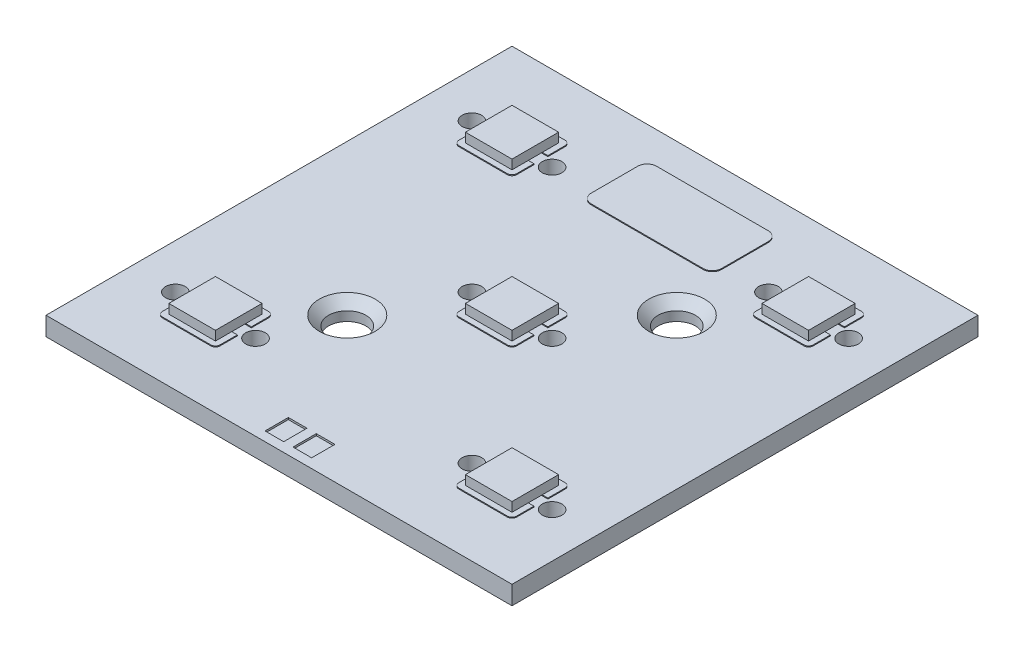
ISO-10303-21;
HEADER;
FILE_DESCRIPTION(('STEP AP214'),'2;1');
FILE_NAME('part.step','',(''),(''),'','','');
FILE_SCHEMA(('AUTOMOTIVE_DESIGN { 1 0 10303 214 1 1 1 1 }'));
ENDSEC;
DATA;
#1=APPLICATION_CONTEXT('core data for automotive mechanical design processes');
#2=APPLICATION_PROTOCOL_DEFINITION('international standard','automotive_design',2000,#1);
#3=PRODUCT_CONTEXT('',#1,'mechanical');
#4=PRODUCT('Part','Part','',(#3));
#5=PRODUCT_RELATED_PRODUCT_CATEGORY('part','',(#4));
#6=PRODUCT_DEFINITION_FORMATION('','',#4);
#7=PRODUCT_DEFINITION_CONTEXT('part definition',#1,'design');
#8=PRODUCT_DEFINITION('design','',#6,#7);
#9=PRODUCT_DEFINITION_SHAPE('','',#8);
#10=(LENGTH_UNIT() NAMED_UNIT(*) SI_UNIT(.MILLI.,.METRE.));
#11=(NAMED_UNIT(*) PLANE_ANGLE_UNIT() SI_UNIT($,.RADIAN.));
#12=(NAMED_UNIT(*) SI_UNIT($,.STERADIAN.) SOLID_ANGLE_UNIT());
#13=UNCERTAINTY_MEASURE_WITH_UNIT(LENGTH_MEASURE(1.E-05),#10,'distance_accuracy_value','');
#14=(GEOMETRIC_REPRESENTATION_CONTEXT(3) GLOBAL_UNCERTAINTY_ASSIGNED_CONTEXT((#13)) GLOBAL_UNIT_ASSIGNED_CONTEXT((#10,
#11,#12)) REPRESENTATION_CONTEXT('',''));
#15=CARTESIAN_POINT('',(0.,0.,0.));
#16=DIRECTION('',(0.,0.,1.));
#17=DIRECTION('',(1.,0.,0.));
#18=AXIS2_PLACEMENT_3D('',#15,#16,#17);
#19=CARTESIAN_POINT('',(-25.,2.,25.));
#20=DIRECTION('',(0.,1.,0.));
#21=DIRECTION('',(0.,0.,1.));
#22=AXIS2_PLACEMENT_3D('',#19,#20,#21);
#23=PLANE('',#22);
#24=DIRECTION('',(0.,0.,-1.));
#25=VECTOR('',#24,1.);
#26=CARTESIAN_POINT('',(-12.8099025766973,2.,-15.1599025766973));
#27=LINE('',#26,#25);
#28=CARTESIAN_POINT('',(-12.8099025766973,2.,-13.3099025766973));
#29=VERTEX_POINT('',#28);
#30=CARTESIAN_POINT('',(-12.8099025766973,2.,-15.1599025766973));
#31=VERTEX_POINT('',#30);
#32=EDGE_CURVE('E1055',#29,#31,#27,.T.);
#33=ORIENTED_EDGE('',*,*,#32,.F.);
#34=CARTESIAN_POINT('',(-13.3099025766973,2.,-13.3099025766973));
#35=DIRECTION('',(0.,1.,0.));
#36=DIRECTION('',(0.,0.,-1.));
#37=AXIS2_PLACEMENT_3D('',#34,#35,#36);
#38=CIRCLE('',#37,0.5);
#39=CARTESIAN_POINT('',(-13.3099025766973,2.,-12.8099025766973));
#40=VERTEX_POINT('',#39);
#41=EDGE_CURVE('E1052',#40,#29,#38,.T.);
#42=ORIENTED_EDGE('',*,*,#41,.F.);
#43=DIRECTION('',(1.,0.,0.));
#44=VECTOR('',#43,1.);
#45=CARTESIAN_POINT('',(-13.3099025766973,2.,-12.8099025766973));
#46=LINE('',#45,#44);
#47=CARTESIAN_POINT('',(-18.5099025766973,2.,-12.8099025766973));
#48=VERTEX_POINT('',#47);
#49=EDGE_CURVE('E1038',#48,#40,#46,.T.);
#50=ORIENTED_EDGE('',*,*,#49,.F.);
#51=CARTESIAN_POINT('',(-18.5099025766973,2.,-13.3099025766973));
#52=DIRECTION('',(0.,1.,0.));
#53=DIRECTION('',(0.,0.,-1.));
#54=AXIS2_PLACEMENT_3D('',#51,#52,#53);
#55=CIRCLE('',#54,0.5);
#56=CARTESIAN_POINT('',(-19.0099025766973,2.,-13.3099025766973));
#57=VERTEX_POINT('',#56);
#58=EDGE_CURVE('E1061',#57,#48,#55,.T.);
#59=ORIENTED_EDGE('',*,*,#58,.F.);
#60=DIRECTION('',(0.,0.,1.));
#61=VECTOR('',#60,1.);
#62=CARTESIAN_POINT('',(-19.0099025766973,2.,-15.1599025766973));
#63=LINE('',#62,#61);
#64=CARTESIAN_POINT('',(-19.0099025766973,2.,-15.1599025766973));
#65=VERTEX_POINT('',#64);
#66=EDGE_CURVE('E1059',#65,#57,#63,.T.);
#67=ORIENTED_EDGE('',*,*,#66,.F.);
#68=DIRECTION('',(-1.,0.,0.));
#69=VECTOR('',#68,1.);
#70=CARTESIAN_POINT('',(-12.8099025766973,2.,-15.1599025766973));
#71=LINE('',#70,#69);
#72=EDGE_CURVE('E1057',#31,#65,#71,.T.);
#73=ORIENTED_EDGE('',*,*,#72,.F.);
#74=EDGE_LOOP('',(#33,#42,#50,#59,#67,#73));
#75=FACE_BOUND('',#74,.T.);
#76=DIRECTION('',(0.,0.,-1.));
#77=VECTOR('',#76,1.);
#78=CARTESIAN_POINT('',(19.009880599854,2.,-15.1599025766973));
#79=LINE('',#78,#77);
#80=CARTESIAN_POINT('',(19.009880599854,2.,-13.3099025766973));
#81=VERTEX_POINT('',#80);
#82=CARTESIAN_POINT('',(19.009880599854,2.,-15.1599025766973));
#83=VERTEX_POINT('',#82);
#84=EDGE_CURVE('E1145',#81,#83,#79,.T.);
#85=ORIENTED_EDGE('',*,*,#84,.F.);
#86=CARTESIAN_POINT('',(18.509880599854,2.,-13.3099025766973));
#87=DIRECTION('',(0.,1.,0.));
#88=DIRECTION('',(0.,0.,-1.));
#89=AXIS2_PLACEMENT_3D('',#86,#87,#88);
#90=CIRCLE('',#89,0.5);
#91=CARTESIAN_POINT('',(18.509880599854,2.,-12.8099025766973));
#92=VERTEX_POINT('',#91);
#93=EDGE_CURVE('E1125',#92,#81,#90,.T.);
#94=ORIENTED_EDGE('',*,*,#93,.F.);
#95=DIRECTION('',(1.,0.,0.));
#96=VECTOR('',#95,1.);
#97=CARTESIAN_POINT('',(18.509880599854,2.,-12.8099025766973));
#98=LINE('',#97,#96);
#99=CARTESIAN_POINT('',(13.3099245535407,2.,-12.8099025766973));
#100=VERTEX_POINT('',#99);
#101=EDGE_CURVE('E1130',#100,#92,#98,.T.);
#102=ORIENTED_EDGE('',*,*,#101,.F.);
#103=CARTESIAN_POINT('',(13.3099245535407,2.,-13.3099025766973));
#104=DIRECTION('',(0.,1.,0.));
#105=DIRECTION('',(0.,0.,-1.));
#106=AXIS2_PLACEMENT_3D('',#103,#104,#105);
#107=CIRCLE('',#106,0.5);
#108=CARTESIAN_POINT('',(12.8099245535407,2.,-13.3099025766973));
#109=VERTEX_POINT('',#108);
#110=EDGE_CURVE('E1151',#109,#100,#107,.T.);
#111=ORIENTED_EDGE('',*,*,#110,.F.);
#112=DIRECTION('',(0.,0.,1.));
#113=VECTOR('',#112,1.);
#114=CARTESIAN_POINT('',(12.8099245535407,2.,-15.1599025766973));
#115=LINE('',#114,#113);
#116=CARTESIAN_POINT('',(12.8099245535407,2.,-15.1599025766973));
#117=VERTEX_POINT('',#116);
#118=EDGE_CURVE('E1149',#117,#109,#115,.T.);
#119=ORIENTED_EDGE('',*,*,#118,.F.);
#120=DIRECTION('',(-1.,0.,0.));
#121=VECTOR('',#120,1.);
#122=CARTESIAN_POINT('',(12.8099245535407,2.,-15.1599025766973));
#123=LINE('',#122,#121);
#124=EDGE_CURVE('E1147',#83,#117,#123,.T.);
#125=ORIENTED_EDGE('',*,*,#124,.F.);
#126=EDGE_LOOP('',(#85,#94,#102,#111,#119,#125));
#127=FACE_BOUND('',#126,.T.);
#128=DIRECTION('',(0.,0.,1.));
#129=VECTOR('',#128,1.);
#130=CARTESIAN_POINT('',(-3.09997802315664,2.,-2.6));
#131=LINE('',#130,#129);
#132=CARTESIAN_POINT('',(-3.09997802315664,2.,-2.6));
#133=VERTEX_POINT('',#132);
#134=CARTESIAN_POINT('',(-3.09997802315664,2.,-0.75));
#135=VERTEX_POINT('',#134);
#136=EDGE_CURVE('E1236',#133,#135,#131,.T.);
#137=ORIENTED_EDGE('',*,*,#136,.F.);
#138=CARTESIAN_POINT('',(-2.59997802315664,2.,-2.6));
#139=DIRECTION('',(0.,1.,0.));
#140=DIRECTION('',(0.,0.,1.));
#141=AXIS2_PLACEMENT_3D('',#138,#139,#140);
#142=CIRCLE('',#141,0.5);
#143=CARTESIAN_POINT('',(-2.59997802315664,2.,-3.1));
#144=VERTEX_POINT('',#143);
#145=EDGE_CURVE('E1215',#144,#133,#142,.T.);
#146=ORIENTED_EDGE('',*,*,#145,.F.);
#147=DIRECTION('',(-1.,0.,0.));
#148=VECTOR('',#147,1.);
#149=CARTESIAN_POINT('',(2.59997802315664,2.,-3.1));
#150=LINE('',#149,#148);
#151=CARTESIAN_POINT('',(2.59997802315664,2.,-3.1));
#152=VERTEX_POINT('',#151);
#153=EDGE_CURVE('E1220',#152,#144,#150,.T.);
#154=ORIENTED_EDGE('',*,*,#153,.F.);
#155=CARTESIAN_POINT('',(2.59997802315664,2.,-2.6));
#156=DIRECTION('',(0.,1.,0.));
#157=DIRECTION('',(0.,0.,-1.));
#158=AXIS2_PLACEMENT_3D('',#155,#156,#157);
#159=CIRCLE('',#158,0.5);
#160=CARTESIAN_POINT('',(3.09997802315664,2.,-2.6));
#161=VERTEX_POINT('',#160);
#162=EDGE_CURVE('E1242',#161,#152,#159,.T.);
#163=ORIENTED_EDGE('',*,*,#162,.F.);
#164=DIRECTION('',(0.,0.,-1.));
#165=VECTOR('',#164,1.);
#166=CARTESIAN_POINT('',(3.09997802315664,2.,-2.6));
#167=LINE('',#166,#165);
#168=CARTESIAN_POINT('',(3.09997802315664,2.,-0.75));
#169=VERTEX_POINT('',#168);
#170=EDGE_CURVE('E1240',#169,#161,#167,.T.);
#171=ORIENTED_EDGE('',*,*,#170,.F.);
#172=DIRECTION('',(1.,0.,0.));
#173=VECTOR('',#172,1.);
#174=CARTESIAN_POINT('',(-3.09997802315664,2.,-0.75));
#175=LINE('',#174,#173);
#176=EDGE_CURVE('E1238',#135,#169,#175,.T.);
#177=ORIENTED_EDGE('',*,*,#176,.F.);
#178=EDGE_LOOP('',(#137,#146,#154,#163,#171,#177));
#179=FACE_BOUND('',#178,.T.);
#180=DIRECTION('',(1.,0.,0.));
#181=VECTOR('',#180,1.);
#182=CARTESIAN_POINT('',(-13.3099025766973,2.,19.0099025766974));
#183=LINE('',#182,#181);
#184=CARTESIAN_POINT('',(-18.5099025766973,2.,19.0099025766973));
#185=VERTEX_POINT('',#184);
#186=CARTESIAN_POINT('',(-13.3099025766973,2.,19.0099025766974));
#187=VERTEX_POINT('',#186);
#188=EDGE_CURVE('E1327',#185,#187,#183,.T.);
#189=ORIENTED_EDGE('',*,*,#188,.F.);
#190=CARTESIAN_POINT('',(-18.5099025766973,2.,18.5099025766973));
#191=DIRECTION('',(0.,1.,0.));
#192=DIRECTION('',(0.,0.,-1.));
#193=AXIS2_PLACEMENT_3D('',#190,#191,#192);
#194=CIRCLE('',#193,0.5);
#195=CARTESIAN_POINT('',(-19.0099025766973,2.,18.5099025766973));
#196=VERTEX_POINT('',#195);
#197=EDGE_CURVE('E1306',#196,#185,#194,.T.);
#198=ORIENTED_EDGE('',*,*,#197,.F.);
#199=DIRECTION('',(0.,0.,1.));
#200=VECTOR('',#199,1.);
#201=CARTESIAN_POINT('',(-19.0099025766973,2.,16.6599025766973));
#202=LINE('',#201,#200);
#203=CARTESIAN_POINT('',(-19.0099025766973,2.,16.6599025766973));
#204=VERTEX_POINT('',#203);
#205=EDGE_CURVE('E1311',#204,#196,#202,.T.);
#206=ORIENTED_EDGE('',*,*,#205,.F.);
#207=DIRECTION('',(-1.,0.,0.));
#208=VECTOR('',#207,1.);
#209=CARTESIAN_POINT('',(-19.0099025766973,2.,16.6599025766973));
#210=LINE('',#209,#208);
#211=CARTESIAN_POINT('',(-12.8099025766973,2.,16.6599025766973));
#212=VERTEX_POINT('',#211);
#213=EDGE_CURVE('E1333',#212,#204,#210,.T.);
#214=ORIENTED_EDGE('',*,*,#213,.F.);
#215=DIRECTION('',(0.,0.,-1.));
#216=VECTOR('',#215,1.);
#217=CARTESIAN_POINT('',(-12.8099025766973,2.,16.6599025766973));
#218=LINE('',#217,#216);
#219=CARTESIAN_POINT('',(-12.8099025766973,2.,18.5099025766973));
#220=VERTEX_POINT('',#219);
#221=EDGE_CURVE('E1331',#220,#212,#218,.T.);
#222=ORIENTED_EDGE('',*,*,#221,.F.);
#223=CARTESIAN_POINT('',(-13.3099025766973,2.,18.5099025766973));
#224=DIRECTION('',(0.,1.,0.));
#225=DIRECTION('',(0.,0.,-1.));
#226=AXIS2_PLACEMENT_3D('',#223,#224,#225);
#227=CIRCLE('',#226,0.5);
#228=EDGE_CURVE('E1329',#187,#220,#227,.T.);
#229=ORIENTED_EDGE('',*,*,#228,.F.);
#230=EDGE_LOOP('',(#189,#198,#206,#214,#222,#229));
#231=FACE_BOUND('',#230,.T.);
#232=DIRECTION('',(-1.,0.,0.));
#233=VECTOR('',#232,1.);
#234=CARTESIAN_POINT('',(18.509880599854,2.,12.8099025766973));
#235=LINE('',#234,#233);
#236=CARTESIAN_POINT('',(18.509880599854,2.,12.8099025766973));
#237=VERTEX_POINT('',#236);
#238=CARTESIAN_POINT('',(13.3099245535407,2.,12.8099025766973));
#239=VERTEX_POINT('',#238);
#240=EDGE_CURVE('E1417',#237,#239,#235,.T.);
#241=ORIENTED_EDGE('',*,*,#240,.F.);
#242=CARTESIAN_POINT('',(18.509880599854,2.,13.3099025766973));
#243=DIRECTION('',(0.,1.,0.));
#244=DIRECTION('',(0.,0.,-1.));
#245=AXIS2_PLACEMENT_3D('',#242,#243,#244);
#246=CIRCLE('',#245,0.5);
#247=CARTESIAN_POINT('',(19.009880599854,2.,13.3099025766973));
#248=VERTEX_POINT('',#247);
#249=EDGE_CURVE('E1396',#248,#237,#246,.T.);
#250=ORIENTED_EDGE('',*,*,#249,.F.);
#251=DIRECTION('',(0.,0.,-1.));
#252=VECTOR('',#251,1.);
#253=CARTESIAN_POINT('',(19.009880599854,2.,13.3099025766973));
#254=LINE('',#253,#252);
#255=CARTESIAN_POINT('',(19.009880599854,2.,15.1599025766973));
#256=VERTEX_POINT('',#255);
#257=EDGE_CURVE('E1401',#256,#248,#254,.T.);
#258=ORIENTED_EDGE('',*,*,#257,.F.);
#259=DIRECTION('',(1.,0.,0.));
#260=VECTOR('',#259,1.);
#261=CARTESIAN_POINT('',(12.8099245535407,2.,15.1599025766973));
#262=LINE('',#261,#260);
#263=CARTESIAN_POINT('',(12.8099245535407,2.,15.1599025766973));
#264=VERTEX_POINT('',#263);
#265=EDGE_CURVE('E1423',#264,#256,#262,.T.);
#266=ORIENTED_EDGE('',*,*,#265,.F.);
#267=DIRECTION('',(0.,0.,1.));
#268=VECTOR('',#267,1.);
#269=CARTESIAN_POINT('',(12.8099245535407,2.,13.3099025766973));
#270=LINE('',#269,#268);
#271=CARTESIAN_POINT('',(12.8099245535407,2.,13.3099025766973));
#272=VERTEX_POINT('',#271);
#273=EDGE_CURVE('E1421',#272,#264,#270,.T.);
#274=ORIENTED_EDGE('',*,*,#273,.F.);
#275=CARTESIAN_POINT('',(13.3099245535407,2.,13.3099025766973));
#276=DIRECTION('',(0.,1.,0.));
#277=DIRECTION('',(0.,0.,1.));
#278=AXIS2_PLACEMENT_3D('',#275,#276,#277);
#279=CIRCLE('',#278,0.5);
#280=EDGE_CURVE('E1419',#239,#272,#279,.T.);
#281=ORIENTED_EDGE('',*,*,#280,.F.);
#282=EDGE_LOOP('',(#241,#250,#258,#266,#274,#281));
#283=FACE_BOUND('',#282,.T.);
#284=DIRECTION('',(0.,0.,1.));
#285=VECTOR('',#284,1.);
#286=CARTESIAN_POINT('',(-25.,2.,-25.));
#287=LINE('',#286,#285);
#288=CARTESIAN_POINT('',(-25.,2.,-25.));
#289=VERTEX_POINT('',#288);
#290=CARTESIAN_POINT('',(-25.,2.,25.));
#291=VERTEX_POINT('',#290);
#292=EDGE_CURVE('E1494',#289,#291,#287,.T.);
#293=ORIENTED_EDGE('',*,*,#292,.T.);
#294=DIRECTION('',(1.,0.,0.));
#295=VECTOR('',#294,1.);
#296=CARTESIAN_POINT('',(-25.,2.,25.));
#297=LINE('',#296,#295);
#298=CARTESIAN_POINT('',(25.,2.,25.));
#299=VERTEX_POINT('',#298);
#300=EDGE_CURVE('E1497',#291,#299,#297,.T.);
#301=ORIENTED_EDGE('',*,*,#300,.T.);
#302=DIRECTION('',(0.,0.,-1.));
#303=VECTOR('',#302,1.);
#304=CARTESIAN_POINT('',(25.,2.,-25.));
#305=LINE('',#304,#303);
#306=CARTESIAN_POINT('',(25.,2.,-25.));
#307=VERTEX_POINT('',#306);
#308=EDGE_CURVE('E1500',#299,#307,#305,.T.);
#309=ORIENTED_EDGE('',*,*,#308,.T.);
#310=DIRECTION('',(-1.,0.,0.));
#311=VECTOR('',#310,1.);
#312=CARTESIAN_POINT('',(-25.,2.,-25.));
#313=LINE('',#312,#311);
#314=EDGE_CURVE('E1502',#307,#289,#313,.T.);
#315=ORIENTED_EDGE('',*,*,#314,.T.);
#316=EDGE_LOOP('',(#293,#301,#309,#315));
#317=FACE_BOUND('',#316,.T.);
#318=CARTESIAN_POINT('',(-8.83883476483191,2.,8.83883476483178));
#319=DIRECTION('',(0.,1.,0.));
#320=DIRECTION('',(0.,0.,1.));
#321=AXIS2_PLACEMENT_3D('',#318,#319,#320);
#322=CIRCLE('',#321,3.);
#323=CARTESIAN_POINT('',(-8.83883476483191,2.,11.8388347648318));
#324=VERTEX_POINT('',#323);
#325=EDGE_CURVE('E1526',#324,#324,#322,.F.);
#326=ORIENTED_EDGE('',*,*,#325,.T.);
#327=EDGE_LOOP('',(#326));
#328=FACE_BOUND('',#327,.T.);
#329=CARTESIAN_POINT('',(8.83883476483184,2.,-8.83883476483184));
#330=DIRECTION('',(0.,1.,0.));
#331=DIRECTION('',(0.,0.,1.));
#332=AXIS2_PLACEMENT_3D('',#329,#330,#331);
#333=CIRCLE('',#332,3.);
#334=CARTESIAN_POINT('',(8.83883476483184,2.,-5.83883476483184));
#335=VERTEX_POINT('',#334);
#336=EDGE_CURVE('E1528',#335,#335,#333,.F.);
#337=ORIENTED_EDGE('',*,*,#336,.T.);
#338=EDGE_LOOP('',(#337));
#339=FACE_BOUND('',#338,.T.);
#340=DIRECTION('',(1.,0.,0.));
#341=VECTOR('',#340,1.);
#342=CARTESIAN_POINT('',(18.509880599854,2.,19.0099025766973));
#343=LINE('',#342,#341);
#344=CARTESIAN_POINT('',(13.3099245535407,2.,19.0099025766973));
#345=VERTEX_POINT('',#344);
#346=CARTESIAN_POINT('',(18.509880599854,2.,19.0099025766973));
#347=VERTEX_POINT('',#346);
#348=EDGE_CURVE('E1462',#345,#347,#343,.T.);
#349=ORIENTED_EDGE('',*,*,#348,.F.);
#350=CARTESIAN_POINT('',(13.3099245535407,2.,18.5099025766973));
#351=DIRECTION('',(0.,1.,0.));
#352=DIRECTION('',(0.,0.,-1.));
#353=AXIS2_PLACEMENT_3D('',#350,#351,#352);
#354=CIRCLE('',#353,0.5);
#355=CARTESIAN_POINT('',(12.8099245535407,2.,18.5099025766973));
#356=VERTEX_POINT('',#355);
#357=EDGE_CURVE('E1442',#356,#345,#354,.T.);
#358=ORIENTED_EDGE('',*,*,#357,.F.);
#359=DIRECTION('',(0.,0.,1.));
#360=VECTOR('',#359,1.);
#361=CARTESIAN_POINT('',(12.8099245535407,2.,16.6599025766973));
#362=LINE('',#361,#360);
#363=CARTESIAN_POINT('',(12.8099245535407,2.,16.6599025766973));
#364=VERTEX_POINT('',#363);
#365=EDGE_CURVE('E1447',#364,#356,#362,.T.);
#366=ORIENTED_EDGE('',*,*,#365,.F.);
#367=DIRECTION('',(-1.,0.,0.));
#368=VECTOR('',#367,1.);
#369=CARTESIAN_POINT('',(12.8099245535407,2.,16.6599025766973));
#370=LINE('',#369,#368);
#371=CARTESIAN_POINT('',(19.009880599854,2.,16.6599025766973));
#372=VERTEX_POINT('',#371);
#373=EDGE_CURVE('E1468',#372,#364,#370,.T.);
#374=ORIENTED_EDGE('',*,*,#373,.F.);
#375=DIRECTION('',(0.,0.,-1.));
#376=VECTOR('',#375,1.);
#377=CARTESIAN_POINT('',(19.009880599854,2.,16.6599025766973));
#378=LINE('',#377,#376);
#379=CARTESIAN_POINT('',(19.009880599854,2.,18.5099025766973));
#380=VERTEX_POINT('',#379);
#381=EDGE_CURVE('E1466',#380,#372,#378,.T.);
#382=ORIENTED_EDGE('',*,*,#381,.F.);
#383=CARTESIAN_POINT('',(18.509880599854,2.,18.5099025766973));
#384=DIRECTION('',(0.,1.,0.));
#385=DIRECTION('',(0.,0.,-1.));
#386=AXIS2_PLACEMENT_3D('',#383,#384,#385);
#387=CIRCLE('',#386,0.5);
#388=EDGE_CURVE('E1464',#347,#380,#387,.T.);
#389=ORIENTED_EDGE('',*,*,#388,.F.);
#390=EDGE_LOOP('',(#349,#358,#366,#374,#382,#389));
#391=FACE_BOUND('',#390,.T.);
#392=DIRECTION('',(0.,0.,1.));
#393=VECTOR('',#392,1.);
#394=CARTESIAN_POINT('',(-19.0099025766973,2.,13.3099025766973));
#395=LINE('',#394,#393);
#396=CARTESIAN_POINT('',(-19.0099025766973,2.,13.3099025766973));
#397=VERTEX_POINT('',#396);
#398=CARTESIAN_POINT('',(-19.0099025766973,2.,15.1599025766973));
#399=VERTEX_POINT('',#398);
#400=EDGE_CURVE('E1371',#397,#399,#395,.T.);
#401=ORIENTED_EDGE('',*,*,#400,.F.);
#402=CARTESIAN_POINT('',(-18.5099025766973,2.,13.3099025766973));
#403=DIRECTION('',(0.,1.,0.));
#404=DIRECTION('',(0.,0.,1.));
#405=AXIS2_PLACEMENT_3D('',#402,#403,#404);
#406=CIRCLE('',#405,0.5);
#407=CARTESIAN_POINT('',(-18.5099025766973,2.,12.8099025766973));
#408=VERTEX_POINT('',#407);
#409=EDGE_CURVE('E1352',#408,#397,#406,.T.);
#410=ORIENTED_EDGE('',*,*,#409,.F.);
#411=DIRECTION('',(-1.,0.,0.));
#412=VECTOR('',#411,1.);
#413=CARTESIAN_POINT('',(-13.3099025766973,2.,12.8099025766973));
#414=LINE('',#413,#412);
#415=CARTESIAN_POINT('',(-13.3099025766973,2.,12.8099025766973));
#416=VERTEX_POINT('',#415);
#417=EDGE_CURVE('E1357',#416,#408,#414,.T.);
#418=ORIENTED_EDGE('',*,*,#417,.F.);
#419=CARTESIAN_POINT('',(-13.3099025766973,2.,13.3099025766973));
#420=DIRECTION('',(0.,1.,0.));
#421=DIRECTION('',(0.,0.,-1.));
#422=AXIS2_PLACEMENT_3D('',#419,#420,#421);
#423=CIRCLE('',#422,0.5);
#424=CARTESIAN_POINT('',(-12.8099025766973,2.,13.3099025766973));
#425=VERTEX_POINT('',#424);
#426=EDGE_CURVE('E1377',#425,#416,#423,.T.);
#427=ORIENTED_EDGE('',*,*,#426,.F.);
#428=DIRECTION('',(0.,0.,-1.));
#429=VECTOR('',#428,1.);
#430=CARTESIAN_POINT('',(-12.8099025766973,2.,13.3099025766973));
#431=LINE('',#430,#429);
#432=CARTESIAN_POINT('',(-12.8099025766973,2.,15.1599025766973));
#433=VERTEX_POINT('',#432);
#434=EDGE_CURVE('E1375',#433,#425,#431,.T.);
#435=ORIENTED_EDGE('',*,*,#434,.F.);
#436=DIRECTION('',(1.,0.,0.));
#437=VECTOR('',#436,1.);
#438=CARTESIAN_POINT('',(-12.8099025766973,2.,15.1599025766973));
#439=LINE('',#438,#437);
#440=EDGE_CURVE('E1373',#399,#433,#439,.T.);
#441=ORIENTED_EDGE('',*,*,#440,.F.);
#442=EDGE_LOOP('',(#401,#410,#418,#427,#435,#441));
#443=FACE_BOUND('',#442,.T.);
#444=DIRECTION('',(0.,0.,-1.));
#445=VECTOR('',#444,1.);
#446=CARTESIAN_POINT('',(3.09997802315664,2.,0.75));
#447=LINE('',#446,#445);
#448=CARTESIAN_POINT('',(3.09997802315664,2.,2.6));
#449=VERTEX_POINT('',#448);
#450=CARTESIAN_POINT('',(3.09997802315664,2.,0.75));
#451=VERTEX_POINT('',#450);
#452=EDGE_CURVE('E1281',#449,#451,#447,.T.);
#453=ORIENTED_EDGE('',*,*,#452,.F.);
#454=CARTESIAN_POINT('',(2.59997802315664,2.,2.6));
#455=DIRECTION('',(0.,1.,0.));
#456=DIRECTION('',(0.,0.,-1.));
#457=AXIS2_PLACEMENT_3D('',#454,#455,#456);
#458=CIRCLE('',#457,0.5);
#459=CARTESIAN_POINT('',(2.59997802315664,2.,3.1));
#460=VERTEX_POINT('',#459);
#461=EDGE_CURVE('E1261',#460,#449,#458,.T.);
#462=ORIENTED_EDGE('',*,*,#461,.F.);
#463=DIRECTION('',(1.,0.,0.));
#464=VECTOR('',#463,1.);
#465=CARTESIAN_POINT('',(2.59997802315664,2.,3.1));
#466=LINE('',#465,#464);
#467=CARTESIAN_POINT('',(-2.59997802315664,2.,3.1));
#468=VERTEX_POINT('',#467);
#469=EDGE_CURVE('E1266',#468,#460,#466,.T.);
#470=ORIENTED_EDGE('',*,*,#469,.F.);
#471=CARTESIAN_POINT('',(-2.59997802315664,2.,2.6));
#472=DIRECTION('',(0.,1.,0.));
#473=DIRECTION('',(0.,0.,-1.));
#474=AXIS2_PLACEMENT_3D('',#471,#472,#473);
#475=CIRCLE('',#474,0.5);
#476=CARTESIAN_POINT('',(-3.09997802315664,2.,2.6));
#477=VERTEX_POINT('',#476);
#478=EDGE_CURVE('E1287',#477,#468,#475,.T.);
#479=ORIENTED_EDGE('',*,*,#478,.F.);
#480=DIRECTION('',(0.,0.,1.));
#481=VECTOR('',#480,1.);
#482=CARTESIAN_POINT('',(-3.09997802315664,2.,0.75));
#483=LINE('',#482,#481);
#484=CARTESIAN_POINT('',(-3.09997802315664,2.,0.75));
#485=VERTEX_POINT('',#484);
#486=EDGE_CURVE('E1285',#485,#477,#483,.T.);
#487=ORIENTED_EDGE('',*,*,#486,.F.);
#488=DIRECTION('',(-1.,0.,0.));
#489=VECTOR('',#488,1.);
#490=CARTESIAN_POINT('',(-3.09997802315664,2.,0.75));
#491=LINE('',#490,#489);
#492=EDGE_CURVE('E1283',#451,#485,#491,.T.);
#493=ORIENTED_EDGE('',*,*,#492,.F.);
#494=EDGE_LOOP('',(#453,#462,#470,#479,#487,#493));
#495=FACE_BOUND('',#494,.T.);
#496=DIRECTION('',(-1.,0.,0.));
#497=VECTOR('',#496,1.);
#498=CARTESIAN_POINT('',(18.509880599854,2.,-19.0099025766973));
#499=LINE('',#498,#497);
#500=CARTESIAN_POINT('',(18.509880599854,2.,-19.0099025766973));
#501=VERTEX_POINT('',#500);
#502=CARTESIAN_POINT('',(13.3099245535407,2.,-19.0099025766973));
#503=VERTEX_POINT('',#502);
#504=EDGE_CURVE('E1190',#501,#503,#499,.T.);
#505=ORIENTED_EDGE('',*,*,#504,.F.);
#506=CARTESIAN_POINT('',(18.509880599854,2.,-18.5099025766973));
#507=DIRECTION('',(0.,1.,0.));
#508=DIRECTION('',(0.,0.,-1.));
#509=AXIS2_PLACEMENT_3D('',#506,#507,#508);
#510=CIRCLE('',#509,0.5);
#511=CARTESIAN_POINT('',(19.009880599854,2.,-18.5099025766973));
#512=VERTEX_POINT('',#511);
#513=EDGE_CURVE('E1170',#512,#501,#510,.T.);
#514=ORIENTED_EDGE('',*,*,#513,.F.);
#515=DIRECTION('',(0.,0.,-1.));
#516=VECTOR('',#515,1.);
#517=CARTESIAN_POINT('',(19.009880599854,2.,-18.5099025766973));
#518=LINE('',#517,#516);
#519=CARTESIAN_POINT('',(19.009880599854,2.,-16.6599025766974));
#520=VERTEX_POINT('',#519);
#521=EDGE_CURVE('E1175',#520,#512,#518,.T.);
#522=ORIENTED_EDGE('',*,*,#521,.F.);
#523=DIRECTION('',(1.,0.,0.));
#524=VECTOR('',#523,1.);
#525=CARTESIAN_POINT('',(12.8099245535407,2.,-16.6599025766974));
#526=LINE('',#525,#524);
#527=CARTESIAN_POINT('',(12.8099245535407,2.,-16.6599025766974));
#528=VERTEX_POINT('',#527);
#529=EDGE_CURVE('E1196',#528,#520,#526,.T.);
#530=ORIENTED_EDGE('',*,*,#529,.F.);
#531=DIRECTION('',(0.,0.,1.));
#532=VECTOR('',#531,1.);
#533=CARTESIAN_POINT('',(12.8099245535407,2.,-18.5099025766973));
#534=LINE('',#533,#532);
#535=CARTESIAN_POINT('',(12.8099245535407,2.,-18.5099025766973));
#536=VERTEX_POINT('',#535);
#537=EDGE_CURVE('E1194',#536,#528,#534,.T.);
#538=ORIENTED_EDGE('',*,*,#537,.F.);
#539=CARTESIAN_POINT('',(13.3099245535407,2.,-18.5099025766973));
#540=DIRECTION('',(0.,1.,0.));
#541=DIRECTION('',(0.,0.,1.));
#542=AXIS2_PLACEMENT_3D('',#539,#540,#541);
#543=CIRCLE('',#542,0.5);
#544=EDGE_CURVE('E1192',#503,#536,#543,.T.);
#545=ORIENTED_EDGE('',*,*,#544,.F.);
#546=EDGE_LOOP('',(#505,#514,#522,#530,#538,#545));
#547=FACE_BOUND('',#546,.T.);
#548=DIRECTION('',(-1.,0.,0.));
#549=VECTOR('',#548,1.);
#550=CARTESIAN_POINT('',(-13.3099025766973,2.,-19.0099025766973));
#551=LINE('',#550,#549);
#552=CARTESIAN_POINT('',(-13.3099025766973,2.,-19.0099025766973));
#553=VERTEX_POINT('',#552);
#554=CARTESIAN_POINT('',(-18.5099025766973,2.,-19.0099025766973));
#555=VERTEX_POINT('',#554);
#556=EDGE_CURVE('E1100',#553,#555,#551,.T.);
#557=ORIENTED_EDGE('',*,*,#556,.F.);
#558=CARTESIAN_POINT('',(-13.3099025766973,2.,-18.5099025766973));
#559=DIRECTION('',(0.,1.,0.));
#560=DIRECTION('',(0.,0.,-1.));
#561=AXIS2_PLACEMENT_3D('',#558,#559,#560);
#562=CIRCLE('',#561,0.5);
#563=CARTESIAN_POINT('',(-12.8099025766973,2.,-18.5099025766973));
#564=VERTEX_POINT('',#563);
#565=EDGE_CURVE('E1080',#564,#553,#562,.T.);
#566=ORIENTED_EDGE('',*,*,#565,.F.);
#567=DIRECTION('',(0.,0.,-1.));
#568=VECTOR('',#567,1.);
#569=CARTESIAN_POINT('',(-12.8099025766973,2.,-18.5099025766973));
#570=LINE('',#569,#568);
#571=CARTESIAN_POINT('',(-12.8099025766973,2.,-16.6599025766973));
#572=VERTEX_POINT('',#571);
#573=EDGE_CURVE('E1085',#572,#564,#570,.T.);
#574=ORIENTED_EDGE('',*,*,#573,.F.);
#575=DIRECTION('',(1.,0.,0.));
#576=VECTOR('',#575,1.);
#577=CARTESIAN_POINT('',(-19.0099025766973,2.,-16.6599025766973));
#578=LINE('',#577,#576);
#579=CARTESIAN_POINT('',(-19.0099025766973,2.,-16.6599025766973));
#580=VERTEX_POINT('',#579);
#581=EDGE_CURVE('E1106',#580,#572,#578,.T.);
#582=ORIENTED_EDGE('',*,*,#581,.F.);
#583=DIRECTION('',(0.,0.,1.));
#584=VECTOR('',#583,1.);
#585=CARTESIAN_POINT('',(-19.0099025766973,2.,-18.5099025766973));
#586=LINE('',#585,#584);
#587=CARTESIAN_POINT('',(-19.0099025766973,2.,-18.5099025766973));
#588=VERTEX_POINT('',#587);
#589=EDGE_CURVE('E1104',#588,#580,#586,.T.);
#590=ORIENTED_EDGE('',*,*,#589,.F.);
#591=CARTESIAN_POINT('',(-18.5099025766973,2.,-18.5099025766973));
#592=DIRECTION('',(0.,1.,0.));
#593=DIRECTION('',(0.,0.,1.));
#594=AXIS2_PLACEMENT_3D('',#591,#592,#593);
#595=CIRCLE('',#594,0.5);
#596=EDGE_CURVE('E1102',#555,#588,#595,.T.);
#597=ORIENTED_EDGE('',*,*,#596,.F.);
#598=EDGE_LOOP('',(#557,#566,#574,#582,#590,#597));
#599=FACE_BOUND('',#598,.T.);
#600=CARTESIAN_POINT('',(20.2099025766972,2.,-15.9099025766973));
#601=DIRECTION('',(0.,1.,0.));
#602=DIRECTION('',(0.,0.,1.));
#603=AXIS2_PLACEMENT_3D('',#600,#601,#602);
#604=CIRCLE('',#603,1.05);
#605=CARTESIAN_POINT('',(20.2099025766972,2.,-14.8599025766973));
#606=VERTEX_POINT('',#605);
#607=EDGE_CURVE('E841',#606,#606,#604,.T.);
#608=ORIENTED_EDGE('',*,*,#607,.F.);
#609=EDGE_LOOP('',(#608));
#610=FACE_BOUND('',#609,.T.);
#611=CARTESIAN_POINT('',(11.6099025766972,2.,-15.9099025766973));
#612=DIRECTION('',(0.,1.,0.));
#613=DIRECTION('',(0.,0.,1.));
#614=AXIS2_PLACEMENT_3D('',#611,#612,#613);
#615=CIRCLE('',#614,1.05);
#616=CARTESIAN_POINT('',(11.6099025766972,2.,-14.8599025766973));
#617=VERTEX_POINT('',#616);
#618=EDGE_CURVE('E835',#617,#617,#615,.T.);
#619=ORIENTED_EDGE('',*,*,#618,.F.);
#620=EDGE_LOOP('',(#619));
#621=FACE_BOUND('',#620,.T.);
#622=CARTESIAN_POINT('',(20.2099025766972,2.,15.9099025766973));
#623=DIRECTION('',(0.,1.,0.));
#624=DIRECTION('',(0.,0.,1.));
#625=AXIS2_PLACEMENT_3D('',#622,#623,#624);
#626=CIRCLE('',#625,1.05);
#627=CARTESIAN_POINT('',(20.2099025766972,2.,16.9599025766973));
#628=VERTEX_POINT('',#627);
#629=EDGE_CURVE('E829',#628,#628,#626,.T.);
#630=ORIENTED_EDGE('',*,*,#629,.F.);
#631=EDGE_LOOP('',(#630));
#632=FACE_BOUND('',#631,.T.);
#633=CARTESIAN_POINT('',(11.6099025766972,2.,15.9099025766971));
#634=DIRECTION('',(0.,1.,0.));
#635=DIRECTION('',(0.,0.,1.));
#636=AXIS2_PLACEMENT_3D('',#633,#634,#635);
#637=CIRCLE('',#636,1.05);
#638=CARTESIAN_POINT('',(11.6099025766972,2.,16.9599025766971));
#639=VERTEX_POINT('',#638);
#640=EDGE_CURVE('E823',#639,#639,#637,.T.);
#641=ORIENTED_EDGE('',*,*,#640,.F.);
#642=EDGE_LOOP('',(#641));
#643=FACE_BOUND('',#642,.T.);
#644=CARTESIAN_POINT('',(-11.6099025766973,2.,15.9099025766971));
#645=DIRECTION('',(0.,1.,0.));
#646=DIRECTION('',(0.,0.,1.));
#647=AXIS2_PLACEMENT_3D('',#644,#645,#646);
#648=CIRCLE('',#647,1.05);
#649=CARTESIAN_POINT('',(-11.6099025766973,2.,16.9599025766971));
#650=VERTEX_POINT('',#649);
#651=EDGE_CURVE('E817',#650,#650,#648,.T.);
#652=ORIENTED_EDGE('',*,*,#651,.F.);
#653=EDGE_LOOP('',(#652));
#654=FACE_BOUND('',#653,.T.);
#655=CARTESIAN_POINT('',(-20.2099025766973,2.,15.9099025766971));
#656=DIRECTION('',(0.,1.,0.));
#657=DIRECTION('',(0.,0.,1.));
#658=AXIS2_PLACEMENT_3D('',#655,#656,#657);
#659=CIRCLE('',#658,1.05);
#660=CARTESIAN_POINT('',(-20.2099025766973,2.,16.9599025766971));
#661=VERTEX_POINT('',#660);
#662=EDGE_CURVE('E811',#661,#661,#659,.T.);
#663=ORIENTED_EDGE('',*,*,#662,.F.);
#664=EDGE_LOOP('',(#663));
#665=FACE_BOUND('',#664,.T.);
#666=CARTESIAN_POINT('',(-20.2099025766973,2.,-15.9099025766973));
#667=DIRECTION('',(0.,1.,0.));
#668=DIRECTION('',(0.,0.,1.));
#669=AXIS2_PLACEMENT_3D('',#666,#667,#668);
#670=CIRCLE('',#669,1.05);
#671=CARTESIAN_POINT('',(-20.2099025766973,2.,-14.8599025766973));
#672=VERTEX_POINT('',#671);
#673=EDGE_CURVE('E805',#672,#672,#670,.T.);
#674=ORIENTED_EDGE('',*,*,#673,.F.);
#675=EDGE_LOOP('',(#674));
#676=FACE_BOUND('',#675,.T.);
#677=CARTESIAN_POINT('',(-11.6099025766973,2.,-15.9099025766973));
#678=DIRECTION('',(0.,1.,0.));
#679=DIRECTION('',(0.,0.,1.));
#680=AXIS2_PLACEMENT_3D('',#677,#678,#679);
#681=CIRCLE('',#680,1.05);
#682=CARTESIAN_POINT('',(-11.6099025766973,2.,-14.8599025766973));
#683=VERTEX_POINT('',#682);
#684=EDGE_CURVE('E799',#683,#683,#681,.T.);
#685=ORIENTED_EDGE('',*,*,#684,.F.);
#686=EDGE_LOOP('',(#685));
#687=FACE_BOUND('',#686,.T.);
#688=CARTESIAN_POINT('',(4.3,2.,0.));
#689=DIRECTION('',(0.,1.,0.));
#690=DIRECTION('',(0.,0.,1.));
#691=AXIS2_PLACEMENT_3D('',#688,#689,#690);
#692=CIRCLE('',#691,1.05);
#693=CARTESIAN_POINT('',(4.3,2.,1.05));
#694=VERTEX_POINT('',#693);
#695=EDGE_CURVE('E793',#694,#694,#692,.T.);
#696=ORIENTED_EDGE('',*,*,#695,.F.);
#697=EDGE_LOOP('',(#696));
#698=FACE_BOUND('',#697,.T.);
#699=CARTESIAN_POINT('',(-4.3,2.,0.));
#700=DIRECTION('',(0.,1.,0.));
#701=DIRECTION('',(0.,0.,1.));
#702=AXIS2_PLACEMENT_3D('',#699,#700,#701);
#703=CIRCLE('',#702,1.05);
#704=CARTESIAN_POINT('',(-4.3,2.,1.05));
#705=VERTEX_POINT('',#704);
#706=EDGE_CURVE('E783',#705,#705,#703,.T.);
#707=ORIENTED_EDGE('',*,*,#706,.F.);
#708=EDGE_LOOP('',(#707));
#709=FACE_BOUND('',#708,.T.);
#710=DIRECTION('',(0.,0.,1.));
#711=VECTOR('',#710,1.);
#712=CARTESIAN_POINT('',(-2.5,2.,21.5));
#713=LINE('',#712,#711);
#714=CARTESIAN_POINT('',(-2.5,2.,21.5));
#715=VERTEX_POINT('',#714);
#716=CARTESIAN_POINT('',(-2.5,2.,24.));
#717=VERTEX_POINT('',#716);
#718=EDGE_CURVE('E752',#715,#717,#713,.T.);
#719=ORIENTED_EDGE('',*,*,#718,.F.);
#720=DIRECTION('',(-1.,0.,0.));
#721=VECTOR('',#720,1.);
#722=CARTESIAN_POINT('',(-2.5,2.,21.5));
#723=LINE('',#722,#721);
#724=CARTESIAN_POINT('',(-0.49999999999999,2.,21.5));
#725=VERTEX_POINT('',#724);
#726=EDGE_CURVE('E762',#725,#715,#723,.T.);
#727=ORIENTED_EDGE('',*,*,#726,.F.);
#728=DIRECTION('',(0.,0.,-1.));
#729=VECTOR('',#728,1.);
#730=CARTESIAN_POINT('',(-0.49999999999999,2.,21.5));
#731=LINE('',#730,#729);
#732=CARTESIAN_POINT('',(-0.49999999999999,2.,24.));
#733=VERTEX_POINT('',#732);
#734=EDGE_CURVE('E776',#733,#725,#731,.T.);
#735=ORIENTED_EDGE('',*,*,#734,.F.);
#736=DIRECTION('',(1.,0.,0.));
#737=VECTOR('',#736,1.);
#738=CARTESIAN_POINT('',(-2.5,2.,24.));
#739=LINE('',#738,#737);
#740=EDGE_CURVE('E773',#717,#733,#739,.T.);
#741=ORIENTED_EDGE('',*,*,#740,.F.);
#742=EDGE_LOOP('',(#719,#727,#735,#741));
#743=FACE_BOUND('',#742,.T.);
#744=DIRECTION('',(0.,0.,1.));
#745=VECTOR('',#744,1.);
#746=CARTESIAN_POINT('',(0.50000000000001,2.,21.5));
#747=LINE('',#746,#745);
#748=CARTESIAN_POINT('',(0.50000000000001,2.,21.5));
#749=VERTEX_POINT('',#748);
#750=CARTESIAN_POINT('',(0.500000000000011,2.,24.));
#751=VERTEX_POINT('',#750);
#752=EDGE_CURVE('E43',#749,#751,#747,.T.);
#753=ORIENTED_EDGE('',*,*,#752,.F.);
#754=DIRECTION('',(-1.,0.,0.));
#755=VECTOR('',#754,1.);
#756=CARTESIAN_POINT('',(0.50000000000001,2.,21.5));
#757=LINE('',#756,#755);
#758=CARTESIAN_POINT('',(2.5,2.,21.5));
#759=VERTEX_POINT('',#758);
#760=EDGE_CURVE('E733',#759,#749,#757,.T.);
#761=ORIENTED_EDGE('',*,*,#760,.F.);
#762=DIRECTION('',(0.,0.,-1.));
#763=VECTOR('',#762,1.);
#764=CARTESIAN_POINT('',(2.5,2.,21.5));
#765=LINE('',#764,#763);
#766=CARTESIAN_POINT('',(2.5,2.,24.));
#767=VERTEX_POINT('',#766);
#768=EDGE_CURVE('E745',#767,#759,#765,.T.);
#769=ORIENTED_EDGE('',*,*,#768,.F.);
#770=DIRECTION('',(1.,0.,0.));
#771=VECTOR('',#770,1.);
#772=CARTESIAN_POINT('',(0.50000000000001,2.,24.));
#773=LINE('',#772,#771);
#774=EDGE_CURVE('E723',#751,#767,#773,.T.);
#775=ORIENTED_EDGE('',*,*,#774,.F.);
#776=EDGE_LOOP('',(#753,#761,#769,#775));
#777=FACE_BOUND('',#776,.T.);
#778=DIRECTION('',(0.,0.,1.));
#779=VECTOR('',#778,1.);
#780=CARTESIAN_POINT('',(-7.,2.,-15.5));
#781=LINE('',#780,#779);
#782=CARTESIAN_POINT('',(-7.,2.,-20.5));
#783=VERTEX_POINT('',#782);
#784=CARTESIAN_POINT('',(-7.,2.,-15.5));
#785=VERTEX_POINT('',#784);
#786=EDGE_CURVE('E1654',#783,#785,#781,.T.);
#787=ORIENTED_EDGE('',*,*,#786,.F.);
#788=CARTESIAN_POINT('',(-6.,2.,-20.5));
#789=DIRECTION('',(0.,1.,0.));
#790=DIRECTION('',(0.,0.,1.));
#791=AXIS2_PLACEMENT_3D('',#788,#789,#790);
#792=CIRCLE('',#791,1.);
#793=CARTESIAN_POINT('',(-6.,2.,-21.5));
#794=VERTEX_POINT('',#793);
#795=EDGE_CURVE('E720',#794,#783,#792,.T.);
#796=ORIENTED_EDGE('',*,*,#795,.F.);
#797=DIRECTION('',(-1.,0.,0.));
#798=VECTOR('',#797,1.);
#799=CARTESIAN_POINT('',(6.,2.,-21.5));
#800=LINE('',#799,#798);
#801=CARTESIAN_POINT('',(6.,2.,-21.5));
#802=VERTEX_POINT('',#801);
#803=EDGE_CURVE('E716',#802,#794,#800,.T.);
#804=ORIENTED_EDGE('',*,*,#803,.F.);
#805=CARTESIAN_POINT('',(6.,2.,-20.5));
#806=DIRECTION('',(0.,1.,0.));
#807=DIRECTION('',(0.,0.,-1.));
#808=AXIS2_PLACEMENT_3D('',#805,#806,#807);
#809=CIRCLE('',#808,1.);
#810=CARTESIAN_POINT('',(7.,2.,-20.5));
#811=VERTEX_POINT('',#810);
#812=EDGE_CURVE('E1669',#811,#802,#809,.T.);
#813=ORIENTED_EDGE('',*,*,#812,.F.);
#814=DIRECTION('',(0.,0.,-1.));
#815=VECTOR('',#814,1.);
#816=CARTESIAN_POINT('',(7.,2.,-20.5));
#817=LINE('',#816,#815);
#818=CARTESIAN_POINT('',(7.,2.,-15.5));
#819=VERTEX_POINT('',#818);
#820=EDGE_CURVE('E1667',#819,#811,#817,.T.);
#821=ORIENTED_EDGE('',*,*,#820,.F.);
#822=CARTESIAN_POINT('',(6.,2.,-15.5));
#823=DIRECTION('',(0.,1.,0.));
#824=DIRECTION('',(0.,0.,-1.));
#825=AXIS2_PLACEMENT_3D('',#822,#823,#824);
#826=CIRCLE('',#825,1.);
#827=CARTESIAN_POINT('',(6.,2.,-14.5));
#828=VERTEX_POINT('',#827);
#829=EDGE_CURVE('E1665',#828,#819,#826,.T.);
#830=ORIENTED_EDGE('',*,*,#829,.F.);
#831=DIRECTION('',(1.,0.,0.));
#832=VECTOR('',#831,1.);
#833=CARTESIAN_POINT('',(6.,2.,-14.5));
#834=LINE('',#833,#832);
#835=CARTESIAN_POINT('',(-6.,2.,-14.5));
#836=VERTEX_POINT('',#835);
#837=EDGE_CURVE('E1659',#836,#828,#834,.T.);
#838=ORIENTED_EDGE('',*,*,#837,.F.);
#839=CARTESIAN_POINT('',(-6.,2.,-15.5));
#840=DIRECTION('',(0.,1.,0.));
#841=DIRECTION('',(0.,0.,-1.));
#842=AXIS2_PLACEMENT_3D('',#839,#840,#841);
#843=CIRCLE('',#842,1.);
#844=EDGE_CURVE('E1657',#785,#836,#843,.T.);
#845=ORIENTED_EDGE('',*,*,#844,.F.);
#846=EDGE_LOOP('',(#787,#796,#804,#813,#821,#830,#838,#845));
#847=FACE_BOUND('',#846,.T.);
#848=ADVANCED_FACE('F16',(#75,#127,#179,#231,#283,#317,#328,#339,#391,#443,#495,#547,#599,#610,
#621,#632,#643,#654,#665,#676,#687,#698,#709,#743,#777,#847),#23,.T.);
#849=CARTESIAN_POINT('',(-18.5099025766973,2.1,18.5099025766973));
#850=DIRECTION('',(0.,-1.,0.));
#851=DIRECTION('',(0.,0.,-1.));
#852=AXIS2_PLACEMENT_3D('',#849,#850,#851);
#853=PLANE('',#852);
#854=DIRECTION('',(0.,0.,-1.));
#855=VECTOR('',#854,1.);
#856=CARTESIAN_POINT('',(-13.4099025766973,2.1,18.4099025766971));
#857=LINE('',#856,#855);
#858=CARTESIAN_POINT('',(-13.4099025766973,2.1,18.4099025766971));
#859=VERTEX_POINT('',#858);
#860=CARTESIAN_POINT('',(-13.4099025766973,2.1,16.6599025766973));
#861=VERTEX_POINT('',#860);
#862=EDGE_CURVE('E854',#859,#861,#857,.T.);
#863=ORIENTED_EDGE('',*,*,#862,.F.);
#864=DIRECTION('',(1.,0.,0.));
#865=VECTOR('',#864,1.);
#866=CARTESIAN_POINT('',(-18.4099025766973,2.1,18.4099025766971));
#867=LINE('',#866,#865);
#868=CARTESIAN_POINT('',(-18.4099025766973,2.1,18.4099025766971));
#869=VERTEX_POINT('',#868);
#870=EDGE_CURVE('E864',#869,#859,#867,.T.);
#871=ORIENTED_EDGE('',*,*,#870,.F.);
#872=DIRECTION('',(0.,0.,1.));
#873=VECTOR('',#872,1.);
#874=CARTESIAN_POINT('',(-18.4099025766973,2.1,18.4099025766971));
#875=LINE('',#874,#873);
#876=CARTESIAN_POINT('',(-18.4099025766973,2.1,16.6599025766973));
#877=VERTEX_POINT('',#876);
#878=EDGE_CURVE('E11',#877,#869,#875,.T.);
#879=ORIENTED_EDGE('',*,*,#878,.F.);
#880=DIRECTION('',(-1.,0.,0.));
#881=VECTOR('',#880,1.);
#882=CARTESIAN_POINT('',(-19.0099025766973,2.1,16.6599025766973));
#883=LINE('',#882,#881);
#884=CARTESIAN_POINT('',(-19.0099025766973,2.1,16.6599025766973));
#885=VERTEX_POINT('',#884);
#886=EDGE_CURVE('E1317',#877,#885,#883,.T.);
#887=ORIENTED_EDGE('',*,*,#886,.T.);
#888=DIRECTION('',(0.,0.,1.));
#889=VECTOR('',#888,1.);
#890=CARTESIAN_POINT('',(-19.0099025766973,2.1,16.6599025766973));
#891=LINE('',#890,#889);
#892=CARTESIAN_POINT('',(-19.0099025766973,2.1,18.5099025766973));
#893=VERTEX_POINT('',#892);
#894=EDGE_CURVE('E1321',#885,#893,#891,.T.);
#895=ORIENTED_EDGE('',*,*,#894,.T.);
#896=CARTESIAN_POINT('',(-18.5099025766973,2.1,18.5099025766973));
#897=DIRECTION('',(0.,1.,0.));
#898=DIRECTION('',(0.,0.,-1.));
#899=AXIS2_PLACEMENT_3D('',#896,#897,#898);
#900=CIRCLE('',#899,0.5);
#901=CARTESIAN_POINT('',(-18.5099025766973,2.1,19.0099025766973));
#902=VERTEX_POINT('',#901);
#903=EDGE_CURVE('E1307',#893,#902,#900,.T.);
#904=ORIENTED_EDGE('',*,*,#903,.T.);
#905=DIRECTION('',(1.,0.,0.));
#906=VECTOR('',#905,1.);
#907=CARTESIAN_POINT('',(-13.3099025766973,2.1,19.0099025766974));
#908=LINE('',#907,#906);
#909=CARTESIAN_POINT('',(-13.3099025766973,2.1,19.0099025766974));
#910=VERTEX_POINT('',#909);
#911=EDGE_CURVE('E1310',#902,#910,#908,.T.);
#912=ORIENTED_EDGE('',*,*,#911,.T.);
#913=CARTESIAN_POINT('',(-13.3099025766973,2.1,18.5099025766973));
#914=DIRECTION('',(0.,1.,0.));
#915=DIRECTION('',(0.,0.,-1.));
#916=AXIS2_PLACEMENT_3D('',#913,#914,#915);
#917=CIRCLE('',#916,0.5);
#918=CARTESIAN_POINT('',(-12.8099025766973,2.1,18.5099025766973));
#919=VERTEX_POINT('',#918);
#920=EDGE_CURVE('E1313',#910,#919,#917,.T.);
#921=ORIENTED_EDGE('',*,*,#920,.T.);
#922=DIRECTION('',(0.,0.,-1.));
#923=VECTOR('',#922,1.);
#924=CARTESIAN_POINT('',(-12.8099025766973,2.1,16.6599025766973));
#925=LINE('',#924,#923);
#926=CARTESIAN_POINT('',(-12.8099025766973,2.1,16.6599025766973));
#927=VERTEX_POINT('',#926);
#928=EDGE_CURVE('E1315',#919,#927,#925,.T.);
#929=ORIENTED_EDGE('',*,*,#928,.T.);
#930=EDGE_CURVE('E1318',#927,#861,#883,.T.);
#931=ORIENTED_EDGE('',*,*,#930,.T.);
#932=EDGE_LOOP('',(#863,#871,#879,#887,#895,#904,#912,#921,#929,#931));
#933=FACE_BOUND('',#932,.T.);
#934=ADVANCED_FACE('F1583',(#933),#853,.F.);
#935=CARTESIAN_POINT('',(13.3099245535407,2.1,18.5099025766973));
#936=DIRECTION('',(0.,-1.,0.));
#937=DIRECTION('',(0.,0.,-1.));
#938=AXIS2_PLACEMENT_3D('',#935,#936,#937);
#939=PLANE('',#938);
#940=DIRECTION('',(0.,0.,1.));
#941=VECTOR('',#940,1.);
#942=CARTESIAN_POINT('',(13.4099025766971,2.1,18.4099025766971));
#943=LINE('',#942,#941);
#944=CARTESIAN_POINT('',(13.4099025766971,2.1,16.6599025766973));
#945=VERTEX_POINT('',#944);
#946=CARTESIAN_POINT('',(13.4099025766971,2.1,18.4099025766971));
#947=VERTEX_POINT('',#946);
#948=EDGE_CURVE('E899',#945,#947,#943,.T.);
#949=ORIENTED_EDGE('',*,*,#948,.F.);
#950=DIRECTION('',(-1.,0.,0.));
#951=VECTOR('',#950,1.);
#952=CARTESIAN_POINT('',(12.8099245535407,2.1,16.6599025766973));
#953=LINE('',#952,#951);
#954=CARTESIAN_POINT('',(12.8099245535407,2.1,16.6599025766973));
#955=VERTEX_POINT('',#954);
#956=EDGE_CURVE('E1453',#945,#955,#953,.T.);
#957=ORIENTED_EDGE('',*,*,#956,.T.);
#958=DIRECTION('',(0.,0.,1.));
#959=VECTOR('',#958,1.);
#960=CARTESIAN_POINT('',(12.8099245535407,2.1,16.6599025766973));
#961=LINE('',#960,#959);
#962=CARTESIAN_POINT('',(12.8099245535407,2.1,18.5099025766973));
#963=VERTEX_POINT('',#962);
#964=EDGE_CURVE('E1457',#955,#963,#961,.T.);
#965=ORIENTED_EDGE('',*,*,#964,.T.);
#966=CARTESIAN_POINT('',(13.3099245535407,2.1,18.5099025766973));
#967=DIRECTION('',(0.,1.,0.));
#968=DIRECTION('',(0.,0.,-1.));
#969=AXIS2_PLACEMENT_3D('',#966,#967,#968);
#970=CIRCLE('',#969,0.5);
#971=CARTESIAN_POINT('',(13.3099245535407,2.1,19.0099025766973));
#972=VERTEX_POINT('',#971);
#973=EDGE_CURVE('E1443',#963,#972,#970,.T.);
#974=ORIENTED_EDGE('',*,*,#973,.T.);
#975=DIRECTION('',(1.,0.,0.));
#976=VECTOR('',#975,1.);
#977=CARTESIAN_POINT('',(18.509880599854,2.1,19.0099025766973));
#978=LINE('',#977,#976);
#979=CARTESIAN_POINT('',(18.509880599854,2.1,19.0099025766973));
#980=VERTEX_POINT('',#979);
#981=EDGE_CURVE('E1446',#972,#980,#978,.T.);
#982=ORIENTED_EDGE('',*,*,#981,.T.);
#983=CARTESIAN_POINT('',(18.509880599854,2.1,18.5099025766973));
#984=DIRECTION('',(0.,1.,0.));
#985=DIRECTION('',(0.,0.,-1.));
#986=AXIS2_PLACEMENT_3D('',#983,#984,#985);
#987=CIRCLE('',#986,0.5);
#988=CARTESIAN_POINT('',(19.009880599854,2.1,18.5099025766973));
#989=VERTEX_POINT('',#988);
#990=EDGE_CURVE('E1449',#980,#989,#987,.T.);
#991=ORIENTED_EDGE('',*,*,#990,.T.);
#992=DIRECTION('',(0.,0.,-1.));
#993=VECTOR('',#992,1.);
#994=CARTESIAN_POINT('',(19.009880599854,2.1,16.6599025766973));
#995=LINE('',#994,#993);
#996=CARTESIAN_POINT('',(19.009880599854,2.1,16.6599025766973));
#997=VERTEX_POINT('',#996);
#998=EDGE_CURVE('E1451',#989,#997,#995,.T.);
#999=ORIENTED_EDGE('',*,*,#998,.T.);
#1000=CARTESIAN_POINT('',(18.4099025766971,2.1,16.6599025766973));
#1001=VERTEX_POINT('',#1000);
#1002=EDGE_CURVE('E1454',#997,#1001,#953,.T.);
#1003=ORIENTED_EDGE('',*,*,#1002,.T.);
#1004=DIRECTION('',(0.,0.,-1.));
#1005=VECTOR('',#1004,1.);
#1006=CARTESIAN_POINT('',(18.4099025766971,2.1,18.4099025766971));
#1007=LINE('',#1006,#1005);
#1008=CARTESIAN_POINT('',(18.4099025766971,2.1,18.4099025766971));
#1009=VERTEX_POINT('',#1008);
#1010=EDGE_CURVE('E903',#1009,#1001,#1007,.T.);
#1011=ORIENTED_EDGE('',*,*,#1010,.F.);
#1012=DIRECTION('',(1.,0.,0.));
#1013=VECTOR('',#1012,1.);
#1014=CARTESIAN_POINT('',(18.4099025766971,2.1,18.4099025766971));
#1015=LINE('',#1014,#1013);
#1016=EDGE_CURVE('E897',#947,#1009,#1015,.T.);
#1017=ORIENTED_EDGE('',*,*,#1016,.F.);
#1018=EDGE_LOOP('',(#949,#957,#965,#974,#982,#991,#999,#1003,#1011,#1017));
#1019=FACE_BOUND('',#1018,.T.);
#1020=ADVANCED_FACE('F2079',(#1019),#939,.F.);
#1021=CARTESIAN_POINT('',(18.509880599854,2.1,13.3099025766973));
#1022=DIRECTION('',(0.,-1.,0.));
#1023=DIRECTION('',(0.,0.,-1.));
#1024=AXIS2_PLACEMENT_3D('',#1021,#1022,#1023);
#1025=PLANE('',#1024);
#1026=CARTESIAN_POINT('',(13.4099025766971,2.1,13.4099025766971));
#1027=VERTEX_POINT('',#1026);
#1028=CARTESIAN_POINT('',(13.4099025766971,2.1,15.1599025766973));
#1029=VERTEX_POINT('',#1028);
#1030=EDGE_CURVE('E894',#1027,#1029,#943,.T.);
#1031=ORIENTED_EDGE('',*,*,#1030,.F.);
#1032=DIRECTION('',(-1.,0.,0.));
#1033=VECTOR('',#1032,1.);
#1034=CARTESIAN_POINT('',(18.4099025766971,2.1,13.4099025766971));
#1035=LINE('',#1034,#1033);
#1036=CARTESIAN_POINT('',(18.4099025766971,2.1,13.4099025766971));
#1037=VERTEX_POINT('',#1036);
#1038=EDGE_CURVE('E887',#1037,#1027,#1035,.T.);
#1039=ORIENTED_EDGE('',*,*,#1038,.F.);
#1040=CARTESIAN_POINT('',(18.4099025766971,2.1,15.1599025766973));
#1041=VERTEX_POINT('',#1040);
#1042=EDGE_CURVE('E25',#1041,#1037,#1007,.T.);
#1043=ORIENTED_EDGE('',*,*,#1042,.F.);
#1044=DIRECTION('',(1.,0.,0.));
#1045=VECTOR('',#1044,1.);
#1046=CARTESIAN_POINT('',(12.8099245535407,2.1,15.1599025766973));
#1047=LINE('',#1046,#1045);
#1048=CARTESIAN_POINT('',(19.009880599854,2.1,15.1599025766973));
#1049=VERTEX_POINT('',#1048);
#1050=EDGE_CURVE('E1407',#1041,#1049,#1047,.T.);
#1051=ORIENTED_EDGE('',*,*,#1050,.T.);
#1052=DIRECTION('',(0.,0.,-1.));
#1053=VECTOR('',#1052,1.);
#1054=CARTESIAN_POINT('',(19.009880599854,2.1,13.3099025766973));
#1055=LINE('',#1054,#1053);
#1056=CARTESIAN_POINT('',(19.009880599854,2.1,13.3099025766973));
#1057=VERTEX_POINT('',#1056);
#1058=EDGE_CURVE('E1411',#1049,#1057,#1055,.T.);
#1059=ORIENTED_EDGE('',*,*,#1058,.T.);
#1060=CARTESIAN_POINT('',(18.509880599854,2.1,13.3099025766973));
#1061=DIRECTION('',(0.,1.,0.));
#1062=DIRECTION('',(0.,0.,-1.));
#1063=AXIS2_PLACEMENT_3D('',#1060,#1061,#1062);
#1064=CIRCLE('',#1063,0.5);
#1065=CARTESIAN_POINT('',(18.509880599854,2.1,12.8099025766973));
#1066=VERTEX_POINT('',#1065);
#1067=EDGE_CURVE('E1397',#1057,#1066,#1064,.T.);
#1068=ORIENTED_EDGE('',*,*,#1067,.T.);
#1069=DIRECTION('',(-1.,0.,0.));
#1070=VECTOR('',#1069,1.);
#1071=CARTESIAN_POINT('',(18.509880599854,2.1,12.8099025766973));
#1072=LINE('',#1071,#1070);
#1073=CARTESIAN_POINT('',(13.3099245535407,2.1,12.8099025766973));
#1074=VERTEX_POINT('',#1073);
#1075=EDGE_CURVE('E1400',#1066,#1074,#1072,.T.);
#1076=ORIENTED_EDGE('',*,*,#1075,.T.);
#1077=CARTESIAN_POINT('',(13.3099245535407,2.1,13.3099025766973));
#1078=DIRECTION('',(0.,1.,0.));
#1079=DIRECTION('',(0.,0.,1.));
#1080=AXIS2_PLACEMENT_3D('',#1077,#1078,#1079);
#1081=CIRCLE('',#1080,0.5);
#1082=CARTESIAN_POINT('',(12.8099245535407,2.1,13.3099025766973));
#1083=VERTEX_POINT('',#1082);
#1084=EDGE_CURVE('E1403',#1074,#1083,#1081,.T.);
#1085=ORIENTED_EDGE('',*,*,#1084,.T.);
#1086=DIRECTION('',(0.,0.,1.));
#1087=VECTOR('',#1086,1.);
#1088=CARTESIAN_POINT('',(12.8099245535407,2.1,13.3099025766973));
#1089=LINE('',#1088,#1087);
#1090=CARTESIAN_POINT('',(12.8099245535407,2.1,15.1599025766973));
#1091=VERTEX_POINT('',#1090);
#1092=EDGE_CURVE('E1405',#1083,#1091,#1089,.T.);
#1093=ORIENTED_EDGE('',*,*,#1092,.T.);
#1094=EDGE_CURVE('E1408',#1091,#1029,#1047,.T.);
#1095=ORIENTED_EDGE('',*,*,#1094,.T.);
#1096=EDGE_LOOP('',(#1031,#1039,#1043,#1051,#1059,#1068,#1076,#1085,#1093,#1095));
#1097=FACE_BOUND('',#1096,.T.);
#1098=ADVANCED_FACE('F1996',(#1097),#1025,.F.);
#1099=CARTESIAN_POINT('',(18.509880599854,2.1,-18.5099025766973));
#1100=DIRECTION('',(0.,-1.,0.));
#1101=DIRECTION('',(0.,0.,-1.));
#1102=AXIS2_PLACEMENT_3D('',#1099,#1100,#1101);
#1103=PLANE('',#1102);
#1104=DIRECTION('',(0.,0.,1.));
#1105=VECTOR('',#1104,1.);
#1106=CARTESIAN_POINT('',(13.4099025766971,2.1,-18.4099025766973));
#1107=LINE('',#1106,#1105);
#1108=CARTESIAN_POINT('',(13.4099025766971,2.1,-18.4099025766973));
#1109=VERTEX_POINT('',#1108);
#1110=CARTESIAN_POINT('',(13.4099025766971,2.1,-16.6599025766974));
#1111=VERTEX_POINT('',#1110);
#1112=EDGE_CURVE('E924',#1109,#1111,#1107,.T.);
#1113=ORIENTED_EDGE('',*,*,#1112,.F.);
#1114=DIRECTION('',(-1.,0.,0.));
#1115=VECTOR('',#1114,1.);
#1116=CARTESIAN_POINT('',(18.4099025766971,2.1,-18.4099025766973));
#1117=LINE('',#1116,#1115);
#1118=CARTESIAN_POINT('',(18.4099025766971,2.1,-18.4099025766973));
#1119=VERTEX_POINT('',#1118);
#1120=EDGE_CURVE('E938',#1119,#1109,#1117,.T.);
#1121=ORIENTED_EDGE('',*,*,#1120,.F.);
#1122=DIRECTION('',(0.,0.,-1.));
#1123=VECTOR('',#1122,1.);
#1124=CARTESIAN_POINT('',(18.4099025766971,2.1,-18.4099025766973));
#1125=LINE('',#1124,#1123);
#1126=CARTESIAN_POINT('',(18.4099025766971,2.1,-16.6599025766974));
#1127=VERTEX_POINT('',#1126);
#1128=EDGE_CURVE('E934',#1127,#1119,#1125,.T.);
#1129=ORIENTED_EDGE('',*,*,#1128,.F.);
#1130=DIRECTION('',(1.,0.,0.));
#1131=VECTOR('',#1130,1.);
#1132=CARTESIAN_POINT('',(12.8099245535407,2.1,-16.6599025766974));
#1133=LINE('',#1132,#1131);
#1134=CARTESIAN_POINT('',(19.009880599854,2.1,-16.6599025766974));
#1135=VERTEX_POINT('',#1134);
#1136=EDGE_CURVE('E1181',#1127,#1135,#1133,.T.);
#1137=ORIENTED_EDGE('',*,*,#1136,.T.);
#1138=DIRECTION('',(0.,0.,-1.));
#1139=VECTOR('',#1138,1.);
#1140=CARTESIAN_POINT('',(19.009880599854,2.1,-18.5099025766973));
#1141=LINE('',#1140,#1139);
#1142=CARTESIAN_POINT('',(19.009880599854,2.1,-18.5099025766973));
#1143=VERTEX_POINT('',#1142);
#1144=EDGE_CURVE('E1185',#1135,#1143,#1141,.T.);
#1145=ORIENTED_EDGE('',*,*,#1144,.T.);
#1146=CARTESIAN_POINT('',(18.509880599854,2.1,-18.5099025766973));
#1147=DIRECTION('',(0.,1.,0.));
#1148=DIRECTION('',(0.,0.,-1.));
#1149=AXIS2_PLACEMENT_3D('',#1146,#1147,#1148);
#1150=CIRCLE('',#1149,0.5);
#1151=CARTESIAN_POINT('',(18.509880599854,2.1,-19.0099025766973));
#1152=VERTEX_POINT('',#1151);
#1153=EDGE_CURVE('E1171',#1143,#1152,#1150,.T.);
#1154=ORIENTED_EDGE('',*,*,#1153,.T.);
#1155=DIRECTION('',(-1.,0.,0.));
#1156=VECTOR('',#1155,1.);
#1157=CARTESIAN_POINT('',(18.509880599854,2.1,-19.0099025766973));
#1158=LINE('',#1157,#1156);
#1159=CARTESIAN_POINT('',(13.3099245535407,2.1,-19.0099025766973));
#1160=VERTEX_POINT('',#1159);
#1161=EDGE_CURVE('E1174',#1152,#1160,#1158,.T.);
#1162=ORIENTED_EDGE('',*,*,#1161,.T.);
#1163=CARTESIAN_POINT('',(13.3099245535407,2.1,-18.5099025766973));
#1164=DIRECTION('',(0.,1.,0.));
#1165=DIRECTION('',(0.,0.,1.));
#1166=AXIS2_PLACEMENT_3D('',#1163,#1164,#1165);
#1167=CIRCLE('',#1166,0.5);
#1168=CARTESIAN_POINT('',(12.8099245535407,2.1,-18.5099025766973));
#1169=VERTEX_POINT('',#1168);
#1170=EDGE_CURVE('E1177',#1160,#1169,#1167,.T.);
#1171=ORIENTED_EDGE('',*,*,#1170,.T.);
#1172=DIRECTION('',(0.,0.,1.));
#1173=VECTOR('',#1172,1.);
#1174=CARTESIAN_POINT('',(12.8099245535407,2.1,-18.5099025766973));
#1175=LINE('',#1174,#1173);
#1176=CARTESIAN_POINT('',(12.8099245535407,2.1,-16.6599025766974));
#1177=VERTEX_POINT('',#1176);
#1178=EDGE_CURVE('E1179',#1169,#1177,#1175,.T.);
#1179=ORIENTED_EDGE('',*,*,#1178,.T.);
#1180=EDGE_CURVE('E1182',#1177,#1111,#1133,.T.);
#1181=ORIENTED_EDGE('',*,*,#1180,.T.);
#1182=EDGE_LOOP('',(#1113,#1121,#1129,#1137,#1145,#1154,#1162,#1171,#1179,#1181));
#1183=FACE_BOUND('',#1182,.T.);
#1184=ADVANCED_FACE('F1968',(#1183),#1103,.F.);
#1185=CARTESIAN_POINT('',(18.509880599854,2.1,-13.3099025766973));
#1186=DIRECTION('',(0.,-1.,0.));
#1187=DIRECTION('',(0.,0.,-1.));
#1188=AXIS2_PLACEMENT_3D('',#1185,#1186,#1187);
#1189=PLANE('',#1188);
#1190=CARTESIAN_POINT('',(13.4099025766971,2.1,-15.1599025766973));
#1191=VERTEX_POINT('',#1190);
#1192=CARTESIAN_POINT('',(13.4099025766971,2.1,-13.4099025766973));
#1193=VERTEX_POINT('',#1192);
#1194=EDGE_CURVE('E945',#1191,#1193,#1107,.T.);
#1195=ORIENTED_EDGE('',*,*,#1194,.F.);
#1196=DIRECTION('',(-1.,0.,0.));
#1197=VECTOR('',#1196,1.);
#1198=CARTESIAN_POINT('',(12.8099245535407,2.1,-15.1599025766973));
#1199=LINE('',#1198,#1197);
#1200=CARTESIAN_POINT('',(12.8099245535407,2.1,-15.1599025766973));
#1201=VERTEX_POINT('',#1200);
#1202=EDGE_CURVE('E1132',#1191,#1201,#1199,.T.);
#1203=ORIENTED_EDGE('',*,*,#1202,.T.);
#1204=DIRECTION('',(0.,0.,1.));
#1205=VECTOR('',#1204,1.);
#1206=CARTESIAN_POINT('',(12.8099245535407,2.1,-15.1599025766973));
#1207=LINE('',#1206,#1205);
#1208=CARTESIAN_POINT('',(12.8099245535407,2.1,-13.3099025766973));
#1209=VERTEX_POINT('',#1208);
#1210=EDGE_CURVE('E1135',#1201,#1209,#1207,.T.);
#1211=ORIENTED_EDGE('',*,*,#1210,.T.);
#1212=CARTESIAN_POINT('',(13.3099245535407,2.1,-13.3099025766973));
#1213=DIRECTION('',(0.,1.,0.));
#1214=DIRECTION('',(0.,0.,-1.));
#1215=AXIS2_PLACEMENT_3D('',#1212,#1213,#1214);
#1216=CIRCLE('',#1215,0.5);
#1217=CARTESIAN_POINT('',(13.3099245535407,2.1,-12.8099025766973));
#1218=VERTEX_POINT('',#1217);
#1219=EDGE_CURVE('E1138',#1209,#1218,#1216,.T.);
#1220=ORIENTED_EDGE('',*,*,#1219,.T.);
#1221=DIRECTION('',(1.,0.,0.));
#1222=VECTOR('',#1221,1.);
#1223=CARTESIAN_POINT('',(18.509880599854,2.1,-12.8099025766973));
#1224=LINE('',#1223,#1222);
#1225=CARTESIAN_POINT('',(18.509880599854,2.1,-12.8099025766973));
#1226=VERTEX_POINT('',#1225);
#1227=EDGE_CURVE('E1140',#1218,#1226,#1224,.T.);
#1228=ORIENTED_EDGE('',*,*,#1227,.T.);
#1229=CARTESIAN_POINT('',(18.509880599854,2.1,-13.3099025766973));
#1230=DIRECTION('',(0.,1.,0.));
#1231=DIRECTION('',(0.,0.,-1.));
#1232=AXIS2_PLACEMENT_3D('',#1229,#1230,#1231);
#1233=CIRCLE('',#1232,0.5);
#1234=CARTESIAN_POINT('',(19.009880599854,2.1,-13.3099025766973));
#1235=VERTEX_POINT('',#1234);
#1236=EDGE_CURVE('E1126',#1226,#1235,#1233,.T.);
#1237=ORIENTED_EDGE('',*,*,#1236,.T.);
#1238=DIRECTION('',(0.,0.,-1.));
#1239=VECTOR('',#1238,1.);
#1240=CARTESIAN_POINT('',(19.009880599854,2.1,-15.1599025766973));
#1241=LINE('',#1240,#1239);
#1242=CARTESIAN_POINT('',(19.009880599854,2.1,-15.1599025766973));
#1243=VERTEX_POINT('',#1242);
#1244=EDGE_CURVE('E1129',#1235,#1243,#1241,.T.);
#1245=ORIENTED_EDGE('',*,*,#1244,.T.);
#1246=CARTESIAN_POINT('',(18.4099025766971,2.1,-15.1599025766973));
#1247=VERTEX_POINT('',#1246);
#1248=EDGE_CURVE('E1133',#1243,#1247,#1199,.T.);
#1249=ORIENTED_EDGE('',*,*,#1248,.T.);
#1250=CARTESIAN_POINT('',(18.4099025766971,2.1,-13.4099025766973));
#1251=VERTEX_POINT('',#1250);
#1252=EDGE_CURVE('E935',#1251,#1247,#1125,.T.);
#1253=ORIENTED_EDGE('',*,*,#1252,.F.);
#1254=DIRECTION('',(1.,0.,0.));
#1255=VECTOR('',#1254,1.);
#1256=CARTESIAN_POINT('',(18.4099025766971,2.1,-13.4099025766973));
#1257=LINE('',#1256,#1255);
#1258=EDGE_CURVE('E931',#1193,#1251,#1257,.T.);
#1259=ORIENTED_EDGE('',*,*,#1258,.F.);
#1260=EDGE_LOOP('',(#1195,#1203,#1211,#1220,#1228,#1237,#1245,#1249,#1253,#1259));
#1261=FACE_BOUND('',#1260,.T.);
#1262=ADVANCED_FACE('F1965',(#1261),#1189,.F.);
#1263=CARTESIAN_POINT('',(2.59997802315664,2.1,2.6));
#1264=DIRECTION('',(0.,-1.,0.));
#1265=DIRECTION('',(0.,0.,-1.));
#1266=AXIS2_PLACEMENT_3D('',#1263,#1264,#1265);
#1267=PLANE('',#1266);
#1268=DIRECTION('',(0.,0.,-1.));
#1269=VECTOR('',#1268,1.);
#1270=CARTESIAN_POINT('',(2.5,2.1,-2.5));
#1271=LINE('',#1270,#1269);
#1272=CARTESIAN_POINT('',(2.5,2.1,2.5));
#1273=VERTEX_POINT('',#1272);
#1274=CARTESIAN_POINT('',(2.5,2.1,0.75));
#1275=VERTEX_POINT('',#1274);
#1276=EDGE_CURVE('E969',#1273,#1275,#1271,.T.);
#1277=ORIENTED_EDGE('',*,*,#1276,.F.);
#1278=DIRECTION('',(1.,0.,0.));
#1279=VECTOR('',#1278,1.);
#1280=CARTESIAN_POINT('',(-2.5,2.1,2.5));
#1281=LINE('',#1280,#1279);
#1282=CARTESIAN_POINT('',(-2.5,2.1,2.5));
#1283=VERTEX_POINT('',#1282);
#1284=EDGE_CURVE('E962',#1283,#1273,#1281,.T.);
#1285=ORIENTED_EDGE('',*,*,#1284,.F.);
#1286=DIRECTION('',(0.,0.,1.));
#1287=VECTOR('',#1286,1.);
#1288=CARTESIAN_POINT('',(-2.5,2.1,-2.5));
#1289=LINE('',#1288,#1287);
#1290=CARTESIAN_POINT('',(-2.5,2.1,0.75));
#1291=VERTEX_POINT('',#1290);
#1292=EDGE_CURVE('E977',#1291,#1283,#1289,.T.);
#1293=ORIENTED_EDGE('',*,*,#1292,.F.);
#1294=DIRECTION('',(-1.,0.,0.));
#1295=VECTOR('',#1294,1.);
#1296=CARTESIAN_POINT('',(-3.09997802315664,2.1,0.75));
#1297=LINE('',#1296,#1295);
#1298=CARTESIAN_POINT('',(-3.09997802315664,2.1,0.75));
#1299=VERTEX_POINT('',#1298);
#1300=EDGE_CURVE('E1268',#1291,#1299,#1297,.T.);
#1301=ORIENTED_EDGE('',*,*,#1300,.T.);
#1302=DIRECTION('',(0.,0.,1.));
#1303=VECTOR('',#1302,1.);
#1304=CARTESIAN_POINT('',(-3.09997802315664,2.1,0.75));
#1305=LINE('',#1304,#1303);
#1306=CARTESIAN_POINT('',(-3.09997802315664,2.1,2.6));
#1307=VERTEX_POINT('',#1306);
#1308=EDGE_CURVE('E1272',#1299,#1307,#1305,.T.);
#1309=ORIENTED_EDGE('',*,*,#1308,.T.);
#1310=CARTESIAN_POINT('',(-2.59997802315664,2.1,2.6));
#1311=DIRECTION('',(0.,1.,0.));
#1312=DIRECTION('',(0.,0.,-1.));
#1313=AXIS2_PLACEMENT_3D('',#1310,#1311,#1312);
#1314=CIRCLE('',#1313,0.5);
#1315=CARTESIAN_POINT('',(-2.59997802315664,2.1,3.1));
#1316=VERTEX_POINT('',#1315);
#1317=EDGE_CURVE('E1274',#1307,#1316,#1314,.T.);
#1318=ORIENTED_EDGE('',*,*,#1317,.T.);
#1319=DIRECTION('',(1.,0.,0.));
#1320=VECTOR('',#1319,1.);
#1321=CARTESIAN_POINT('',(2.59997802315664,2.1,3.1));
#1322=LINE('',#1321,#1320);
#1323=CARTESIAN_POINT('',(2.59997802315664,2.1,3.1));
#1324=VERTEX_POINT('',#1323);
#1325=EDGE_CURVE('E1276',#1316,#1324,#1322,.T.);
#1326=ORIENTED_EDGE('',*,*,#1325,.T.);
#1327=CARTESIAN_POINT('',(2.59997802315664,2.1,2.6));
#1328=DIRECTION('',(0.,1.,0.));
#1329=DIRECTION('',(0.,0.,-1.));
#1330=AXIS2_PLACEMENT_3D('',#1327,#1328,#1329);
#1331=CIRCLE('',#1330,0.5);
#1332=CARTESIAN_POINT('',(3.09997802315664,2.1,2.6));
#1333=VERTEX_POINT('',#1332);
#1334=EDGE_CURVE('E1262',#1324,#1333,#1331,.T.);
#1335=ORIENTED_EDGE('',*,*,#1334,.T.);
#1336=DIRECTION('',(0.,0.,-1.));
#1337=VECTOR('',#1336,1.);
#1338=CARTESIAN_POINT('',(3.09997802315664,2.1,0.75));
#1339=LINE('',#1338,#1337);
#1340=CARTESIAN_POINT('',(3.09997802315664,2.1,0.75));
#1341=VERTEX_POINT('',#1340);
#1342=EDGE_CURVE('E1265',#1333,#1341,#1339,.T.);
#1343=ORIENTED_EDGE('',*,*,#1342,.T.);
#1344=EDGE_CURVE('E1269',#1341,#1275,#1297,.T.);
#1345=ORIENTED_EDGE('',*,*,#1344,.T.);
#1346=EDGE_LOOP('',(#1277,#1285,#1293,#1301,#1309,#1318,#1326,#1335,#1343,#1345));
#1347=FACE_BOUND('',#1346,.T.);
#1348=ADVANCED_FACE('F1939',(#1347),#1267,.F.);
#1349=CARTESIAN_POINT('',(-13.3099025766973,2.1,-18.5099025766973));
#1350=DIRECTION('',(0.,-1.,0.));
#1351=DIRECTION('',(0.,0.,-1.));
#1352=AXIS2_PLACEMENT_3D('',#1349,#1350,#1351);
#1353=PLANE('',#1352);
#1354=DIRECTION('',(0.,0.,-1.));
#1355=VECTOR('',#1354,1.);
#1356=CARTESIAN_POINT('',(-13.4099025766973,2.1,-18.4099025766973));
#1357=LINE('',#1356,#1355);
#1358=CARTESIAN_POINT('',(-13.4099025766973,2.1,-16.6599025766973));
#1359=VERTEX_POINT('',#1358);
#1360=CARTESIAN_POINT('',(-13.4099025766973,2.1,-18.4099025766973));
#1361=VERTEX_POINT('',#1360);
#1362=EDGE_CURVE('E1012',#1359,#1361,#1357,.T.);
#1363=ORIENTED_EDGE('',*,*,#1362,.F.);
#1364=DIRECTION('',(1.,0.,0.));
#1365=VECTOR('',#1364,1.);
#1366=CARTESIAN_POINT('',(-19.0099025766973,2.1,-16.6599025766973));
#1367=LINE('',#1366,#1365);
#1368=CARTESIAN_POINT('',(-12.8099025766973,2.1,-16.6599025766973));
#1369=VERTEX_POINT('',#1368);
#1370=EDGE_CURVE('E1091',#1359,#1369,#1367,.T.);
#1371=ORIENTED_EDGE('',*,*,#1370,.T.);
#1372=DIRECTION('',(0.,0.,-1.));
#1373=VECTOR('',#1372,1.);
#1374=CARTESIAN_POINT('',(-12.8099025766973,2.1,-18.5099025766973));
#1375=LINE('',#1374,#1373);
#1376=CARTESIAN_POINT('',(-12.8099025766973,2.1,-18.5099025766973));
#1377=VERTEX_POINT('',#1376);
#1378=EDGE_CURVE('E1095',#1369,#1377,#1375,.T.);
#1379=ORIENTED_EDGE('',*,*,#1378,.T.);
#1380=CARTESIAN_POINT('',(-13.3099025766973,2.1,-18.5099025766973));
#1381=DIRECTION('',(0.,1.,0.));
#1382=DIRECTION('',(0.,0.,-1.));
#1383=AXIS2_PLACEMENT_3D('',#1380,#1381,#1382);
#1384=CIRCLE('',#1383,0.5);
#1385=CARTESIAN_POINT('',(-13.3099025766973,2.1,-19.0099025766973));
#1386=VERTEX_POINT('',#1385);
#1387=EDGE_CURVE('E1081',#1377,#1386,#1384,.T.);
#1388=ORIENTED_EDGE('',*,*,#1387,.T.);
#1389=DIRECTION('',(-1.,0.,0.));
#1390=VECTOR('',#1389,1.);
#1391=CARTESIAN_POINT('',(-13.3099025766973,2.1,-19.0099025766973));
#1392=LINE('',#1391,#1390);
#1393=CARTESIAN_POINT('',(-18.5099025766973,2.1,-19.0099025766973));
#1394=VERTEX_POINT('',#1393);
#1395=EDGE_CURVE('E1084',#1386,#1394,#1392,.T.);
#1396=ORIENTED_EDGE('',*,*,#1395,.T.);
#1397=CARTESIAN_POINT('',(-18.5099025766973,2.1,-18.5099025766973));
#1398=DIRECTION('',(0.,1.,0.));
#1399=DIRECTION('',(0.,0.,1.));
#1400=AXIS2_PLACEMENT_3D('',#1397,#1398,#1399);
#1401=CIRCLE('',#1400,0.5);
#1402=CARTESIAN_POINT('',(-19.0099025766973,2.1,-18.5099025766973));
#1403=VERTEX_POINT('',#1402);
#1404=EDGE_CURVE('E1087',#1394,#1403,#1401,.T.);
#1405=ORIENTED_EDGE('',*,*,#1404,.T.);
#1406=DIRECTION('',(0.,0.,1.));
#1407=VECTOR('',#1406,1.);
#1408=CARTESIAN_POINT('',(-19.0099025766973,2.1,-18.5099025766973));
#1409=LINE('',#1408,#1407);
#1410=CARTESIAN_POINT('',(-19.0099025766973,2.1,-16.6599025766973));
#1411=VERTEX_POINT('',#1410);
#1412=EDGE_CURVE('E1089',#1403,#1411,#1409,.T.);
#1413=ORIENTED_EDGE('',*,*,#1412,.T.);
#1414=CARTESIAN_POINT('',(-18.4099025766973,2.1,-16.6599025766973));
#1415=VERTEX_POINT('',#1414);
#1416=EDGE_CURVE('E1092',#1411,#1415,#1367,.T.);
#1417=ORIENTED_EDGE('',*,*,#1416,.T.);
#1418=DIRECTION('',(0.,0.,1.));
#1419=VECTOR('',#1418,1.);
#1420=CARTESIAN_POINT('',(-18.4099025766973,2.1,-18.4099025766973));
#1421=LINE('',#1420,#1419);
#1422=CARTESIAN_POINT('',(-18.4099025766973,2.1,-18.4099025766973));
#1423=VERTEX_POINT('',#1422);
#1424=EDGE_CURVE('E1016',#1423,#1415,#1421,.T.);
#1425=ORIENTED_EDGE('',*,*,#1424,.F.);
#1426=DIRECTION('',(-1.,0.,0.));
#1427=VECTOR('',#1426,1.);
#1428=CARTESIAN_POINT('',(-18.4099025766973,2.1,-18.4099025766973));
#1429=LINE('',#1428,#1427);
#1430=EDGE_CURVE('E1010',#1361,#1423,#1429,.T.);
#1431=ORIENTED_EDGE('',*,*,#1430,.F.);
#1432=EDGE_LOOP('',(#1363,#1371,#1379,#1388,#1396,#1405,#1413,#1417,#1425,#1431));
#1433=FACE_BOUND('',#1432,.T.);
#1434=ADVANCED_FACE('F1923',(#1433),#1353,.F.);
#1435=CARTESIAN_POINT('',(-13.3099025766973,2.1,-13.3099025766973));
#1436=DIRECTION('',(0.,-1.,0.));
#1437=DIRECTION('',(0.,0.,-1.));
#1438=AXIS2_PLACEMENT_3D('',#1435,#1436,#1437);
#1439=PLANE('',#1438);
#1440=CARTESIAN_POINT('',(-13.4099025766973,2.1,-13.4099025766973));
#1441=VERTEX_POINT('',#1440);
#1442=CARTESIAN_POINT('',(-13.4099025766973,2.1,-15.1599025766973));
#1443=VERTEX_POINT('',#1442);
#1444=EDGE_CURVE('E1007',#1441,#1443,#1357,.T.);
#1445=ORIENTED_EDGE('',*,*,#1444,.F.);
#1446=DIRECTION('',(1.,0.,0.));
#1447=VECTOR('',#1446,1.);
#1448=CARTESIAN_POINT('',(-18.4099025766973,2.1,-13.4099025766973));
#1449=LINE('',#1448,#1447);
#1450=CARTESIAN_POINT('',(-18.4099025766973,2.1,-13.4099025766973));
#1451=VERTEX_POINT('',#1450);
#1452=EDGE_CURVE('E1000',#1451,#1441,#1449,.T.);
#1453=ORIENTED_EDGE('',*,*,#1452,.F.);
#1454=CARTESIAN_POINT('',(-18.4099025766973,2.1,-15.1599025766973));
#1455=VERTEX_POINT('',#1454);
#1456=EDGE_CURVE('E1019',#1455,#1451,#1421,.T.);
#1457=ORIENTED_EDGE('',*,*,#1456,.F.);
#1458=DIRECTION('',(-1.,0.,0.));
#1459=VECTOR('',#1458,1.);
#1460=CARTESIAN_POINT('',(-12.8099025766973,2.1,-15.1599025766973));
#1461=LINE('',#1460,#1459);
#1462=CARTESIAN_POINT('',(-19.0099025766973,2.1,-15.1599025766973));
#1463=VERTEX_POINT('',#1462);
#1464=EDGE_CURVE('E1040',#1455,#1463,#1461,.T.);
#1465=ORIENTED_EDGE('',*,*,#1464,.T.);
#1466=DIRECTION('',(0.,0.,1.));
#1467=VECTOR('',#1466,1.);
#1468=CARTESIAN_POINT('',(-19.0099025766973,2.1,-15.1599025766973));
#1469=LINE('',#1468,#1467);
#1470=CARTESIAN_POINT('',(-19.0099025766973,2.1,-13.3099025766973));
#1471=VERTEX_POINT('',#1470);
#1472=EDGE_CURVE('E1044',#1463,#1471,#1469,.T.);
#1473=ORIENTED_EDGE('',*,*,#1472,.T.);
#1474=CARTESIAN_POINT('',(-18.5099025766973,2.1,-13.3099025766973));
#1475=DIRECTION('',(0.,1.,0.));
#1476=DIRECTION('',(0.,0.,-1.));
#1477=AXIS2_PLACEMENT_3D('',#1474,#1475,#1476);
#1478=CIRCLE('',#1477,0.5);
#1479=CARTESIAN_POINT('',(-18.5099025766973,2.1,-12.8099025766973));
#1480=VERTEX_POINT('',#1479);
#1481=EDGE_CURVE('E1047',#1471,#1480,#1478,.T.);
#1482=ORIENTED_EDGE('',*,*,#1481,.T.);
#1483=DIRECTION('',(1.,0.,0.));
#1484=VECTOR('',#1483,1.);
#1485=CARTESIAN_POINT('',(-13.3099025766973,2.1,-12.8099025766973));
#1486=LINE('',#1485,#1484);
#1487=CARTESIAN_POINT('',(-13.3099025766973,2.1,-12.8099025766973));
#1488=VERTEX_POINT('',#1487);
#1489=EDGE_CURVE('E1049',#1480,#1488,#1486,.T.);
#1490=ORIENTED_EDGE('',*,*,#1489,.T.);
#1491=CARTESIAN_POINT('',(-13.3099025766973,2.1,-13.3099025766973));
#1492=DIRECTION('',(0.,1.,0.));
#1493=DIRECTION('',(0.,0.,-1.));
#1494=AXIS2_PLACEMENT_3D('',#1491,#1492,#1493);
#1495=CIRCLE('',#1494,0.5);
#1496=CARTESIAN_POINT('',(-12.8099025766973,2.1,-13.3099025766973));
#1497=VERTEX_POINT('',#1496);
#1498=EDGE_CURVE('E1034',#1488,#1497,#1495,.T.);
#1499=ORIENTED_EDGE('',*,*,#1498,.T.);
#1500=DIRECTION('',(0.,0.,-1.));
#1501=VECTOR('',#1500,1.);
#1502=CARTESIAN_POINT('',(-12.8099025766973,2.1,-15.1599025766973));
#1503=LINE('',#1502,#1501);
#1504=CARTESIAN_POINT('',(-12.8099025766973,2.1,-15.1599025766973));
#1505=VERTEX_POINT('',#1504);
#1506=EDGE_CURVE('E1037',#1497,#1505,#1503,.T.);
#1507=ORIENTED_EDGE('',*,*,#1506,.T.);
#1508=EDGE_CURVE('E1041',#1505,#1443,#1461,.T.);
#1509=ORIENTED_EDGE('',*,*,#1508,.T.);
#1510=EDGE_LOOP('',(#1445,#1453,#1457,#1465,#1473,#1482,#1490,#1499,#1507,#1509));
#1511=FACE_BOUND('',#1510,.T.);
#1512=ADVANCED_FACE('F1553',(#1511),#1439,.F.);
#1513=CARTESIAN_POINT('',(-25.,0.,25.));
#1514=DIRECTION('',(0.,1.,0.));
#1515=DIRECTION('',(0.,0.,1.));
#1516=AXIS2_PLACEMENT_3D('',#1513,#1514,#1515);
#1517=PLANE('',#1516);
#1518=CARTESIAN_POINT('',(-4.3,0.,0.));
#1519=DIRECTION('',(0.,1.,0.));
#1520=DIRECTION('',(0.,0.,1.));
#1521=AXIS2_PLACEMENT_3D('',#1518,#1519,#1520);
#1522=CIRCLE('',#1521,1.05);
#1523=CARTESIAN_POINT('',(-4.3,0.,1.05));
#1524=VERTEX_POINT('',#1523);
#1525=EDGE_CURVE('E790',#1524,#1524,#1522,.T.);
#1526=ORIENTED_EDGE('',*,*,#1525,.T.);
#1527=EDGE_LOOP('',(#1526));
#1528=FACE_BOUND('',#1527,.T.);
#1529=CARTESIAN_POINT('',(4.3,0.,0.));
#1530=DIRECTION('',(0.,1.,0.));
#1531=DIRECTION('',(0.,0.,1.));
#1532=AXIS2_PLACEMENT_3D('',#1529,#1530,#1531);
#1533=CIRCLE('',#1532,1.05);
#1534=CARTESIAN_POINT('',(4.3,0.,1.05));
#1535=VERTEX_POINT('',#1534);
#1536=EDGE_CURVE('E796',#1535,#1535,#1533,.T.);
#1537=ORIENTED_EDGE('',*,*,#1536,.T.);
#1538=EDGE_LOOP('',(#1537));
#1539=FACE_BOUND('',#1538,.T.);
#1540=CARTESIAN_POINT('',(-11.6099025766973,0.,-15.9099025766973));
#1541=DIRECTION('',(0.,1.,0.));
#1542=DIRECTION('',(0.,0.,1.));
#1543=AXIS2_PLACEMENT_3D('',#1540,#1541,#1542);
#1544=CIRCLE('',#1543,1.05);
#1545=CARTESIAN_POINT('',(-11.6099025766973,0.,-14.8599025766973));
#1546=VERTEX_POINT('',#1545);
#1547=EDGE_CURVE('E802',#1546,#1546,#1544,.T.);
#1548=ORIENTED_EDGE('',*,*,#1547,.T.);
#1549=EDGE_LOOP('',(#1548));
#1550=FACE_BOUND('',#1549,.T.);
#1551=CARTESIAN_POINT('',(-20.2099025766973,0.,-15.9099025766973));
#1552=DIRECTION('',(0.,1.,0.));
#1553=DIRECTION('',(0.,0.,1.));
#1554=AXIS2_PLACEMENT_3D('',#1551,#1552,#1553);
#1555=CIRCLE('',#1554,1.05);
#1556=CARTESIAN_POINT('',(-20.2099025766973,0.,-14.8599025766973));
#1557=VERTEX_POINT('',#1556);
#1558=EDGE_CURVE('E808',#1557,#1557,#1555,.T.);
#1559=ORIENTED_EDGE('',*,*,#1558,.T.);
#1560=EDGE_LOOP('',(#1559));
#1561=FACE_BOUND('',#1560,.T.);
#1562=CARTESIAN_POINT('',(-20.2099025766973,0.,15.9099025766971));
#1563=DIRECTION('',(0.,1.,0.));
#1564=DIRECTION('',(0.,0.,1.));
#1565=AXIS2_PLACEMENT_3D('',#1562,#1563,#1564);
#1566=CIRCLE('',#1565,1.05);
#1567=CARTESIAN_POINT('',(-20.2099025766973,0.,16.9599025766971));
#1568=VERTEX_POINT('',#1567);
#1569=EDGE_CURVE('E814',#1568,#1568,#1566,.T.);
#1570=ORIENTED_EDGE('',*,*,#1569,.T.);
#1571=EDGE_LOOP('',(#1570));
#1572=FACE_BOUND('',#1571,.T.);
#1573=CARTESIAN_POINT('',(-11.6099025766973,0.,15.9099025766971));
#1574=DIRECTION('',(0.,1.,0.));
#1575=DIRECTION('',(0.,0.,1.));
#1576=AXIS2_PLACEMENT_3D('',#1573,#1574,#1575);
#1577=CIRCLE('',#1576,1.05);
#1578=CARTESIAN_POINT('',(-11.6099025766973,0.,16.9599025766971));
#1579=VERTEX_POINT('',#1578);
#1580=EDGE_CURVE('E820',#1579,#1579,#1577,.T.);
#1581=ORIENTED_EDGE('',*,*,#1580,.T.);
#1582=EDGE_LOOP('',(#1581));
#1583=FACE_BOUND('',#1582,.T.);
#1584=CARTESIAN_POINT('',(11.6099025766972,0.,15.9099025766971));
#1585=DIRECTION('',(0.,1.,0.));
#1586=DIRECTION('',(0.,0.,1.));
#1587=AXIS2_PLACEMENT_3D('',#1584,#1585,#1586);
#1588=CIRCLE('',#1587,1.05);
#1589=CARTESIAN_POINT('',(11.6099025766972,0.,16.9599025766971));
#1590=VERTEX_POINT('',#1589);
#1591=EDGE_CURVE('E826',#1590,#1590,#1588,.T.);
#1592=ORIENTED_EDGE('',*,*,#1591,.T.);
#1593=EDGE_LOOP('',(#1592));
#1594=FACE_BOUND('',#1593,.T.);
#1595=CARTESIAN_POINT('',(20.2099025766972,0.,15.9099025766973));
#1596=DIRECTION('',(0.,1.,0.));
#1597=DIRECTION('',(0.,0.,1.));
#1598=AXIS2_PLACEMENT_3D('',#1595,#1596,#1597);
#1599=CIRCLE('',#1598,1.05);
#1600=CARTESIAN_POINT('',(20.2099025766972,0.,16.9599025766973));
#1601=VERTEX_POINT('',#1600);
#1602=EDGE_CURVE('E832',#1601,#1601,#1599,.T.);
#1603=ORIENTED_EDGE('',*,*,#1602,.T.);
#1604=EDGE_LOOP('',(#1603));
#1605=FACE_BOUND('',#1604,.T.);
#1606=CARTESIAN_POINT('',(11.6099025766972,0.,-15.9099025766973));
#1607=DIRECTION('',(0.,1.,0.));
#1608=DIRECTION('',(0.,0.,1.));
#1609=AXIS2_PLACEMENT_3D('',#1606,#1607,#1608);
#1610=CIRCLE('',#1609,1.05);
#1611=CARTESIAN_POINT('',(11.6099025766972,0.,-14.8599025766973));
#1612=VERTEX_POINT('',#1611);
#1613=EDGE_CURVE('E838',#1612,#1612,#1610,.T.);
#1614=ORIENTED_EDGE('',*,*,#1613,.T.);
#1615=EDGE_LOOP('',(#1614));
#1616=FACE_BOUND('',#1615,.T.);
#1617=CARTESIAN_POINT('',(20.2099025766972,0.,-15.9099025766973));
#1618=DIRECTION('',(0.,1.,0.));
#1619=DIRECTION('',(0.,0.,1.));
#1620=AXIS2_PLACEMENT_3D('',#1617,#1618,#1619);
#1621=CIRCLE('',#1620,1.05);
#1622=CARTESIAN_POINT('',(20.2099025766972,0.,-14.8599025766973));
#1623=VERTEX_POINT('',#1622);
#1624=EDGE_CURVE('E844',#1623,#1623,#1621,.T.);
#1625=ORIENTED_EDGE('',*,*,#1624,.T.);
#1626=EDGE_LOOP('',(#1625));
#1627=FACE_BOUND('',#1626,.T.);
#1628=CARTESIAN_POINT('',(8.83883476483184,0.,-8.83883476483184));
#1629=DIRECTION('',(0.,1.,0.));
#1630=DIRECTION('',(0.,0.,1.));
#1631=AXIS2_PLACEMENT_3D('',#1628,#1629,#1630);
#1632=CIRCLE('',#1631,2.);
#1633=CARTESIAN_POINT('',(8.83883476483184,0.,-6.83883476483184));
#1634=VERTEX_POINT('',#1633);
#1635=EDGE_CURVE('E1490',#1634,#1634,#1632,.T.);
#1636=ORIENTED_EDGE('',*,*,#1635,.T.);
#1637=EDGE_LOOP('',(#1636));
#1638=FACE_BOUND('',#1637,.T.);
#1639=DIRECTION('',(0.,0.,1.));
#1640=VECTOR('',#1639,1.);
#1641=CARTESIAN_POINT('',(-25.,0.,-25.));
#1642=LINE('',#1641,#1640);
#1643=CARTESIAN_POINT('',(-25.,0.,-25.));
#1644=VERTEX_POINT('',#1643);
#1645=CARTESIAN_POINT('',(-25.,0.,25.));
#1646=VERTEX_POINT('',#1645);
#1647=EDGE_CURVE('E1493',#1644,#1646,#1642,.T.);
#1648=ORIENTED_EDGE('',*,*,#1647,.F.);
#1649=DIRECTION('',(-1.,0.,0.));
#1650=VECTOR('',#1649,1.);
#1651=CARTESIAN_POINT('',(-25.,0.,-25.));
#1652=LINE('',#1651,#1650);
#1653=CARTESIAN_POINT('',(25.,0.,-25.));
#1654=VERTEX_POINT('',#1653);
#1655=EDGE_CURVE('E1498',#1654,#1644,#1652,.T.);
#1656=ORIENTED_EDGE('',*,*,#1655,.F.);
#1657=DIRECTION('',(0.,0.,-1.));
#1658=VECTOR('',#1657,1.);
#1659=CARTESIAN_POINT('',(25.,0.,-25.));
#1660=LINE('',#1659,#1658);
#1661=CARTESIAN_POINT('',(25.,0.,25.));
#1662=VERTEX_POINT('',#1661);
#1663=EDGE_CURVE('E1509',#1662,#1654,#1660,.T.);
#1664=ORIENTED_EDGE('',*,*,#1663,.F.);
#1665=DIRECTION('',(1.,0.,0.));
#1666=VECTOR('',#1665,1.);
#1667=CARTESIAN_POINT('',(-25.,0.,25.));
#1668=LINE('',#1667,#1666);
#1669=EDGE_CURVE('E1507',#1646,#1662,#1668,.T.);
#1670=ORIENTED_EDGE('',*,*,#1669,.F.);
#1671=EDGE_LOOP('',(#1648,#1656,#1664,#1670));
#1672=FACE_BOUND('',#1671,.T.);
#1673=CARTESIAN_POINT('',(-8.83883476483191,0.,8.83883476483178));
#1674=DIRECTION('',(0.,1.,0.));
#1675=DIRECTION('',(0.,0.,1.));
#1676=AXIS2_PLACEMENT_3D('',#1673,#1674,#1675);
#1677=CIRCLE('',#1676,2.);
#1678=CARTESIAN_POINT('',(-8.83883476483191,0.,10.8388347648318));
#1679=VERTEX_POINT('',#1678);
#1680=EDGE_CURVE('E1487',#1679,#1679,#1677,.T.);
#1681=ORIENTED_EDGE('',*,*,#1680,.T.);
#1682=EDGE_LOOP('',(#1681));
#1683=FACE_BOUND('',#1682,.T.);
#1684=ADVANCED_FACE('F1922',(#1528,#1539,#1550,#1561,#1572,#1583,#1594,#1605,#1616,#1627,#1638,
#1672,#1683),#1517,.F.);
#1685=CARTESIAN_POINT('',(-25.,2.,-25.));
#1686=DIRECTION('',(1.,0.,0.));
#1687=DIRECTION('',(0.,0.,-1.));
#1688=AXIS2_PLACEMENT_3D('',#1685,#1686,#1687);
#1689=PLANE('',#1688);
#1690=ORIENTED_EDGE('',*,*,#1647,.T.);
#1691=DIRECTION('',(0.,-1.,0.));
#1692=VECTOR('',#1691,1.);
#1693=CARTESIAN_POINT('',(-25.,2.,25.));
#1694=LINE('',#1693,#1692);
#1695=EDGE_CURVE('E1520',#291,#1646,#1694,.T.);
#1696=ORIENTED_EDGE('',*,*,#1695,.F.);
#1697=ORIENTED_EDGE('',*,*,#292,.F.);
#1698=DIRECTION('',(0.,-1.,0.));
#1699=VECTOR('',#1698,1.);
#1700=CARTESIAN_POINT('',(-25.,2.,-25.));
#1701=LINE('',#1700,#1699);
#1702=EDGE_CURVE('E1504',#289,#1644,#1701,.T.);
#1703=ORIENTED_EDGE('',*,*,#1702,.T.);
#1704=EDGE_LOOP('',(#1690,#1696,#1697,#1703));
#1705=FACE_BOUND('',#1704,.T.);
#1706=ADVANCED_FACE('F2197',(#1705),#1689,.F.);
#1707=CARTESIAN_POINT('',(-25.,2.,25.));
#1708=DIRECTION('',(0.,0.,-1.));
#1709=DIRECTION('',(-1.,0.,0.));
#1710=AXIS2_PLACEMENT_3D('',#1707,#1708,#1709);
#1711=PLANE('',#1710);
#1712=ORIENTED_EDGE('',*,*,#1669,.T.);
#1713=DIRECTION('',(0.,-1.,0.));
#1714=VECTOR('',#1713,1.);
#1715=CARTESIAN_POINT('',(25.,2.,25.));
#1716=LINE('',#1715,#1714);
#1717=EDGE_CURVE('E1517',#299,#1662,#1716,.T.);
#1718=ORIENTED_EDGE('',*,*,#1717,.F.);
#1719=ORIENTED_EDGE('',*,*,#300,.F.);
#1720=ORIENTED_EDGE('',*,*,#1695,.T.);
#1721=EDGE_LOOP('',(#1712,#1718,#1719,#1720));
#1722=FACE_BOUND('',#1721,.T.);
#1723=ADVANCED_FACE('F2205',(#1722),#1711,.F.);
#1724=CARTESIAN_POINT('',(25.,2.,-25.));
#1725=DIRECTION('',(-1.,0.,0.));
#1726=DIRECTION('',(0.,0.,1.));
#1727=AXIS2_PLACEMENT_3D('',#1724,#1725,#1726);
#1728=PLANE('',#1727);
#1729=ORIENTED_EDGE('',*,*,#1663,.T.);
#1730=DIRECTION('',(0.,-1.,0.));
#1731=VECTOR('',#1730,1.);
#1732=CARTESIAN_POINT('',(25.,2.,-25.));
#1733=LINE('',#1732,#1731);
#1734=EDGE_CURVE('E1514',#307,#1654,#1733,.T.);
#1735=ORIENTED_EDGE('',*,*,#1734,.F.);
#1736=ORIENTED_EDGE('',*,*,#308,.F.);
#1737=ORIENTED_EDGE('',*,*,#1717,.T.);
#1738=EDGE_LOOP('',(#1729,#1735,#1736,#1737));
#1739=FACE_BOUND('',#1738,.T.);
#1740=ADVANCED_FACE('F2201',(#1739),#1728,.F.);
#1741=CARTESIAN_POINT('',(-25.,2.,-25.));
#1742=DIRECTION('',(0.,0.,1.));
#1743=DIRECTION('',(1.,0.,0.));
#1744=AXIS2_PLACEMENT_3D('',#1741,#1742,#1743);
#1745=PLANE('',#1744);
#1746=ORIENTED_EDGE('',*,*,#1655,.T.);
#1747=ORIENTED_EDGE('',*,*,#1702,.F.);
#1748=ORIENTED_EDGE('',*,*,#314,.F.);
#1749=ORIENTED_EDGE('',*,*,#1734,.T.);
#1750=EDGE_LOOP('',(#1746,#1747,#1748,#1749));
#1751=FACE_BOUND('',#1750,.T.);
#1752=ADVANCED_FACE('F2192',(#1751),#1745,.F.);
#1753=CARTESIAN_POINT('',(8.83883476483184,2.,-8.83883476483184));
#1754=DIRECTION('',(0.,-1.,0.));
#1755=DIRECTION('',(0.,0.,-1.));
#1756=AXIS2_PLACEMENT_3D('',#1753,#1754,#1755);
#1757=CYLINDRICAL_SURFACE('',#1756,2.);
#1758=CARTESIAN_POINT('',(8.83883476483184,1.,-8.83883476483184));
#1759=DIRECTION('',(0.,1.,0.));
#1760=DIRECTION('',(0.,0.,1.));
#1761=AXIS2_PLACEMENT_3D('',#1758,#1759,#1760);
#1762=CIRCLE('',#1761,2.);
#1763=CARTESIAN_POINT('',(8.83883476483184,1.,-6.83883476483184));
#1764=VERTEX_POINT('',#1763);
#1765=EDGE_CURVE('E1523',#1764,#1764,#1762,.T.);
#1766=ORIENTED_EDGE('',*,*,#1765,.T.);
#1767=EDGE_LOOP('',(#1766));
#1768=FACE_BOUND('',#1767,.T.);
#1769=ORIENTED_EDGE('',*,*,#1635,.F.);
#1770=EDGE_LOOP('',(#1769));
#1771=FACE_BOUND('',#1770,.T.);
#1772=ADVANCED_FACE('F2190',(#1768,#1771),#1757,.F.);
#1773=CARTESIAN_POINT('',(-8.83883476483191,2.,8.83883476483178));
#1774=DIRECTION('',(0.,-1.,0.));
#1775=DIRECTION('',(0.,0.,-1.));
#1776=AXIS2_PLACEMENT_3D('',#1773,#1774,#1775);
#1777=CYLINDRICAL_SURFACE('',#1776,2.);
#1778=CARTESIAN_POINT('',(-8.83883476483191,1.,8.83883476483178));
#1779=DIRECTION('',(0.,1.,0.));
#1780=DIRECTION('',(0.,0.,1.));
#1781=AXIS2_PLACEMENT_3D('',#1778,#1779,#1780);
#1782=CIRCLE('',#1781,2.);
#1783=CARTESIAN_POINT('',(-8.83883476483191,1.,10.8388347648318));
#1784=VERTEX_POINT('',#1783);
#1785=EDGE_CURVE('E20',#1784,#1784,#1782,.T.);
#1786=ORIENTED_EDGE('',*,*,#1785,.T.);
#1787=EDGE_LOOP('',(#1786));
#1788=FACE_BOUND('',#1787,.T.);
#1789=ORIENTED_EDGE('',*,*,#1680,.F.);
#1790=EDGE_LOOP('',(#1789));
#1791=FACE_BOUND('',#1790,.T.);
#1792=ADVANCED_FACE('F2186',(#1788,#1791),#1777,.F.);
#1793=CARTESIAN_POINT('',(8.83883476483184,1.,-8.83883476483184));
#1794=DIRECTION('',(0.,1.,0.));
#1795=DIRECTION('',(0.,0.,1.));
#1796=AXIS2_PLACEMENT_3D('',#1793,#1794,#1795);
#1797=CONICAL_SURFACE('',#1796,2.,0.785398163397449);
#1798=ORIENTED_EDGE('',*,*,#336,.F.);
#1799=EDGE_LOOP('',(#1798));
#1800=FACE_BOUND('',#1799,.T.);
#1801=ORIENTED_EDGE('',*,*,#1765,.F.);
#1802=EDGE_LOOP('',(#1801));
#1803=FACE_BOUND('',#1802,.T.);
#1804=ADVANCED_FACE('F2189',(#1800,#1803),#1797,.F.);
#1805=CARTESIAN_POINT('',(-8.83883476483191,1.,8.83883476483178));
#1806=DIRECTION('',(0.,1.,0.));
#1807=DIRECTION('',(0.,0.,1.));
#1808=AXIS2_PLACEMENT_3D('',#1805,#1806,#1807);
#1809=CONICAL_SURFACE('',#1808,2.,0.785398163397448);
#1810=ORIENTED_EDGE('',*,*,#325,.F.);
#1811=EDGE_LOOP('',(#1810));
#1812=FACE_BOUND('',#1811,.T.);
#1813=ORIENTED_EDGE('',*,*,#1785,.F.);
#1814=EDGE_LOOP('',(#1813));
#1815=FACE_BOUND('',#1814,.T.);
#1816=ADVANCED_FACE('F18',(#1812,#1815),#1809,.F.);
#1817=CARTESIAN_POINT('',(13.3099245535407,2.1,18.5099025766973));
#1818=DIRECTION('',(0.,-1.,0.));
#1819=DIRECTION('',(0.,0.,-1.));
#1820=AXIS2_PLACEMENT_3D('',#1817,#1818,#1819);
#1821=CYLINDRICAL_SURFACE('',#1820,0.5);
#1822=ORIENTED_EDGE('',*,*,#357,.T.);
#1823=DIRECTION('',(0.,-1.,0.));
#1824=VECTOR('',#1823,1.);
#1825=CARTESIAN_POINT('',(13.3099245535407,2.1,19.0099025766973));
#1826=LINE('',#1825,#1824);
#1827=EDGE_CURVE('E1485',#972,#345,#1826,.T.);
#1828=ORIENTED_EDGE('',*,*,#1827,.F.);
#1829=ORIENTED_EDGE('',*,*,#973,.F.);
#1830=DIRECTION('',(0.,-1.,0.));
#1831=VECTOR('',#1830,1.);
#1832=CARTESIAN_POINT('',(12.8099245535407,2.1,18.5099025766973));
#1833=LINE('',#1832,#1831);
#1834=EDGE_CURVE('E1459',#963,#356,#1833,.T.);
#1835=ORIENTED_EDGE('',*,*,#1834,.T.);
#1836=EDGE_LOOP('',(#1822,#1828,#1829,#1835));
#1837=FACE_BOUND('',#1836,.T.);
#1838=ADVANCED_FACE('F2181',(#1837),#1821,.T.);
#1839=CARTESIAN_POINT('',(18.509880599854,2.1,19.0099025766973));
#1840=DIRECTION('',(0.,0.,-1.));
#1841=DIRECTION('',(-1.,0.,0.));
#1842=AXIS2_PLACEMENT_3D('',#1839,#1840,#1841);
#1843=PLANE('',#1842);
#1844=ORIENTED_EDGE('',*,*,#348,.T.);
#1845=DIRECTION('',(0.,-1.,0.));
#1846=VECTOR('',#1845,1.);
#1847=CARTESIAN_POINT('',(18.509880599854,2.1,19.0099025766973));
#1848=LINE('',#1847,#1846);
#1849=EDGE_CURVE('E1482',#980,#347,#1848,.T.);
#1850=ORIENTED_EDGE('',*,*,#1849,.F.);
#1851=ORIENTED_EDGE('',*,*,#981,.F.);
#1852=ORIENTED_EDGE('',*,*,#1827,.T.);
#1853=EDGE_LOOP('',(#1844,#1850,#1851,#1852));
#1854=FACE_BOUND('',#1853,.T.);
#1855=ADVANCED_FACE('F2177',(#1854),#1843,.F.);
#1856=CARTESIAN_POINT('',(18.509880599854,2.1,18.5099025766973));
#1857=DIRECTION('',(0.,-1.,0.));
#1858=DIRECTION('',(0.,0.,-1.));
#1859=AXIS2_PLACEMENT_3D('',#1856,#1857,#1858);
#1860=CYLINDRICAL_SURFACE('',#1859,0.5);
#1861=ORIENTED_EDGE('',*,*,#388,.T.);
#1862=DIRECTION('',(0.,-1.,0.));
#1863=VECTOR('',#1862,1.);
#1864=CARTESIAN_POINT('',(19.009880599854,2.1,18.5099025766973));
#1865=LINE('',#1864,#1863);
#1866=EDGE_CURVE('E1479',#989,#380,#1865,.T.);
#1867=ORIENTED_EDGE('',*,*,#1866,.F.);
#1868=ORIENTED_EDGE('',*,*,#990,.F.);
#1869=ORIENTED_EDGE('',*,*,#1849,.T.);
#1870=EDGE_LOOP('',(#1861,#1867,#1868,#1869));
#1871=FACE_BOUND('',#1870,.T.);
#1872=ADVANCED_FACE('F2173',(#1871),#1860,.T.);
#1873=CARTESIAN_POINT('',(19.009880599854,2.1,16.6599025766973));
#1874=DIRECTION('',(-1.,0.,0.));
#1875=DIRECTION('',(0.,0.,1.));
#1876=AXIS2_PLACEMENT_3D('',#1873,#1874,#1875);
#1877=PLANE('',#1876);
#1878=ORIENTED_EDGE('',*,*,#381,.T.);
#1879=DIRECTION('',(0.,-1.,0.));
#1880=VECTOR('',#1879,1.);
#1881=CARTESIAN_POINT('',(19.009880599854,2.1,16.6599025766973));
#1882=LINE('',#1881,#1880);
#1883=EDGE_CURVE('E1476',#997,#372,#1882,.T.);
#1884=ORIENTED_EDGE('',*,*,#1883,.F.);
#1885=ORIENTED_EDGE('',*,*,#998,.F.);
#1886=ORIENTED_EDGE('',*,*,#1866,.T.);
#1887=EDGE_LOOP('',(#1878,#1884,#1885,#1886));
#1888=FACE_BOUND('',#1887,.T.);
#1889=ADVANCED_FACE('F2169',(#1888),#1877,.F.);
#1890=CARTESIAN_POINT('',(12.8099245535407,2.1,16.6599025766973));
#1891=DIRECTION('',(0.,0.,1.));
#1892=DIRECTION('',(1.,0.,0.));
#1893=AXIS2_PLACEMENT_3D('',#1890,#1891,#1892);
#1894=PLANE('',#1893);
#1895=ORIENTED_EDGE('',*,*,#373,.T.);
#1896=DIRECTION('',(0.,-1.,0.));
#1897=VECTOR('',#1896,1.);
#1898=CARTESIAN_POINT('',(12.8099245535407,2.1,16.6599025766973));
#1899=LINE('',#1898,#1897);
#1900=EDGE_CURVE('E1474',#955,#364,#1899,.T.);
#1901=ORIENTED_EDGE('',*,*,#1900,.F.);
#1902=ORIENTED_EDGE('',*,*,#956,.F.);
#1903=EDGE_CURVE('E919',#1001,#945,#953,.T.);
#1904=ORIENTED_EDGE('',*,*,#1903,.F.);
#1905=ORIENTED_EDGE('',*,*,#1002,.F.);
#1906=ORIENTED_EDGE('',*,*,#1883,.T.);
#1907=EDGE_LOOP('',(#1895,#1901,#1902,#1904,#1905,#1906));
#1908=FACE_BOUND('',#1907,.T.);
#1909=ADVANCED_FACE('F2165',(#1908),#1894,.F.);
#1910=CARTESIAN_POINT('',(12.8099245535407,2.1,16.6599025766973));
#1911=DIRECTION('',(1.,0.,0.));
#1912=DIRECTION('',(0.,0.,-1.));
#1913=AXIS2_PLACEMENT_3D('',#1910,#1911,#1912);
#1914=PLANE('',#1913);
#1915=ORIENTED_EDGE('',*,*,#365,.T.);
#1916=ORIENTED_EDGE('',*,*,#1834,.F.);
#1917=ORIENTED_EDGE('',*,*,#964,.F.);
#1918=ORIENTED_EDGE('',*,*,#1900,.T.);
#1919=EDGE_LOOP('',(#1915,#1916,#1917,#1918));
#1920=FACE_BOUND('',#1919,.T.);
#1921=ADVANCED_FACE('F2158',(#1920),#1914,.F.);
#1922=CARTESIAN_POINT('',(18.509880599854,2.1,13.3099025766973));
#1923=DIRECTION('',(0.,-1.,0.));
#1924=DIRECTION('',(0.,0.,-1.));
#1925=AXIS2_PLACEMENT_3D('',#1922,#1923,#1924);
#1926=CYLINDRICAL_SURFACE('',#1925,0.5);
#1927=ORIENTED_EDGE('',*,*,#249,.T.);
#1928=DIRECTION('',(0.,-1.,0.));
#1929=VECTOR('',#1928,1.);
#1930=CARTESIAN_POINT('',(18.509880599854,2.1,12.8099025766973));
#1931=LINE('',#1930,#1929);
#1932=EDGE_CURVE('E1440',#1066,#237,#1931,.T.);
#1933=ORIENTED_EDGE('',*,*,#1932,.F.);
#1934=ORIENTED_EDGE('',*,*,#1067,.F.);
#1935=DIRECTION('',(0.,-1.,0.));
#1936=VECTOR('',#1935,1.);
#1937=CARTESIAN_POINT('',(19.009880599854,2.1,13.3099025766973));
#1938=LINE('',#1937,#1936);
#1939=EDGE_CURVE('E1414',#1057,#248,#1938,.T.);
#1940=ORIENTED_EDGE('',*,*,#1939,.T.);
#1941=EDGE_LOOP('',(#1927,#1933,#1934,#1940));
#1942=FACE_BOUND('',#1941,.T.);
#1943=ADVANCED_FACE('F2154',(#1942),#1926,.T.);
#1944=CARTESIAN_POINT('',(18.509880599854,2.1,12.8099025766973));
#1945=DIRECTION('',(0.,0.,1.));
#1946=DIRECTION('',(1.,0.,0.));
#1947=AXIS2_PLACEMENT_3D('',#1944,#1945,#1946);
#1948=PLANE('',#1947);
#1949=ORIENTED_EDGE('',*,*,#240,.T.);
#1950=DIRECTION('',(0.,-1.,0.));
#1951=VECTOR('',#1950,1.);
#1952=CARTESIAN_POINT('',(13.3099245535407,2.1,12.8099025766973));
#1953=LINE('',#1952,#1951);
#1954=EDGE_CURVE('E1437',#1074,#239,#1953,.T.);
#1955=ORIENTED_EDGE('',*,*,#1954,.F.);
#1956=ORIENTED_EDGE('',*,*,#1075,.F.);
#1957=ORIENTED_EDGE('',*,*,#1932,.T.);
#1958=EDGE_LOOP('',(#1949,#1955,#1956,#1957));
#1959=FACE_BOUND('',#1958,.T.);
#1960=ADVANCED_FACE('F2150',(#1959),#1948,.F.);
#1961=CARTESIAN_POINT('',(13.3099245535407,2.1,13.3099025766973));
#1962=DIRECTION('',(0.,-1.,0.));
#1963=DIRECTION('',(0.,0.,-1.));
#1964=AXIS2_PLACEMENT_3D('',#1961,#1962,#1963);
#1965=CYLINDRICAL_SURFACE('',#1964,0.5);
#1966=ORIENTED_EDGE('',*,*,#280,.T.);
#1967=DIRECTION('',(0.,-1.,0.));
#1968=VECTOR('',#1967,1.);
#1969=CARTESIAN_POINT('',(12.8099245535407,2.1,13.3099025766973));
#1970=LINE('',#1969,#1968);
#1971=EDGE_CURVE('E1434',#1083,#272,#1970,.T.);
#1972=ORIENTED_EDGE('',*,*,#1971,.F.);
#1973=ORIENTED_EDGE('',*,*,#1084,.F.);
#1974=ORIENTED_EDGE('',*,*,#1954,.T.);
#1975=EDGE_LOOP('',(#1966,#1972,#1973,#1974));
#1976=FACE_BOUND('',#1975,.T.);
#1977=ADVANCED_FACE('F2146',(#1976),#1965,.T.);
#1978=CARTESIAN_POINT('',(12.8099245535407,2.1,13.3099025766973));
#1979=DIRECTION('',(1.,0.,0.));
#1980=DIRECTION('',(0.,0.,-1.));
#1981=AXIS2_PLACEMENT_3D('',#1978,#1979,#1980);
#1982=PLANE('',#1981);
#1983=ORIENTED_EDGE('',*,*,#273,.T.);
#1984=DIRECTION('',(0.,-1.,0.));
#1985=VECTOR('',#1984,1.);
#1986=CARTESIAN_POINT('',(12.8099245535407,2.1,15.1599025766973));
#1987=LINE('',#1986,#1985);
#1988=EDGE_CURVE('E1431',#1091,#264,#1987,.T.);
#1989=ORIENTED_EDGE('',*,*,#1988,.F.);
#1990=ORIENTED_EDGE('',*,*,#1092,.F.);
#1991=ORIENTED_EDGE('',*,*,#1971,.T.);
#1992=EDGE_LOOP('',(#1983,#1989,#1990,#1991));
#1993=FACE_BOUND('',#1992,.T.);
#1994=ADVANCED_FACE('F2142',(#1993),#1982,.F.);
#1995=CARTESIAN_POINT('',(12.8099245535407,2.1,15.1599025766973));
#1996=DIRECTION('',(0.,0.,-1.));
#1997=DIRECTION('',(-1.,0.,0.));
#1998=AXIS2_PLACEMENT_3D('',#1995,#1996,#1997);
#1999=PLANE('',#1998);
#2000=ORIENTED_EDGE('',*,*,#265,.T.);
#2001=DIRECTION('',(0.,-1.,0.));
#2002=VECTOR('',#2001,1.);
#2003=CARTESIAN_POINT('',(19.009880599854,2.1,15.1599025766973));
#2004=LINE('',#2003,#2002);
#2005=EDGE_CURVE('E1429',#1049,#256,#2004,.T.);
#2006=ORIENTED_EDGE('',*,*,#2005,.F.);
#2007=ORIENTED_EDGE('',*,*,#1050,.F.);
#2008=EDGE_CURVE('E1412',#1029,#1041,#1047,.T.);
#2009=ORIENTED_EDGE('',*,*,#2008,.F.);
#2010=ORIENTED_EDGE('',*,*,#1094,.F.);
#2011=ORIENTED_EDGE('',*,*,#1988,.T.);
#2012=EDGE_LOOP('',(#2000,#2006,#2007,#2009,#2010,#2011));
#2013=FACE_BOUND('',#2012,.T.);
#2014=ADVANCED_FACE('F2138',(#2013),#1999,.F.);
#2015=CARTESIAN_POINT('',(19.009880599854,2.1,13.3099025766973));
#2016=DIRECTION('',(-1.,0.,0.));
#2017=DIRECTION('',(0.,0.,1.));
#2018=AXIS2_PLACEMENT_3D('',#2015,#2016,#2017);
#2019=PLANE('',#2018);
#2020=ORIENTED_EDGE('',*,*,#257,.T.);
#2021=ORIENTED_EDGE('',*,*,#1939,.F.);
#2022=ORIENTED_EDGE('',*,*,#1058,.F.);
#2023=ORIENTED_EDGE('',*,*,#2005,.T.);
#2024=EDGE_LOOP('',(#2020,#2021,#2022,#2023));
#2025=FACE_BOUND('',#2024,.T.);
#2026=ADVANCED_FACE('F2131',(#2025),#2019,.F.);
#2027=CARTESIAN_POINT('',(-18.5099025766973,2.1,13.3099025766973));
#2028=DIRECTION('',(0.,-1.,0.));
#2029=DIRECTION('',(0.,0.,-1.));
#2030=AXIS2_PLACEMENT_3D('',#2027,#2028,#2029);
#2031=CYLINDRICAL_SURFACE('',#2030,0.5);
#2032=ORIENTED_EDGE('',*,*,#409,.T.);
#2033=DIRECTION('',(0.,-1.,0.));
#2034=VECTOR('',#2033,1.);
#2035=CARTESIAN_POINT('',(-19.0099025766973,2.1,13.3099025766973));
#2036=LINE('',#2035,#2034);
#2037=CARTESIAN_POINT('',(-19.0099025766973,2.1,13.3099025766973));
#2038=VERTEX_POINT('',#2037);
#2039=EDGE_CURVE('E1394',#2038,#397,#2036,.T.);
#2040=ORIENTED_EDGE('',*,*,#2039,.F.);
#2041=CARTESIAN_POINT('',(-18.5099025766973,2.1,13.3099025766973));
#2042=DIRECTION('',(0.,1.,0.));
#2043=DIRECTION('',(0.,0.,1.));
#2044=AXIS2_PLACEMENT_3D('',#2041,#2042,#2043);
#2045=CIRCLE('',#2044,0.5);
#2046=CARTESIAN_POINT('',(-18.5099025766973,2.1,12.8099025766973));
#2047=VERTEX_POINT('',#2046);
#2048=EDGE_CURVE('E1353',#2047,#2038,#2045,.T.);
#2049=ORIENTED_EDGE('',*,*,#2048,.F.);
#2050=DIRECTION('',(0.,-1.,0.));
#2051=VECTOR('',#2050,1.);
#2052=CARTESIAN_POINT('',(-18.5099025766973,2.1,12.8099025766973));
#2053=LINE('',#2052,#2051);
#2054=EDGE_CURVE('E1368',#2047,#408,#2053,.T.);
#2055=ORIENTED_EDGE('',*,*,#2054,.T.);
#2056=EDGE_LOOP('',(#2032,#2040,#2049,#2055));
#2057=FACE_BOUND('',#2056,.T.);
#2058=ADVANCED_FACE('F2127',(#2057),#2031,.T.);
#2059=CARTESIAN_POINT('',(-19.0099025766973,2.1,13.3099025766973));
#2060=DIRECTION('',(1.,0.,0.));
#2061=DIRECTION('',(0.,0.,-1.));
#2062=AXIS2_PLACEMENT_3D('',#2059,#2060,#2061);
#2063=PLANE('',#2062);
#2064=ORIENTED_EDGE('',*,*,#400,.T.);
#2065=DIRECTION('',(0.,-1.,0.));
#2066=VECTOR('',#2065,1.);
#2067=CARTESIAN_POINT('',(-19.0099025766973,2.1,15.1599025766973));
#2068=LINE('',#2067,#2066);
#2069=CARTESIAN_POINT('',(-19.0099025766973,2.1,15.1599025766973));
#2070=VERTEX_POINT('',#2069);
#2071=EDGE_CURVE('E1391',#2070,#399,#2068,.T.);
#2072=ORIENTED_EDGE('',*,*,#2071,.F.);
#2073=DIRECTION('',(0.,0.,1.));
#2074=VECTOR('',#2073,1.);
#2075=CARTESIAN_POINT('',(-19.0099025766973,2.1,13.3099025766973));
#2076=LINE('',#2075,#2074);
#2077=EDGE_CURVE('E1356',#2038,#2070,#2076,.T.);
#2078=ORIENTED_EDGE('',*,*,#2077,.F.);
#2079=ORIENTED_EDGE('',*,*,#2039,.T.);
#2080=EDGE_LOOP('',(#2064,#2072,#2078,#2079));
#2081=FACE_BOUND('',#2080,.T.);
#2082=ADVANCED_FACE('F2123',(#2081),#2063,.F.);
#2083=CARTESIAN_POINT('',(-12.8099025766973,2.1,15.1599025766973));
#2084=DIRECTION('',(0.,0.,-1.));
#2085=DIRECTION('',(-1.,0.,0.));
#2086=AXIS2_PLACEMENT_3D('',#2083,#2084,#2085);
#2087=PLANE('',#2086);
#2088=ORIENTED_EDGE('',*,*,#440,.T.);
#2089=DIRECTION('',(0.,-1.,0.));
#2090=VECTOR('',#2089,1.);
#2091=CARTESIAN_POINT('',(-12.8099025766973,2.1,15.1599025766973));
#2092=LINE('',#2091,#2090);
#2093=CARTESIAN_POINT('',(-12.8099025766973,2.1,15.1599025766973));
#2094=VERTEX_POINT('',#2093);
#2095=EDGE_CURVE('E1388',#2094,#433,#2092,.T.);
#2096=ORIENTED_EDGE('',*,*,#2095,.F.);
#2097=DIRECTION('',(1.,0.,0.));
#2098=VECTOR('',#2097,1.);
#2099=CARTESIAN_POINT('',(-12.8099025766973,2.1,15.1599025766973));
#2100=LINE('',#2099,#2098);
#2101=CARTESIAN_POINT('',(-13.4099025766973,2.1,15.1599025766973));
#2102=VERTEX_POINT('',#2101);
#2103=EDGE_CURVE('E1359',#2102,#2094,#2100,.T.);
#2104=ORIENTED_EDGE('',*,*,#2103,.F.);
#2105=CARTESIAN_POINT('',(-18.4099025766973,2.1,15.1599025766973));
#2106=VERTEX_POINT('',#2105);
#2107=EDGE_CURVE('E882',#2106,#2102,#2100,.T.);
#2108=ORIENTED_EDGE('',*,*,#2107,.F.);
#2109=EDGE_CURVE('E1360',#2070,#2106,#2100,.T.);
#2110=ORIENTED_EDGE('',*,*,#2109,.F.);
#2111=ORIENTED_EDGE('',*,*,#2071,.T.);
#2112=EDGE_LOOP('',(#2088,#2096,#2104,#2108,#2110,#2111));
#2113=FACE_BOUND('',#2112,.T.);
#2114=ADVANCED_FACE('F2119',(#2113),#2087,.F.);
#2115=CARTESIAN_POINT('',(-12.8099025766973,2.1,13.3099025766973));
#2116=DIRECTION('',(-1.,0.,0.));
#2117=DIRECTION('',(0.,0.,1.));
#2118=AXIS2_PLACEMENT_3D('',#2115,#2116,#2117);
#2119=PLANE('',#2118);
#2120=ORIENTED_EDGE('',*,*,#434,.T.);
#2121=DIRECTION('',(0.,-1.,0.));
#2122=VECTOR('',#2121,1.);
#2123=CARTESIAN_POINT('',(-12.8099025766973,2.1,13.3099025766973));
#2124=LINE('',#2123,#2122);
#2125=CARTESIAN_POINT('',(-12.8099025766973,2.1,13.3099025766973));
#2126=VERTEX_POINT('',#2125);
#2127=EDGE_CURVE('E1385',#2126,#425,#2124,.T.);
#2128=ORIENTED_EDGE('',*,*,#2127,.F.);
#2129=DIRECTION('',(0.,0.,-1.));
#2130=VECTOR('',#2129,1.);
#2131=CARTESIAN_POINT('',(-12.8099025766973,2.1,13.3099025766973));
#2132=LINE('',#2131,#2130);
#2133=EDGE_CURVE('E1362',#2094,#2126,#2132,.T.);
#2134=ORIENTED_EDGE('',*,*,#2133,.F.);
#2135=ORIENTED_EDGE('',*,*,#2095,.T.);
#2136=EDGE_LOOP('',(#2120,#2128,#2134,#2135));
#2137=FACE_BOUND('',#2136,.T.);
#2138=ADVANCED_FACE('F2115',(#2137),#2119,.F.);
#2139=CARTESIAN_POINT('',(-13.3099025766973,2.1,13.3099025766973));
#2140=DIRECTION('',(0.,-1.,0.));
#2141=DIRECTION('',(0.,0.,-1.));
#2142=AXIS2_PLACEMENT_3D('',#2139,#2140,#2141);
#2143=CYLINDRICAL_SURFACE('',#2142,0.5);
#2144=ORIENTED_EDGE('',*,*,#426,.T.);
#2145=DIRECTION('',(0.,-1.,0.));
#2146=VECTOR('',#2145,1.);
#2147=CARTESIAN_POINT('',(-13.3099025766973,2.1,12.8099025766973));
#2148=LINE('',#2147,#2146);
#2149=CARTESIAN_POINT('',(-13.3099025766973,2.1,12.8099025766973));
#2150=VERTEX_POINT('',#2149);
#2151=EDGE_CURVE('E1383',#2150,#416,#2148,.T.);
#2152=ORIENTED_EDGE('',*,*,#2151,.F.);
#2153=CARTESIAN_POINT('',(-13.3099025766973,2.1,13.3099025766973));
#2154=DIRECTION('',(0.,1.,0.));
#2155=DIRECTION('',(0.,0.,-1.));
#2156=AXIS2_PLACEMENT_3D('',#2153,#2154,#2155);
#2157=CIRCLE('',#2156,0.5);
#2158=EDGE_CURVE('E1364',#2126,#2150,#2157,.T.);
#2159=ORIENTED_EDGE('',*,*,#2158,.F.);
#2160=ORIENTED_EDGE('',*,*,#2127,.T.);
#2161=EDGE_LOOP('',(#2144,#2152,#2159,#2160));
#2162=FACE_BOUND('',#2161,.T.);
#2163=ADVANCED_FACE('F2111',(#2162),#2143,.T.);
#2164=CARTESIAN_POINT('',(-13.3099025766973,2.1,12.8099025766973));
#2165=DIRECTION('',(0.,0.,1.));
#2166=DIRECTION('',(1.,0.,0.));
#2167=AXIS2_PLACEMENT_3D('',#2164,#2165,#2166);
#2168=PLANE('',#2167);
#2169=ORIENTED_EDGE('',*,*,#417,.T.);
#2170=ORIENTED_EDGE('',*,*,#2054,.F.);
#2171=DIRECTION('',(-1.,0.,0.));
#2172=VECTOR('',#2171,1.);
#2173=CARTESIAN_POINT('',(-13.3099025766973,2.1,12.8099025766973));
#2174=LINE('',#2173,#2172);
#2175=EDGE_CURVE('E1366',#2150,#2047,#2174,.T.);
#2176=ORIENTED_EDGE('',*,*,#2175,.F.);
#2177=ORIENTED_EDGE('',*,*,#2151,.T.);
#2178=EDGE_LOOP('',(#2169,#2170,#2176,#2177));
#2179=FACE_BOUND('',#2178,.T.);
#2180=ADVANCED_FACE('F2107',(#2179),#2168,.F.);
#2181=CARTESIAN_POINT('',(-18.5099025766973,2.1,13.3099025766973));
#2182=DIRECTION('',(0.,1.,0.));
#2183=DIRECTION('',(0.,0.,1.));
#2184=AXIS2_PLACEMENT_3D('',#2181,#2182,#2183);
#2185=PLANE('',#2184);
#2186=CARTESIAN_POINT('',(-13.4099025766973,2.1,13.4099025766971));
#2187=VERTEX_POINT('',#2186);
#2188=EDGE_CURVE('E867',#2102,#2187,#857,.T.);
#2189=ORIENTED_EDGE('',*,*,#2188,.F.);
#2190=ORIENTED_EDGE('',*,*,#2103,.T.);
#2191=ORIENTED_EDGE('',*,*,#2133,.T.);
#2192=ORIENTED_EDGE('',*,*,#2158,.T.);
#2193=ORIENTED_EDGE('',*,*,#2175,.T.);
#2194=ORIENTED_EDGE('',*,*,#2048,.T.);
#2195=ORIENTED_EDGE('',*,*,#2077,.T.);
#2196=ORIENTED_EDGE('',*,*,#2109,.T.);
#2197=CARTESIAN_POINT('',(-18.4099025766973,2.1,13.4099025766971));
#2198=VERTEX_POINT('',#2197);
#2199=EDGE_CURVE('E27',#2198,#2106,#875,.T.);
#2200=ORIENTED_EDGE('',*,*,#2199,.F.);
#2201=DIRECTION('',(-1.,0.,0.));
#2202=VECTOR('',#2201,1.);
#2203=CARTESIAN_POINT('',(-18.4099025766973,2.1,13.4099025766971));
#2204=LINE('',#2203,#2202);
#2205=EDGE_CURVE('E847',#2187,#2198,#2204,.T.);
#2206=ORIENTED_EDGE('',*,*,#2205,.F.);
#2207=EDGE_LOOP('',(#2189,#2190,#2191,#2192,#2193,#2194,#2195,#2196,#2200,#2206));
#2208=FACE_BOUND('',#2207,.T.);
#2209=ADVANCED_FACE('F2103',(#2208),#2185,.T.);
#2210=CARTESIAN_POINT('',(-18.5099025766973,2.1,18.5099025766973));
#2211=DIRECTION('',(0.,-1.,0.));
#2212=DIRECTION('',(0.,0.,-1.));
#2213=AXIS2_PLACEMENT_3D('',#2210,#2211,#2212);
#2214=CYLINDRICAL_SURFACE('',#2213,0.5);
#2215=ORIENTED_EDGE('',*,*,#197,.T.);
#2216=DIRECTION('',(0.,-1.,0.));
#2217=VECTOR('',#2216,1.);
#2218=CARTESIAN_POINT('',(-18.5099025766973,2.1,19.0099025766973));
#2219=LINE('',#2218,#2217);
#2220=EDGE_CURVE('E1350',#902,#185,#2219,.T.);
#2221=ORIENTED_EDGE('',*,*,#2220,.F.);
#2222=ORIENTED_EDGE('',*,*,#903,.F.);
#2223=DIRECTION('',(0.,-1.,0.));
#2224=VECTOR('',#2223,1.);
#2225=CARTESIAN_POINT('',(-19.0099025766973,2.1,18.5099025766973));
#2226=LINE('',#2225,#2224);
#2227=EDGE_CURVE('E1324',#893,#196,#2226,.T.);
#2228=ORIENTED_EDGE('',*,*,#2227,.T.);
#2229=EDGE_LOOP('',(#2215,#2221,#2222,#2228));
#2230=FACE_BOUND('',#2229,.T.);
#2231=ADVANCED_FACE('F2099',(#2230),#2214,.T.);
#2232=CARTESIAN_POINT('',(-13.3099025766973,2.1,19.0099025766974));
#2233=DIRECTION('',(0.,0.,-1.));
#2234=DIRECTION('',(-1.,0.,0.));
#2235=AXIS2_PLACEMENT_3D('',#2232,#2233,#2234);
#2236=PLANE('',#2235);
#2237=ORIENTED_EDGE('',*,*,#188,.T.);
#2238=DIRECTION('',(0.,-1.,0.));
#2239=VECTOR('',#2238,1.);
#2240=CARTESIAN_POINT('',(-13.3099025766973,2.1,19.0099025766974));
#2241=LINE('',#2240,#2239);
#2242=EDGE_CURVE('E1347',#910,#187,#2241,.T.);
#2243=ORIENTED_EDGE('',*,*,#2242,.F.);
#2244=ORIENTED_EDGE('',*,*,#911,.F.);
#2245=ORIENTED_EDGE('',*,*,#2220,.T.);
#2246=EDGE_LOOP('',(#2237,#2243,#2244,#2245));
#2247=FACE_BOUND('',#2246,.T.);
#2248=ADVANCED_FACE('F2095',(#2247),#2236,.F.);
#2249=CARTESIAN_POINT('',(-13.3099025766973,2.1,18.5099025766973));
#2250=DIRECTION('',(0.,-1.,0.));
#2251=DIRECTION('',(0.,0.,-1.));
#2252=AXIS2_PLACEMENT_3D('',#2249,#2250,#2251);
#2253=CYLINDRICAL_SURFACE('',#2252,0.5);
#2254=ORIENTED_EDGE('',*,*,#228,.T.);
#2255=DIRECTION('',(0.,-1.,0.));
#2256=VECTOR('',#2255,1.);
#2257=CARTESIAN_POINT('',(-12.8099025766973,2.1,18.5099025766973));
#2258=LINE('',#2257,#2256);
#2259=EDGE_CURVE('E1344',#919,#220,#2258,.T.);
#2260=ORIENTED_EDGE('',*,*,#2259,.F.);
#2261=ORIENTED_EDGE('',*,*,#920,.F.);
#2262=ORIENTED_EDGE('',*,*,#2242,.T.);
#2263=EDGE_LOOP('',(#2254,#2260,#2261,#2262));
#2264=FACE_BOUND('',#2263,.T.);
#2265=ADVANCED_FACE('F2091',(#2264),#2253,.T.);
#2266=CARTESIAN_POINT('',(-12.8099025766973,2.1,16.6599025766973));
#2267=DIRECTION('',(-1.,0.,0.));
#2268=DIRECTION('',(0.,0.,1.));
#2269=AXIS2_PLACEMENT_3D('',#2266,#2267,#2268);
#2270=PLANE('',#2269);
#2271=ORIENTED_EDGE('',*,*,#221,.T.);
#2272=DIRECTION('',(0.,-1.,0.));
#2273=VECTOR('',#2272,1.);
#2274=CARTESIAN_POINT('',(-12.8099025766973,2.1,16.6599025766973));
#2275=LINE('',#2274,#2273);
#2276=EDGE_CURVE('E1341',#927,#212,#2275,.T.);
#2277=ORIENTED_EDGE('',*,*,#2276,.F.);
#2278=ORIENTED_EDGE('',*,*,#928,.F.);
#2279=ORIENTED_EDGE('',*,*,#2259,.T.);
#2280=EDGE_LOOP('',(#2271,#2277,#2278,#2279));
#2281=FACE_BOUND('',#2280,.T.);
#2282=ADVANCED_FACE('F2087',(#2281),#2270,.F.);
#2283=CARTESIAN_POINT('',(-19.0099025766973,2.1,16.6599025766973));
#2284=DIRECTION('',(0.,0.,1.));
#2285=DIRECTION('',(1.,0.,0.));
#2286=AXIS2_PLACEMENT_3D('',#2283,#2284,#2285);
#2287=PLANE('',#2286);
#2288=ORIENTED_EDGE('',*,*,#213,.T.);
#2289=DIRECTION('',(0.,-1.,0.));
#2290=VECTOR('',#2289,1.);
#2291=CARTESIAN_POINT('',(-19.0099025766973,2.1,16.6599025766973));
#2292=LINE('',#2291,#2290);
#2293=EDGE_CURVE('E1339',#885,#204,#2292,.T.);
#2294=ORIENTED_EDGE('',*,*,#2293,.F.);
#2295=ORIENTED_EDGE('',*,*,#886,.F.);
#2296=EDGE_CURVE('E1322',#861,#877,#883,.T.);
#2297=ORIENTED_EDGE('',*,*,#2296,.F.);
#2298=ORIENTED_EDGE('',*,*,#930,.F.);
#2299=ORIENTED_EDGE('',*,*,#2276,.T.);
#2300=EDGE_LOOP('',(#2288,#2294,#2295,#2297,#2298,#2299));
#2301=FACE_BOUND('',#2300,.T.);
#2302=ADVANCED_FACE('F2083',(#2301),#2287,.F.);
#2303=CARTESIAN_POINT('',(-19.0099025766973,2.1,16.6599025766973));
#2304=DIRECTION('',(1.,0.,0.));
#2305=DIRECTION('',(0.,0.,-1.));
#2306=AXIS2_PLACEMENT_3D('',#2303,#2304,#2305);
#2307=PLANE('',#2306);
#2308=ORIENTED_EDGE('',*,*,#205,.T.);
#2309=ORIENTED_EDGE('',*,*,#2227,.F.);
#2310=ORIENTED_EDGE('',*,*,#894,.F.);
#2311=ORIENTED_EDGE('',*,*,#2293,.T.);
#2312=EDGE_LOOP('',(#2308,#2309,#2310,#2311));
#2313=FACE_BOUND('',#2312,.T.);
#2314=ADVANCED_FACE('F2075',(#2313),#2307,.F.);
#2315=CARTESIAN_POINT('',(2.59997802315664,2.1,2.6));
#2316=DIRECTION('',(0.,-1.,0.));
#2317=DIRECTION('',(0.,0.,-1.));
#2318=AXIS2_PLACEMENT_3D('',#2315,#2316,#2317);
#2319=CYLINDRICAL_SURFACE('',#2318,0.5);
#2320=ORIENTED_EDGE('',*,*,#461,.T.);
#2321=DIRECTION('',(0.,-1.,0.));
#2322=VECTOR('',#2321,1.);
#2323=CARTESIAN_POINT('',(3.09997802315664,2.1,2.6));
#2324=LINE('',#2323,#2322);
#2325=EDGE_CURVE('E1304',#1333,#449,#2324,.T.);
#2326=ORIENTED_EDGE('',*,*,#2325,.F.);
#2327=ORIENTED_EDGE('',*,*,#1334,.F.);
#2328=DIRECTION('',(0.,-1.,0.));
#2329=VECTOR('',#2328,1.);
#2330=CARTESIAN_POINT('',(2.59997802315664,2.1,3.1));
#2331=LINE('',#2330,#2329);
#2332=EDGE_CURVE('E1278',#1324,#460,#2331,.T.);
#2333=ORIENTED_EDGE('',*,*,#2332,.T.);
#2334=EDGE_LOOP('',(#2320,#2326,#2327,#2333));
#2335=FACE_BOUND('',#2334,.T.);
#2336=ADVANCED_FACE('F2071',(#2335),#2319,.T.);
#2337=CARTESIAN_POINT('',(3.09997802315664,2.1,0.75));
#2338=DIRECTION('',(-1.,0.,0.));
#2339=DIRECTION('',(0.,0.,1.));
#2340=AXIS2_PLACEMENT_3D('',#2337,#2338,#2339);
#2341=PLANE('',#2340);
#2342=ORIENTED_EDGE('',*,*,#452,.T.);
#2343=DIRECTION('',(0.,-1.,0.));
#2344=VECTOR('',#2343,1.);
#2345=CARTESIAN_POINT('',(3.09997802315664,2.1,0.75));
#2346=LINE('',#2345,#2344);
#2347=EDGE_CURVE('E1301',#1341,#451,#2346,.T.);
#2348=ORIENTED_EDGE('',*,*,#2347,.F.);
#2349=ORIENTED_EDGE('',*,*,#1342,.F.);
#2350=ORIENTED_EDGE('',*,*,#2325,.T.);
#2351=EDGE_LOOP('',(#2342,#2348,#2349,#2350));
#2352=FACE_BOUND('',#2351,.T.);
#2353=ADVANCED_FACE('F2067',(#2352),#2341,.F.);
#2354=CARTESIAN_POINT('',(-3.09997802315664,2.1,0.75));
#2355=DIRECTION('',(0.,0.,1.));
#2356=DIRECTION('',(1.,0.,0.));
#2357=AXIS2_PLACEMENT_3D('',#2354,#2355,#2356);
#2358=PLANE('',#2357);
#2359=ORIENTED_EDGE('',*,*,#492,.T.);
#2360=DIRECTION('',(0.,-1.,0.));
#2361=VECTOR('',#2360,1.);
#2362=CARTESIAN_POINT('',(-3.09997802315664,2.1,0.75));
#2363=LINE('',#2362,#2361);
#2364=EDGE_CURVE('E1298',#1299,#485,#2363,.T.);
#2365=ORIENTED_EDGE('',*,*,#2364,.F.);
#2366=ORIENTED_EDGE('',*,*,#1300,.F.);
#2367=EDGE_CURVE('E995',#1275,#1291,#1297,.T.);
#2368=ORIENTED_EDGE('',*,*,#2367,.F.);
#2369=ORIENTED_EDGE('',*,*,#1344,.F.);
#2370=ORIENTED_EDGE('',*,*,#2347,.T.);
#2371=EDGE_LOOP('',(#2359,#2365,#2366,#2368,#2369,#2370));
#2372=FACE_BOUND('',#2371,.T.);
#2373=ADVANCED_FACE('F2063',(#2372),#2358,.F.);
#2374=CARTESIAN_POINT('',(-3.09997802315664,2.1,0.75));
#2375=DIRECTION('',(1.,0.,0.));
#2376=DIRECTION('',(0.,0.,-1.));
#2377=AXIS2_PLACEMENT_3D('',#2374,#2375,#2376);
#2378=PLANE('',#2377);
#2379=ORIENTED_EDGE('',*,*,#486,.T.);
#2380=DIRECTION('',(0.,-1.,0.));
#2381=VECTOR('',#2380,1.);
#2382=CARTESIAN_POINT('',(-3.09997802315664,2.1,2.6));
#2383=LINE('',#2382,#2381);
#2384=EDGE_CURVE('E1295',#1307,#477,#2383,.T.);
#2385=ORIENTED_EDGE('',*,*,#2384,.F.);
#2386=ORIENTED_EDGE('',*,*,#1308,.F.);
#2387=ORIENTED_EDGE('',*,*,#2364,.T.);
#2388=EDGE_LOOP('',(#2379,#2385,#2386,#2387));
#2389=FACE_BOUND('',#2388,.T.);
#2390=ADVANCED_FACE('F2059',(#2389),#2378,.F.);
#2391=CARTESIAN_POINT('',(-2.59997802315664,2.1,2.6));
#2392=DIRECTION('',(0.,-1.,0.));
#2393=DIRECTION('',(0.,0.,-1.));
#2394=AXIS2_PLACEMENT_3D('',#2391,#2392,#2393);
#2395=CYLINDRICAL_SURFACE('',#2394,0.5);
#2396=ORIENTED_EDGE('',*,*,#478,.T.);
#2397=DIRECTION('',(0.,-1.,0.));
#2398=VECTOR('',#2397,1.);
#2399=CARTESIAN_POINT('',(-2.59997802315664,2.1,3.1));
#2400=LINE('',#2399,#2398);
#2401=EDGE_CURVE('E1293',#1316,#468,#2400,.T.);
#2402=ORIENTED_EDGE('',*,*,#2401,.F.);
#2403=ORIENTED_EDGE('',*,*,#1317,.F.);
#2404=ORIENTED_EDGE('',*,*,#2384,.T.);
#2405=EDGE_LOOP('',(#2396,#2402,#2403,#2404));
#2406=FACE_BOUND('',#2405,.T.);
#2407=ADVANCED_FACE('F2055',(#2406),#2395,.T.);
#2408=CARTESIAN_POINT('',(2.59997802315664,2.1,3.1));
#2409=DIRECTION('',(0.,0.,-1.));
#2410=DIRECTION('',(-1.,0.,0.));
#2411=AXIS2_PLACEMENT_3D('',#2408,#2409,#2410);
#2412=PLANE('',#2411);
#2413=ORIENTED_EDGE('',*,*,#469,.T.);
#2414=ORIENTED_EDGE('',*,*,#2332,.F.);
#2415=ORIENTED_EDGE('',*,*,#1325,.F.);
#2416=ORIENTED_EDGE('',*,*,#2401,.T.);
#2417=EDGE_LOOP('',(#2413,#2414,#2415,#2416));
#2418=FACE_BOUND('',#2417,.T.);
#2419=ADVANCED_FACE('F2048',(#2418),#2412,.F.);
#2420=CARTESIAN_POINT('',(-2.59997802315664,2.1,-2.6));
#2421=DIRECTION('',(0.,-1.,0.));
#2422=DIRECTION('',(0.,0.,-1.));
#2423=AXIS2_PLACEMENT_3D('',#2420,#2421,#2422);
#2424=CYLINDRICAL_SURFACE('',#2423,0.5);
#2425=ORIENTED_EDGE('',*,*,#145,.T.);
#2426=DIRECTION('',(0.,-1.,0.));
#2427=VECTOR('',#2426,1.);
#2428=CARTESIAN_POINT('',(-3.09997802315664,2.1,-2.6));
#2429=LINE('',#2428,#2427);
#2430=CARTESIAN_POINT('',(-3.09997802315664,2.1,-2.6));
#2431=VERTEX_POINT('',#2430);
#2432=EDGE_CURVE('E1259',#2431,#133,#2429,.T.);
#2433=ORIENTED_EDGE('',*,*,#2432,.F.);
#2434=CARTESIAN_POINT('',(-2.59997802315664,2.1,-2.6));
#2435=DIRECTION('',(0.,1.,0.));
#2436=DIRECTION('',(0.,0.,1.));
#2437=AXIS2_PLACEMENT_3D('',#2434,#2435,#2436);
#2438=CIRCLE('',#2437,0.5);
#2439=CARTESIAN_POINT('',(-2.59997802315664,2.1,-3.1));
#2440=VERTEX_POINT('',#2439);
#2441=EDGE_CURVE('E1216',#2440,#2431,#2438,.T.);
#2442=ORIENTED_EDGE('',*,*,#2441,.F.);
#2443=DIRECTION('',(0.,-1.,0.));
#2444=VECTOR('',#2443,1.);
#2445=CARTESIAN_POINT('',(-2.59997802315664,2.1,-3.1));
#2446=LINE('',#2445,#2444);
#2447=EDGE_CURVE('E1233',#2440,#144,#2446,.T.);
#2448=ORIENTED_EDGE('',*,*,#2447,.T.);
#2449=EDGE_LOOP('',(#2425,#2433,#2442,#2448));
#2450=FACE_BOUND('',#2449,.T.);
#2451=ADVANCED_FACE('F2044',(#2450),#2424,.T.);
#2452=CARTESIAN_POINT('',(-3.09997802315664,2.1,-2.6));
#2453=DIRECTION('',(1.,0.,0.));
#2454=DIRECTION('',(0.,0.,-1.));
#2455=AXIS2_PLACEMENT_3D('',#2452,#2453,#2454);
#2456=PLANE('',#2455);
#2457=ORIENTED_EDGE('',*,*,#136,.T.);
#2458=DIRECTION('',(0.,-1.,0.));
#2459=VECTOR('',#2458,1.);
#2460=CARTESIAN_POINT('',(-3.09997802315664,2.1,-0.75));
#2461=LINE('',#2460,#2459);
#2462=CARTESIAN_POINT('',(-3.09997802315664,2.1,-0.75));
#2463=VERTEX_POINT('',#2462);
#2464=EDGE_CURVE('E1256',#2463,#135,#2461,.T.);
#2465=ORIENTED_EDGE('',*,*,#2464,.F.);
#2466=DIRECTION('',(0.,0.,1.));
#2467=VECTOR('',#2466,1.);
#2468=CARTESIAN_POINT('',(-3.09997802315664,2.1,-2.6));
#2469=LINE('',#2468,#2467);
#2470=EDGE_CURVE('E1219',#2431,#2463,#2469,.T.);
#2471=ORIENTED_EDGE('',*,*,#2470,.F.);
#2472=ORIENTED_EDGE('',*,*,#2432,.T.);
#2473=EDGE_LOOP('',(#2457,#2465,#2471,#2472));
#2474=FACE_BOUND('',#2473,.T.);
#2475=ADVANCED_FACE('F2040',(#2474),#2456,.F.);
#2476=CARTESIAN_POINT('',(-3.09997802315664,2.1,-0.75));
#2477=DIRECTION('',(0.,0.,-1.));
#2478=DIRECTION('',(-1.,0.,0.));
#2479=AXIS2_PLACEMENT_3D('',#2476,#2477,#2478);
#2480=PLANE('',#2479);
#2481=ORIENTED_EDGE('',*,*,#176,.T.);
#2482=DIRECTION('',(0.,-1.,0.));
#2483=VECTOR('',#2482,1.);
#2484=CARTESIAN_POINT('',(3.09997802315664,2.1,-0.75));
#2485=LINE('',#2484,#2483);
#2486=CARTESIAN_POINT('',(3.09997802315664,2.1,-0.75));
#2487=VERTEX_POINT('',#2486);
#2488=EDGE_CURVE('E1253',#2487,#169,#2485,.T.);
#2489=ORIENTED_EDGE('',*,*,#2488,.F.);
#2490=DIRECTION('',(1.,0.,0.));
#2491=VECTOR('',#2490,1.);
#2492=CARTESIAN_POINT('',(-3.09997802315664,2.1,-0.75));
#2493=LINE('',#2492,#2491);
#2494=CARTESIAN_POINT('',(2.5,2.1,-0.75));
#2495=VERTEX_POINT('',#2494);
#2496=EDGE_CURVE('E1222',#2495,#2487,#2493,.T.);
#2497=ORIENTED_EDGE('',*,*,#2496,.F.);
#2498=CARTESIAN_POINT('',(-2.5,2.1,-0.75));
#2499=VERTEX_POINT('',#2498);
#2500=EDGE_CURVE('E1227',#2499,#2495,#2493,.T.);
#2501=ORIENTED_EDGE('',*,*,#2500,.F.);
#2502=EDGE_CURVE('E1223',#2463,#2499,#2493,.T.);
#2503=ORIENTED_EDGE('',*,*,#2502,.F.);
#2504=ORIENTED_EDGE('',*,*,#2464,.T.);
#2505=EDGE_LOOP('',(#2481,#2489,#2497,#2501,#2503,#2504));
#2506=FACE_BOUND('',#2505,.T.);
#2507=ADVANCED_FACE('F2036',(#2506),#2480,.F.);
#2508=CARTESIAN_POINT('',(3.09997802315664,2.1,-2.6));
#2509=DIRECTION('',(-1.,0.,0.));
#2510=DIRECTION('',(0.,0.,1.));
#2511=AXIS2_PLACEMENT_3D('',#2508,#2509,#2510);
#2512=PLANE('',#2511);
#2513=ORIENTED_EDGE('',*,*,#170,.T.);
#2514=DIRECTION('',(0.,-1.,0.));
#2515=VECTOR('',#2514,1.);
#2516=CARTESIAN_POINT('',(3.09997802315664,2.1,-2.6));
#2517=LINE('',#2516,#2515);
#2518=CARTESIAN_POINT('',(3.09997802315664,2.1,-2.6));
#2519=VERTEX_POINT('',#2518);
#2520=EDGE_CURVE('E1250',#2519,#161,#2517,.T.);
#2521=ORIENTED_EDGE('',*,*,#2520,.F.);
#2522=DIRECTION('',(0.,0.,-1.));
#2523=VECTOR('',#2522,1.);
#2524=CARTESIAN_POINT('',(3.09997802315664,2.1,-2.6));
#2525=LINE('',#2524,#2523);
#2526=EDGE_CURVE('E1226',#2487,#2519,#2525,.T.);
#2527=ORIENTED_EDGE('',*,*,#2526,.F.);
#2528=ORIENTED_EDGE('',*,*,#2488,.T.);
#2529=EDGE_LOOP('',(#2513,#2521,#2527,#2528));
#2530=FACE_BOUND('',#2529,.T.);
#2531=ADVANCED_FACE('F2032',(#2530),#2512,.F.);
#2532=CARTESIAN_POINT('',(2.59997802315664,2.1,-2.6));
#2533=DIRECTION('',(0.,-1.,0.));
#2534=DIRECTION('',(0.,0.,-1.));
#2535=AXIS2_PLACEMENT_3D('',#2532,#2533,#2534);
#2536=CYLINDRICAL_SURFACE('',#2535,0.5);
#2537=ORIENTED_EDGE('',*,*,#162,.T.);
#2538=DIRECTION('',(0.,-1.,0.));
#2539=VECTOR('',#2538,1.);
#2540=CARTESIAN_POINT('',(2.59997802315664,2.1,-3.1));
#2541=LINE('',#2540,#2539);
#2542=CARTESIAN_POINT('',(2.59997802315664,2.1,-3.1));
#2543=VERTEX_POINT('',#2542);
#2544=EDGE_CURVE('E1248',#2543,#152,#2541,.T.);
#2545=ORIENTED_EDGE('',*,*,#2544,.F.);
#2546=CARTESIAN_POINT('',(2.59997802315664,2.1,-2.6));
#2547=DIRECTION('',(0.,1.,0.));
#2548=DIRECTION('',(0.,0.,-1.));
#2549=AXIS2_PLACEMENT_3D('',#2546,#2547,#2548);
#2550=CIRCLE('',#2549,0.5);
#2551=EDGE_CURVE('E1229',#2519,#2543,#2550,.T.);
#2552=ORIENTED_EDGE('',*,*,#2551,.F.);
#2553=ORIENTED_EDGE('',*,*,#2520,.T.);
#2554=EDGE_LOOP('',(#2537,#2545,#2552,#2553));
#2555=FACE_BOUND('',#2554,.T.);
#2556=ADVANCED_FACE('F2028',(#2555),#2536,.T.);
#2557=CARTESIAN_POINT('',(2.59997802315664,2.1,-3.1));
#2558=DIRECTION('',(0.,0.,1.));
#2559=DIRECTION('',(1.,0.,0.));
#2560=AXIS2_PLACEMENT_3D('',#2557,#2558,#2559);
#2561=PLANE('',#2560);
#2562=ORIENTED_EDGE('',*,*,#153,.T.);
#2563=ORIENTED_EDGE('',*,*,#2447,.F.);
#2564=DIRECTION('',(-1.,0.,0.));
#2565=VECTOR('',#2564,1.);
#2566=CARTESIAN_POINT('',(2.59997802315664,2.1,-3.1));
#2567=LINE('',#2566,#2565);
#2568=EDGE_CURVE('E1231',#2543,#2440,#2567,.T.);
#2569=ORIENTED_EDGE('',*,*,#2568,.F.);
#2570=ORIENTED_EDGE('',*,*,#2544,.T.);
#2571=EDGE_LOOP('',(#2562,#2563,#2569,#2570));
#2572=FACE_BOUND('',#2571,.T.);
#2573=ADVANCED_FACE('F2024',(#2572),#2561,.F.);
#2574=CARTESIAN_POINT('',(-2.59997802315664,2.1,-2.6));
#2575=DIRECTION('',(0.,1.,0.));
#2576=DIRECTION('',(0.,0.,1.));
#2577=AXIS2_PLACEMENT_3D('',#2574,#2575,#2576);
#2578=PLANE('',#2577);
#2579=CARTESIAN_POINT('',(2.5,2.1,-2.5));
#2580=VERTEX_POINT('',#2579);
#2581=EDGE_CURVE('E974',#2495,#2580,#1271,.T.);
#2582=ORIENTED_EDGE('',*,*,#2581,.F.);
#2583=ORIENTED_EDGE('',*,*,#2496,.T.);
#2584=ORIENTED_EDGE('',*,*,#2526,.T.);
#2585=ORIENTED_EDGE('',*,*,#2551,.T.);
#2586=ORIENTED_EDGE('',*,*,#2568,.T.);
#2587=ORIENTED_EDGE('',*,*,#2441,.T.);
#2588=ORIENTED_EDGE('',*,*,#2470,.T.);
#2589=ORIENTED_EDGE('',*,*,#2502,.T.);
#2590=CARTESIAN_POINT('',(-2.5,2.1,-2.5));
#2591=VERTEX_POINT('',#2590);
#2592=EDGE_CURVE('E978',#2591,#2499,#1289,.T.);
#2593=ORIENTED_EDGE('',*,*,#2592,.F.);
#2594=DIRECTION('',(-1.,0.,0.));
#2595=VECTOR('',#2594,1.);
#2596=CARTESIAN_POINT('',(-2.5,2.1,-2.5));
#2597=LINE('',#2596,#2595);
#2598=EDGE_CURVE('E972',#2580,#2591,#2597,.T.);
#2599=ORIENTED_EDGE('',*,*,#2598,.F.);
#2600=EDGE_LOOP('',(#2582,#2583,#2584,#2585,#2586,#2587,#2588,#2589,#2593,#2599));
#2601=FACE_BOUND('',#2600,.T.);
#2602=ADVANCED_FACE('F2020',(#2601),#2578,.T.);
#2603=CARTESIAN_POINT('',(18.509880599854,2.1,-18.5099025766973));
#2604=DIRECTION('',(0.,-1.,0.));
#2605=DIRECTION('',(0.,0.,-1.));
#2606=AXIS2_PLACEMENT_3D('',#2603,#2604,#2605);
#2607=CYLINDRICAL_SURFACE('',#2606,0.5);
#2608=ORIENTED_EDGE('',*,*,#513,.T.);
#2609=DIRECTION('',(0.,-1.,0.));
#2610=VECTOR('',#2609,1.);
#2611=CARTESIAN_POINT('',(18.509880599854,2.1,-19.0099025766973));
#2612=LINE('',#2611,#2610);
#2613=EDGE_CURVE('E1213',#1152,#501,#2612,.T.);
#2614=ORIENTED_EDGE('',*,*,#2613,.F.);
#2615=ORIENTED_EDGE('',*,*,#1153,.F.);
#2616=DIRECTION('',(0.,-1.,0.));
#2617=VECTOR('',#2616,1.);
#2618=CARTESIAN_POINT('',(19.009880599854,2.1,-18.5099025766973));
#2619=LINE('',#2618,#2617);
#2620=EDGE_CURVE('E1187',#1143,#512,#2619,.T.);
#2621=ORIENTED_EDGE('',*,*,#2620,.T.);
#2622=EDGE_LOOP('',(#2608,#2614,#2615,#2621));
#2623=FACE_BOUND('',#2622,.T.);
#2624=ADVANCED_FACE('F2016',(#2623),#2607,.T.);
#2625=CARTESIAN_POINT('',(18.509880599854,2.1,-19.0099025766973));
#2626=DIRECTION('',(0.,0.,1.));
#2627=DIRECTION('',(1.,0.,0.));
#2628=AXIS2_PLACEMENT_3D('',#2625,#2626,#2627);
#2629=PLANE('',#2628);
#2630=ORIENTED_EDGE('',*,*,#504,.T.);
#2631=DIRECTION('',(0.,-1.,0.));
#2632=VECTOR('',#2631,1.);
#2633=CARTESIAN_POINT('',(13.3099245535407,2.1,-19.0099025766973));
#2634=LINE('',#2633,#2632);
#2635=EDGE_CURVE('E1210',#1160,#503,#2634,.T.);
#2636=ORIENTED_EDGE('',*,*,#2635,.F.);
#2637=ORIENTED_EDGE('',*,*,#1161,.F.);
#2638=ORIENTED_EDGE('',*,*,#2613,.T.);
#2639=EDGE_LOOP('',(#2630,#2636,#2637,#2638));
#2640=FACE_BOUND('',#2639,.T.);
#2641=ADVANCED_FACE('F2012',(#2640),#2629,.F.);
#2642=CARTESIAN_POINT('',(13.3099245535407,2.1,-18.5099025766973));
#2643=DIRECTION('',(0.,-1.,0.));
#2644=DIRECTION('',(0.,0.,-1.));
#2645=AXIS2_PLACEMENT_3D('',#2642,#2643,#2644);
#2646=CYLINDRICAL_SURFACE('',#2645,0.5);
#2647=ORIENTED_EDGE('',*,*,#544,.T.);
#2648=DIRECTION('',(0.,-1.,0.));
#2649=VECTOR('',#2648,1.);
#2650=CARTESIAN_POINT('',(12.8099245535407,2.1,-18.5099025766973));
#2651=LINE('',#2650,#2649);
#2652=EDGE_CURVE('E1207',#1169,#536,#2651,.T.);
#2653=ORIENTED_EDGE('',*,*,#2652,.F.);
#2654=ORIENTED_EDGE('',*,*,#1170,.F.);
#2655=ORIENTED_EDGE('',*,*,#2635,.T.);
#2656=EDGE_LOOP('',(#2647,#2653,#2654,#2655));
#2657=FACE_BOUND('',#2656,.T.);
#2658=ADVANCED_FACE('F2008',(#2657),#2646,.T.);
#2659=CARTESIAN_POINT('',(12.8099245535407,2.1,-18.5099025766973));
#2660=DIRECTION('',(1.,0.,0.));
#2661=DIRECTION('',(0.,0.,-1.));
#2662=AXIS2_PLACEMENT_3D('',#2659,#2660,#2661);
#2663=PLANE('',#2662);
#2664=ORIENTED_EDGE('',*,*,#537,.T.);
#2665=DIRECTION('',(0.,-1.,0.));
#2666=VECTOR('',#2665,1.);
#2667=CARTESIAN_POINT('',(12.8099245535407,2.1,-16.6599025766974));
#2668=LINE('',#2667,#2666);
#2669=EDGE_CURVE('E1204',#1177,#528,#2668,.T.);
#2670=ORIENTED_EDGE('',*,*,#2669,.F.);
#2671=ORIENTED_EDGE('',*,*,#1178,.F.);
#2672=ORIENTED_EDGE('',*,*,#2652,.T.);
#2673=EDGE_LOOP('',(#2664,#2670,#2671,#2672));
#2674=FACE_BOUND('',#2673,.T.);
#2675=ADVANCED_FACE('F2004',(#2674),#2663,.F.);
#2676=CARTESIAN_POINT('',(12.8099245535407,2.1,-16.6599025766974));
#2677=DIRECTION('',(0.,0.,-1.));
#2678=DIRECTION('',(-1.,0.,0.));
#2679=AXIS2_PLACEMENT_3D('',#2676,#2677,#2678);
#2680=PLANE('',#2679);
#2681=ORIENTED_EDGE('',*,*,#529,.T.);
#2682=DIRECTION('',(0.,-1.,0.));
#2683=VECTOR('',#2682,1.);
#2684=CARTESIAN_POINT('',(19.009880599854,2.1,-16.6599025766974));
#2685=LINE('',#2684,#2683);
#2686=EDGE_CURVE('E1202',#1135,#520,#2685,.T.);
#2687=ORIENTED_EDGE('',*,*,#2686,.F.);
#2688=ORIENTED_EDGE('',*,*,#1136,.F.);
#2689=EDGE_CURVE('E957',#1111,#1127,#1133,.T.);
#2690=ORIENTED_EDGE('',*,*,#2689,.F.);
#2691=ORIENTED_EDGE('',*,*,#1180,.F.);
#2692=ORIENTED_EDGE('',*,*,#2669,.T.);
#2693=EDGE_LOOP('',(#2681,#2687,#2688,#2690,#2691,#2692));
#2694=FACE_BOUND('',#2693,.T.);
#2695=ADVANCED_FACE('F2000',(#2694),#2680,.F.);
#2696=CARTESIAN_POINT('',(19.009880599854,2.1,-18.5099025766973));
#2697=DIRECTION('',(-1.,0.,0.));
#2698=DIRECTION('',(0.,0.,1.));
#2699=AXIS2_PLACEMENT_3D('',#2696,#2697,#2698);
#2700=PLANE('',#2699);
#2701=ORIENTED_EDGE('',*,*,#521,.T.);
#2702=ORIENTED_EDGE('',*,*,#2620,.F.);
#2703=ORIENTED_EDGE('',*,*,#1144,.F.);
#2704=ORIENTED_EDGE('',*,*,#2686,.T.);
#2705=EDGE_LOOP('',(#2701,#2702,#2703,#2704));
#2706=FACE_BOUND('',#2705,.T.);
#2707=ADVANCED_FACE('F1992',(#2706),#2700,.F.);
#2708=CARTESIAN_POINT('',(18.509880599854,2.1,-13.3099025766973));
#2709=DIRECTION('',(0.,-1.,0.));
#2710=DIRECTION('',(0.,0.,-1.));
#2711=AXIS2_PLACEMENT_3D('',#2708,#2709,#2710);
#2712=CYLINDRICAL_SURFACE('',#2711,0.5);
#2713=ORIENTED_EDGE('',*,*,#93,.T.);
#2714=DIRECTION('',(0.,-1.,0.));
#2715=VECTOR('',#2714,1.);
#2716=CARTESIAN_POINT('',(19.009880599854,2.1,-13.3099025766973));
#2717=LINE('',#2716,#2715);
#2718=EDGE_CURVE('E1168',#1235,#81,#2717,.T.);
#2719=ORIENTED_EDGE('',*,*,#2718,.F.);
#2720=ORIENTED_EDGE('',*,*,#1236,.F.);
#2721=DIRECTION('',(0.,-1.,0.));
#2722=VECTOR('',#2721,1.);
#2723=CARTESIAN_POINT('',(18.509880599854,2.1,-12.8099025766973));
#2724=LINE('',#2723,#2722);
#2725=EDGE_CURVE('E1142',#1226,#92,#2724,.T.);
#2726=ORIENTED_EDGE('',*,*,#2725,.T.);
#2727=EDGE_LOOP('',(#2713,#2719,#2720,#2726));
#2728=FACE_BOUND('',#2727,.T.);
#2729=ADVANCED_FACE('F1988',(#2728),#2712,.T.);
#2730=CARTESIAN_POINT('',(19.009880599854,2.1,-15.1599025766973));
#2731=DIRECTION('',(-1.,0.,0.));
#2732=DIRECTION('',(0.,0.,1.));
#2733=AXIS2_PLACEMENT_3D('',#2730,#2731,#2732);
#2734=PLANE('',#2733);
#2735=ORIENTED_EDGE('',*,*,#84,.T.);
#2736=DIRECTION('',(0.,-1.,0.));
#2737=VECTOR('',#2736,1.);
#2738=CARTESIAN_POINT('',(19.009880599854,2.1,-15.1599025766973));
#2739=LINE('',#2738,#2737);
#2740=EDGE_CURVE('E1165',#1243,#83,#2739,.T.);
#2741=ORIENTED_EDGE('',*,*,#2740,.F.);
#2742=ORIENTED_EDGE('',*,*,#1244,.F.);
#2743=ORIENTED_EDGE('',*,*,#2718,.T.);
#2744=EDGE_LOOP('',(#2735,#2741,#2742,#2743));
#2745=FACE_BOUND('',#2744,.T.);
#2746=ADVANCED_FACE('F1984',(#2745),#2734,.F.);
#2747=CARTESIAN_POINT('',(12.8099245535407,2.1,-15.1599025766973));
#2748=DIRECTION('',(0.,0.,1.));
#2749=DIRECTION('',(1.,0.,0.));
#2750=AXIS2_PLACEMENT_3D('',#2747,#2748,#2749);
#2751=PLANE('',#2750);
#2752=ORIENTED_EDGE('',*,*,#124,.T.);
#2753=DIRECTION('',(0.,-1.,0.));
#2754=VECTOR('',#2753,1.);
#2755=CARTESIAN_POINT('',(12.8099245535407,2.1,-15.1599025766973));
#2756=LINE('',#2755,#2754);
#2757=EDGE_CURVE('E1162',#1201,#117,#2756,.T.);
#2758=ORIENTED_EDGE('',*,*,#2757,.F.);
#2759=ORIENTED_EDGE('',*,*,#1202,.F.);
#2760=EDGE_CURVE('E1136',#1247,#1191,#1199,.T.);
#2761=ORIENTED_EDGE('',*,*,#2760,.F.);
#2762=ORIENTED_EDGE('',*,*,#1248,.F.);
#2763=ORIENTED_EDGE('',*,*,#2740,.T.);
#2764=EDGE_LOOP('',(#2752,#2758,#2759,#2761,#2762,#2763));
#2765=FACE_BOUND('',#2764,.T.);
#2766=ADVANCED_FACE('F1980',(#2765),#2751,.F.);
#2767=CARTESIAN_POINT('',(12.8099245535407,2.1,-15.1599025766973));
#2768=DIRECTION('',(1.,0.,0.));
#2769=DIRECTION('',(0.,0.,-1.));
#2770=AXIS2_PLACEMENT_3D('',#2767,#2768,#2769);
#2771=PLANE('',#2770);
#2772=ORIENTED_EDGE('',*,*,#118,.T.);
#2773=DIRECTION('',(0.,-1.,0.));
#2774=VECTOR('',#2773,1.);
#2775=CARTESIAN_POINT('',(12.8099245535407,2.1,-13.3099025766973));
#2776=LINE('',#2775,#2774);
#2777=EDGE_CURVE('E1159',#1209,#109,#2776,.T.);
#2778=ORIENTED_EDGE('',*,*,#2777,.F.);
#2779=ORIENTED_EDGE('',*,*,#1210,.F.);
#2780=ORIENTED_EDGE('',*,*,#2757,.T.);
#2781=EDGE_LOOP('',(#2772,#2778,#2779,#2780));
#2782=FACE_BOUND('',#2781,.T.);
#2783=ADVANCED_FACE('F1976',(#2782),#2771,.F.);
#2784=CARTESIAN_POINT('',(13.3099245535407,2.1,-13.3099025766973));
#2785=DIRECTION('',(0.,-1.,0.));
#2786=DIRECTION('',(0.,0.,-1.));
#2787=AXIS2_PLACEMENT_3D('',#2784,#2785,#2786);
#2788=CYLINDRICAL_SURFACE('',#2787,0.5);
#2789=ORIENTED_EDGE('',*,*,#110,.T.);
#2790=DIRECTION('',(0.,-1.,0.));
#2791=VECTOR('',#2790,1.);
#2792=CARTESIAN_POINT('',(13.3099245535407,2.1,-12.8099025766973));
#2793=LINE('',#2792,#2791);
#2794=EDGE_CURVE('E1157',#1218,#100,#2793,.T.);
#2795=ORIENTED_EDGE('',*,*,#2794,.F.);
#2796=ORIENTED_EDGE('',*,*,#1219,.F.);
#2797=ORIENTED_EDGE('',*,*,#2777,.T.);
#2798=EDGE_LOOP('',(#2789,#2795,#2796,#2797));
#2799=FACE_BOUND('',#2798,.T.);
#2800=ADVANCED_FACE('F1972',(#2799),#2788,.T.);
#2801=CARTESIAN_POINT('',(18.509880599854,2.1,-12.8099025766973));
#2802=DIRECTION('',(0.,0.,-1.));
#2803=DIRECTION('',(-1.,0.,0.));
#2804=AXIS2_PLACEMENT_3D('',#2801,#2802,#2803);
#2805=PLANE('',#2804);
#2806=ORIENTED_EDGE('',*,*,#101,.T.);
#2807=ORIENTED_EDGE('',*,*,#2725,.F.);
#2808=ORIENTED_EDGE('',*,*,#1227,.F.);
#2809=ORIENTED_EDGE('',*,*,#2794,.T.);
#2810=EDGE_LOOP('',(#2806,#2807,#2808,#2809));
#2811=FACE_BOUND('',#2810,.T.);
#2812=ADVANCED_FACE('F1963',(#2811),#2805,.F.);
#2813=CARTESIAN_POINT('',(-13.3099025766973,2.1,-18.5099025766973));
#2814=DIRECTION('',(0.,-1.,0.));
#2815=DIRECTION('',(0.,0.,-1.));
#2816=AXIS2_PLACEMENT_3D('',#2813,#2814,#2815);
#2817=CYLINDRICAL_SURFACE('',#2816,0.5);
#2818=ORIENTED_EDGE('',*,*,#565,.T.);
#2819=DIRECTION('',(0.,-1.,0.));
#2820=VECTOR('',#2819,1.);
#2821=CARTESIAN_POINT('',(-13.3099025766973,2.1,-19.0099025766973));
#2822=LINE('',#2821,#2820);
#2823=EDGE_CURVE('E1123',#1386,#553,#2822,.T.);
#2824=ORIENTED_EDGE('',*,*,#2823,.F.);
#2825=ORIENTED_EDGE('',*,*,#1387,.F.);
#2826=DIRECTION('',(0.,-1.,0.));
#2827=VECTOR('',#2826,1.);
#2828=CARTESIAN_POINT('',(-12.8099025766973,2.1,-18.5099025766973));
#2829=LINE('',#2828,#2827);
#2830=EDGE_CURVE('E1097',#1377,#564,#2829,.T.);
#2831=ORIENTED_EDGE('',*,*,#2830,.T.);
#2832=EDGE_LOOP('',(#2818,#2824,#2825,#2831));
#2833=FACE_BOUND('',#2832,.T.);
#2834=ADVANCED_FACE('F1959',(#2833),#2817,.T.);
#2835=CARTESIAN_POINT('',(-13.3099025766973,2.1,-19.0099025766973));
#2836=DIRECTION('',(0.,0.,1.));
#2837=DIRECTION('',(1.,0.,0.));
#2838=AXIS2_PLACEMENT_3D('',#2835,#2836,#2837);
#2839=PLANE('',#2838);
#2840=ORIENTED_EDGE('',*,*,#556,.T.);
#2841=DIRECTION('',(0.,-1.,0.));
#2842=VECTOR('',#2841,1.);
#2843=CARTESIAN_POINT('',(-18.5099025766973,2.1,-19.0099025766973));
#2844=LINE('',#2843,#2842);
#2845=EDGE_CURVE('E1120',#1394,#555,#2844,.T.);
#2846=ORIENTED_EDGE('',*,*,#2845,.F.);
#2847=ORIENTED_EDGE('',*,*,#1395,.F.);
#2848=ORIENTED_EDGE('',*,*,#2823,.T.);
#2849=EDGE_LOOP('',(#2840,#2846,#2847,#2848));
#2850=FACE_BOUND('',#2849,.T.);
#2851=ADVANCED_FACE('F1955',(#2850),#2839,.F.);
#2852=CARTESIAN_POINT('',(-18.5099025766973,2.1,-18.5099025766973));
#2853=DIRECTION('',(0.,-1.,0.));
#2854=DIRECTION('',(0.,0.,-1.));
#2855=AXIS2_PLACEMENT_3D('',#2852,#2853,#2854);
#2856=CYLINDRICAL_SURFACE('',#2855,0.5);
#2857=ORIENTED_EDGE('',*,*,#596,.T.);
#2858=DIRECTION('',(0.,-1.,0.));
#2859=VECTOR('',#2858,1.);
#2860=CARTESIAN_POINT('',(-19.0099025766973,2.1,-18.5099025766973));
#2861=LINE('',#2860,#2859);
#2862=EDGE_CURVE('E1117',#1403,#588,#2861,.T.);
#2863=ORIENTED_EDGE('',*,*,#2862,.F.);
#2864=ORIENTED_EDGE('',*,*,#1404,.F.);
#2865=ORIENTED_EDGE('',*,*,#2845,.T.);
#2866=EDGE_LOOP('',(#2857,#2863,#2864,#2865));
#2867=FACE_BOUND('',#2866,.T.);
#2868=ADVANCED_FACE('F1951',(#2867),#2856,.T.);
#2869=CARTESIAN_POINT('',(-19.0099025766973,2.1,-18.5099025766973));
#2870=DIRECTION('',(1.,0.,0.));
#2871=DIRECTION('',(0.,0.,-1.));
#2872=AXIS2_PLACEMENT_3D('',#2869,#2870,#2871);
#2873=PLANE('',#2872);
#2874=ORIENTED_EDGE('',*,*,#589,.T.);
#2875=DIRECTION('',(0.,-1.,0.));
#2876=VECTOR('',#2875,1.);
#2877=CARTESIAN_POINT('',(-19.0099025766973,2.1,-16.6599025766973));
#2878=LINE('',#2877,#2876);
#2879=EDGE_CURVE('E1114',#1411,#580,#2878,.T.);
#2880=ORIENTED_EDGE('',*,*,#2879,.F.);
#2881=ORIENTED_EDGE('',*,*,#1412,.F.);
#2882=ORIENTED_EDGE('',*,*,#2862,.T.);
#2883=EDGE_LOOP('',(#2874,#2880,#2881,#2882));
#2884=FACE_BOUND('',#2883,.T.);
#2885=ADVANCED_FACE('F1947',(#2884),#2873,.F.);
#2886=CARTESIAN_POINT('',(-19.0099025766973,2.1,-16.6599025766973));
#2887=DIRECTION('',(0.,0.,-1.));
#2888=DIRECTION('',(-1.,0.,0.));
#2889=AXIS2_PLACEMENT_3D('',#2886,#2887,#2888);
#2890=PLANE('',#2889);
#2891=ORIENTED_EDGE('',*,*,#581,.T.);
#2892=DIRECTION('',(0.,-1.,0.));
#2893=VECTOR('',#2892,1.);
#2894=CARTESIAN_POINT('',(-12.8099025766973,2.1,-16.6599025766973));
#2895=LINE('',#2894,#2893);
#2896=EDGE_CURVE('E1112',#1369,#572,#2895,.T.);
#2897=ORIENTED_EDGE('',*,*,#2896,.F.);
#2898=ORIENTED_EDGE('',*,*,#1370,.F.);
#2899=EDGE_CURVE('E1033',#1415,#1359,#1367,.T.);
#2900=ORIENTED_EDGE('',*,*,#2899,.F.);
#2901=ORIENTED_EDGE('',*,*,#1416,.F.);
#2902=ORIENTED_EDGE('',*,*,#2879,.T.);
#2903=EDGE_LOOP('',(#2891,#2897,#2898,#2900,#2901,#2902));
#2904=FACE_BOUND('',#2903,.T.);
#2905=ADVANCED_FACE('F1943',(#2904),#2890,.F.);
#2906=CARTESIAN_POINT('',(-12.8099025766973,2.1,-18.5099025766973));
#2907=DIRECTION('',(-1.,0.,0.));
#2908=DIRECTION('',(0.,0.,1.));
#2909=AXIS2_PLACEMENT_3D('',#2906,#2907,#2908);
#2910=PLANE('',#2909);
#2911=ORIENTED_EDGE('',*,*,#573,.T.);
#2912=ORIENTED_EDGE('',*,*,#2830,.F.);
#2913=ORIENTED_EDGE('',*,*,#1378,.F.);
#2914=ORIENTED_EDGE('',*,*,#2896,.T.);
#2915=EDGE_LOOP('',(#2911,#2912,#2913,#2914));
#2916=FACE_BOUND('',#2915,.T.);
#2917=ADVANCED_FACE('F1936',(#2916),#2910,.F.);
#2918=CARTESIAN_POINT('',(-13.3099025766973,2.1,-13.3099025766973));
#2919=DIRECTION('',(0.,-1.,0.));
#2920=DIRECTION('',(0.,0.,-1.));
#2921=AXIS2_PLACEMENT_3D('',#2918,#2919,#2920);
#2922=CYLINDRICAL_SURFACE('',#2921,0.5);
#2923=ORIENTED_EDGE('',*,*,#41,.T.);
#2924=DIRECTION('',(0.,-1.,0.));
#2925=VECTOR('',#2924,1.);
#2926=CARTESIAN_POINT('',(-12.8099025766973,2.1,-13.3099025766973));
#2927=LINE('',#2926,#2925);
#2928=EDGE_CURVE('E1078',#1497,#29,#2927,.T.);
#2929=ORIENTED_EDGE('',*,*,#2928,.F.);
#2930=ORIENTED_EDGE('',*,*,#1498,.F.);
#2931=DIRECTION('',(0.,-1.,0.));
#2932=VECTOR('',#2931,1.);
#2933=CARTESIAN_POINT('',(-13.3099025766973,2.1,-12.8099025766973));
#2934=LINE('',#2933,#2932);
#2935=EDGE_CURVE('E1051',#1488,#40,#2934,.T.);
#2936=ORIENTED_EDGE('',*,*,#2935,.T.);
#2937=EDGE_LOOP('',(#2923,#2929,#2930,#2936));
#2938=FACE_BOUND('',#2937,.T.);
#2939=ADVANCED_FACE('F1575',(#2938),#2922,.T.);
#2940=CARTESIAN_POINT('',(-12.8099025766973,2.1,-15.1599025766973));
#2941=DIRECTION('',(-1.,0.,0.));
#2942=DIRECTION('',(0.,0.,1.));
#2943=AXIS2_PLACEMENT_3D('',#2940,#2941,#2942);
#2944=PLANE('',#2943);
#2945=ORIENTED_EDGE('',*,*,#32,.T.);
#2946=DIRECTION('',(0.,-1.,0.));
#2947=VECTOR('',#2946,1.);
#2948=CARTESIAN_POINT('',(-12.8099025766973,2.1,-15.1599025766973));
#2949=LINE('',#2948,#2947);
#2950=EDGE_CURVE('E1075',#1505,#31,#2949,.T.);
#2951=ORIENTED_EDGE('',*,*,#2950,.F.);
#2952=ORIENTED_EDGE('',*,*,#1506,.F.);
#2953=ORIENTED_EDGE('',*,*,#2928,.T.);
#2954=EDGE_LOOP('',(#2945,#2951,#2952,#2953));
#2955=FACE_BOUND('',#2954,.T.);
#2956=ADVANCED_FACE('F1578',(#2955),#2944,.F.);
#2957=CARTESIAN_POINT('',(-12.8099025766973,2.1,-15.1599025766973));
#2958=DIRECTION('',(0.,0.,1.));
#2959=DIRECTION('',(1.,0.,0.));
#2960=AXIS2_PLACEMENT_3D('',#2957,#2958,#2959);
#2961=PLANE('',#2960);
#2962=ORIENTED_EDGE('',*,*,#72,.T.);
#2963=DIRECTION('',(0.,-1.,0.));
#2964=VECTOR('',#2963,1.);
#2965=CARTESIAN_POINT('',(-19.0099025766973,2.1,-15.1599025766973));
#2966=LINE('',#2965,#2964);
#2967=EDGE_CURVE('E1072',#1463,#65,#2966,.T.);
#2968=ORIENTED_EDGE('',*,*,#2967,.F.);
#2969=ORIENTED_EDGE('',*,*,#1464,.F.);
#2970=EDGE_CURVE('E1045',#1443,#1455,#1461,.T.);
#2971=ORIENTED_EDGE('',*,*,#2970,.F.);
#2972=ORIENTED_EDGE('',*,*,#1508,.F.);
#2973=ORIENTED_EDGE('',*,*,#2950,.T.);
#2974=EDGE_LOOP('',(#2962,#2968,#2969,#2971,#2972,#2973));
#2975=FACE_BOUND('',#2974,.T.);
#2976=ADVANCED_FACE('F1556',(#2975),#2961,.F.);
#2977=CARTESIAN_POINT('',(-19.0099025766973,2.1,-15.1599025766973));
#2978=DIRECTION('',(1.,0.,0.));
#2979=DIRECTION('',(0.,0.,-1.));
#2980=AXIS2_PLACEMENT_3D('',#2977,#2978,#2979);
#2981=PLANE('',#2980);
#2982=ORIENTED_EDGE('',*,*,#66,.T.);
#2983=DIRECTION('',(0.,-1.,0.));
#2984=VECTOR('',#2983,1.);
#2985=CARTESIAN_POINT('',(-19.0099025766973,2.1,-13.3099025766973));
#2986=LINE('',#2985,#2984);
#2987=EDGE_CURVE('E1069',#1471,#57,#2986,.T.);
#2988=ORIENTED_EDGE('',*,*,#2987,.F.);
#2989=ORIENTED_EDGE('',*,*,#1472,.F.);
#2990=ORIENTED_EDGE('',*,*,#2967,.T.);
#2991=EDGE_LOOP('',(#2982,#2988,#2989,#2990));
#2992=FACE_BOUND('',#2991,.T.);
#2993=ADVANCED_FACE('F1560',(#2992),#2981,.F.);
#2994=CARTESIAN_POINT('',(-18.5099025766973,2.1,-13.3099025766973));
#2995=DIRECTION('',(0.,-1.,0.));
#2996=DIRECTION('',(0.,0.,-1.));
#2997=AXIS2_PLACEMENT_3D('',#2994,#2995,#2996);
#2998=CYLINDRICAL_SURFACE('',#2997,0.5);
#2999=ORIENTED_EDGE('',*,*,#58,.T.);
#3000=DIRECTION('',(0.,-1.,0.));
#3001=VECTOR('',#3000,1.);
#3002=CARTESIAN_POINT('',(-18.5099025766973,2.1,-12.8099025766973));
#3003=LINE('',#3002,#3001);
#3004=EDGE_CURVE('E1067',#1480,#48,#3003,.T.);
#3005=ORIENTED_EDGE('',*,*,#3004,.F.);
#3006=ORIENTED_EDGE('',*,*,#1481,.F.);
#3007=ORIENTED_EDGE('',*,*,#2987,.T.);
#3008=EDGE_LOOP('',(#2999,#3005,#3006,#3007));
#3009=FACE_BOUND('',#3008,.T.);
#3010=ADVANCED_FACE('F1565',(#3009),#2998,.T.);
#3011=CARTESIAN_POINT('',(-13.3099025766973,2.1,-12.8099025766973));
#3012=DIRECTION('',(0.,0.,-1.));
#3013=DIRECTION('',(-1.,0.,0.));
#3014=AXIS2_PLACEMENT_3D('',#3011,#3012,#3013);
#3015=PLANE('',#3014);
#3016=ORIENTED_EDGE('',*,*,#49,.T.);
#3017=ORIENTED_EDGE('',*,*,#2935,.F.);
#3018=ORIENTED_EDGE('',*,*,#1489,.F.);
#3019=ORIENTED_EDGE('',*,*,#3004,.T.);
#3020=EDGE_LOOP('',(#3016,#3017,#3018,#3019));
#3021=FACE_BOUND('',#3020,.T.);
#3022=ADVANCED_FACE('F1571',(#3021),#3015,.F.);
#3023=CARTESIAN_POINT('',(-13.4099025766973,2.1,-13.4099025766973));
#3024=DIRECTION('',(0.,1.,0.));
#3025=DIRECTION('',(0.,0.,1.));
#3026=AXIS2_PLACEMENT_3D('',#3023,#3024,#3025);
#3027=PLANE('',#3026);
#3028=EDGE_CURVE('E1015',#1415,#1455,#1421,.T.);
#3029=ORIENTED_EDGE('',*,*,#3028,.F.);
#3030=ORIENTED_EDGE('',*,*,#2899,.T.);
#3031=EDGE_CURVE('E1011',#1443,#1359,#1357,.T.);
#3032=ORIENTED_EDGE('',*,*,#3031,.F.);
#3033=ORIENTED_EDGE('',*,*,#2970,.T.);
#3034=EDGE_LOOP('',(#3029,#3030,#3032,#3033));
#3035=FACE_BOUND('',#3034,.T.);
#3036=ADVANCED_FACE('F1545',(#3035),#3027,.F.);
#3037=CARTESIAN_POINT('',(-13.4099025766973,3.1,-18.4099025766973));
#3038=DIRECTION('',(-1.,0.,0.));
#3039=DIRECTION('',(0.,0.,1.));
#3040=AXIS2_PLACEMENT_3D('',#3037,#3038,#3039);
#3041=PLANE('',#3040);
#3042=ORIENTED_EDGE('',*,*,#1444,.T.);
#3043=ORIENTED_EDGE('',*,*,#3031,.T.);
#3044=ORIENTED_EDGE('',*,*,#1362,.T.);
#3045=DIRECTION('',(0.,-1.,0.));
#3046=VECTOR('',#3045,1.);
#3047=CARTESIAN_POINT('',(-13.4099025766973,3.1,-18.4099025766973));
#3048=LINE('',#3047,#3046);
#3049=CARTESIAN_POINT('',(-13.4099025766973,3.1,-18.4099025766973));
#3050=VERTEX_POINT('',#3049);
#3051=EDGE_CURVE('E1030',#3050,#1361,#3048,.T.);
#3052=ORIENTED_EDGE('',*,*,#3051,.F.);
#3053=DIRECTION('',(0.,0.,-1.));
#3054=VECTOR('',#3053,1.);
#3055=CARTESIAN_POINT('',(-13.4099025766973,3.1,-18.4099025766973));
#3056=LINE('',#3055,#3054);
#3057=CARTESIAN_POINT('',(-13.4099025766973,3.1,-13.4099025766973));
#3058=VERTEX_POINT('',#3057);
#3059=EDGE_CURVE('E996',#3058,#3050,#3056,.T.);
#3060=ORIENTED_EDGE('',*,*,#3059,.F.);
#3061=DIRECTION('',(0.,-1.,0.));
#3062=VECTOR('',#3061,1.);
#3063=CARTESIAN_POINT('',(-13.4099025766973,3.1,-13.4099025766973));
#3064=LINE('',#3063,#3062);
#3065=EDGE_CURVE('E1006',#3058,#1441,#3064,.T.);
#3066=ORIENTED_EDGE('',*,*,#3065,.T.);
#3067=EDGE_LOOP('',(#3042,#3043,#3044,#3052,#3060,#3066));
#3068=FACE_BOUND('',#3067,.T.);
#3069=ADVANCED_FACE('F1907',(#3068),#3041,.F.);
#3070=CARTESIAN_POINT('',(-18.4099025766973,3.1,-18.4099025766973));
#3071=DIRECTION('',(0.,0.,1.));
#3072=DIRECTION('',(1.,0.,0.));
#3073=AXIS2_PLACEMENT_3D('',#3070,#3071,#3072);
#3074=PLANE('',#3073);
#3075=ORIENTED_EDGE('',*,*,#1430,.T.);
#3076=DIRECTION('',(0.,-1.,0.));
#3077=VECTOR('',#3076,1.);
#3078=CARTESIAN_POINT('',(-18.4099025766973,3.1,-18.4099025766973));
#3079=LINE('',#3078,#3077);
#3080=CARTESIAN_POINT('',(-18.4099025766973,3.1,-18.4099025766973));
#3081=VERTEX_POINT('',#3080);
#3082=EDGE_CURVE('E1027',#3081,#1423,#3079,.T.);
#3083=ORIENTED_EDGE('',*,*,#3082,.F.);
#3084=DIRECTION('',(-1.,0.,0.));
#3085=VECTOR('',#3084,1.);
#3086=CARTESIAN_POINT('',(-18.4099025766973,3.1,-18.4099025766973));
#3087=LINE('',#3086,#3085);
#3088=EDGE_CURVE('E999',#3050,#3081,#3087,.T.);
#3089=ORIENTED_EDGE('',*,*,#3088,.F.);
#3090=ORIENTED_EDGE('',*,*,#3051,.T.);
#3091=EDGE_LOOP('',(#3075,#3083,#3089,#3090));
#3092=FACE_BOUND('',#3091,.T.);
#3093=ADVANCED_FACE('F1913',(#3092),#3074,.F.);
#3094=CARTESIAN_POINT('',(-18.4099025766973,3.1,-18.4099025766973));
#3095=DIRECTION('',(1.,0.,0.));
#3096=DIRECTION('',(0.,0.,-1.));
#3097=AXIS2_PLACEMENT_3D('',#3094,#3095,#3096);
#3098=PLANE('',#3097);
#3099=ORIENTED_EDGE('',*,*,#1424,.T.);
#3100=ORIENTED_EDGE('',*,*,#3028,.T.);
#3101=ORIENTED_EDGE('',*,*,#1456,.T.);
#3102=DIRECTION('',(0.,-1.,0.));
#3103=VECTOR('',#3102,1.);
#3104=CARTESIAN_POINT('',(-18.4099025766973,3.1,-13.4099025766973));
#3105=LINE('',#3104,#3103);
#3106=CARTESIAN_POINT('',(-18.4099025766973,3.1,-13.4099025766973));
#3107=VERTEX_POINT('',#3106);
#3108=EDGE_CURVE('E1024',#3107,#1451,#3105,.T.);
#3109=ORIENTED_EDGE('',*,*,#3108,.F.);
#3110=DIRECTION('',(0.,0.,1.));
#3111=VECTOR('',#3110,1.);
#3112=CARTESIAN_POINT('',(-18.4099025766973,3.1,-18.4099025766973));
#3113=LINE('',#3112,#3111);
#3114=EDGE_CURVE('E1002',#3081,#3107,#3113,.T.);
#3115=ORIENTED_EDGE('',*,*,#3114,.F.);
#3116=ORIENTED_EDGE('',*,*,#3082,.T.);
#3117=EDGE_LOOP('',(#3099,#3100,#3101,#3109,#3115,#3116));
#3118=FACE_BOUND('',#3117,.T.);
#3119=ADVANCED_FACE('F1541',(#3118),#3098,.F.);
#3120=CARTESIAN_POINT('',(-18.4099025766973,3.1,-13.4099025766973));
#3121=DIRECTION('',(0.,0.,-1.));
#3122=DIRECTION('',(-1.,0.,0.));
#3123=AXIS2_PLACEMENT_3D('',#3120,#3121,#3122);
#3124=PLANE('',#3123);
#3125=ORIENTED_EDGE('',*,*,#1452,.T.);
#3126=ORIENTED_EDGE('',*,*,#3065,.F.);
#3127=DIRECTION('',(1.,0.,0.));
#3128=VECTOR('',#3127,1.);
#3129=CARTESIAN_POINT('',(-18.4099025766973,3.1,-13.4099025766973));
#3130=LINE('',#3129,#3128);
#3131=EDGE_CURVE('E1004',#3107,#3058,#3130,.T.);
#3132=ORIENTED_EDGE('',*,*,#3131,.F.);
#3133=ORIENTED_EDGE('',*,*,#3108,.T.);
#3134=EDGE_LOOP('',(#3125,#3126,#3132,#3133));
#3135=FACE_BOUND('',#3134,.T.);
#3136=ADVANCED_FACE('F1903',(#3135),#3124,.F.);
#3137=CARTESIAN_POINT('',(-13.4099025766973,3.1,-13.4099025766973));
#3138=DIRECTION('',(0.,1.,0.));
#3139=DIRECTION('',(0.,0.,1.));
#3140=AXIS2_PLACEMENT_3D('',#3137,#3138,#3139);
#3141=PLANE('',#3140);
#3142=ORIENTED_EDGE('',*,*,#3059,.T.);
#3143=ORIENTED_EDGE('',*,*,#3088,.T.);
#3144=ORIENTED_EDGE('',*,*,#3114,.T.);
#3145=ORIENTED_EDGE('',*,*,#3131,.T.);
#3146=EDGE_LOOP('',(#3142,#3143,#3144,#3145));
#3147=FACE_BOUND('',#3146,.T.);
#3148=ADVANCED_FACE('F1885',(#3147),#3141,.T.);
#3149=CARTESIAN_POINT('',(2.5,2.1,2.5));
#3150=DIRECTION('',(0.,1.,0.));
#3151=DIRECTION('',(0.,0.,1.));
#3152=AXIS2_PLACEMENT_3D('',#3149,#3150,#3151);
#3153=PLANE('',#3152);
#3154=EDGE_CURVE('E973',#1275,#2495,#1271,.T.);
#3155=ORIENTED_EDGE('',*,*,#3154,.F.);
#3156=ORIENTED_EDGE('',*,*,#2367,.T.);
#3157=EDGE_CURVE('E981',#2499,#1291,#1289,.T.);
#3158=ORIENTED_EDGE('',*,*,#3157,.F.);
#3159=ORIENTED_EDGE('',*,*,#2500,.T.);
#3160=EDGE_LOOP('',(#3155,#3156,#3158,#3159));
#3161=FACE_BOUND('',#3160,.T.);
#3162=ADVANCED_FACE('F1881',(#3161),#3153,.F.);
#3163=CARTESIAN_POINT('',(2.5,3.1,-2.5));
#3164=DIRECTION('',(-1.,0.,0.));
#3165=DIRECTION('',(0.,0.,1.));
#3166=AXIS2_PLACEMENT_3D('',#3163,#3164,#3165);
#3167=PLANE('',#3166);
#3168=ORIENTED_EDGE('',*,*,#1276,.T.);
#3169=ORIENTED_EDGE('',*,*,#3154,.T.);
#3170=ORIENTED_EDGE('',*,*,#2581,.T.);
#3171=DIRECTION('',(0.,-1.,0.));
#3172=VECTOR('',#3171,1.);
#3173=CARTESIAN_POINT('',(2.5,3.1,-2.5));
#3174=LINE('',#3173,#3172);
#3175=CARTESIAN_POINT('',(2.5,3.1,-2.5));
#3176=VERTEX_POINT('',#3175);
#3177=EDGE_CURVE('E992',#3176,#2580,#3174,.T.);
#3178=ORIENTED_EDGE('',*,*,#3177,.F.);
#3179=DIRECTION('',(0.,0.,-1.));
#3180=VECTOR('',#3179,1.);
#3181=CARTESIAN_POINT('',(2.5,3.1,-2.5));
#3182=LINE('',#3181,#3180);
#3183=CARTESIAN_POINT('',(2.5,3.1,2.5));
#3184=VERTEX_POINT('',#3183);
#3185=EDGE_CURVE('E958',#3184,#3176,#3182,.T.);
#3186=ORIENTED_EDGE('',*,*,#3185,.F.);
#3187=DIRECTION('',(0.,-1.,0.));
#3188=VECTOR('',#3187,1.);
#3189=CARTESIAN_POINT('',(2.5,3.1,2.5));
#3190=LINE('',#3189,#3188);
#3191=EDGE_CURVE('E968',#3184,#1273,#3190,.T.);
#3192=ORIENTED_EDGE('',*,*,#3191,.T.);
#3193=EDGE_LOOP('',(#3168,#3169,#3170,#3178,#3186,#3192));
#3194=FACE_BOUND('',#3193,.T.);
#3195=ADVANCED_FACE('F1884',(#3194),#3167,.F.);
#3196=CARTESIAN_POINT('',(-2.5,3.1,-2.5));
#3197=DIRECTION('',(0.,0.,1.));
#3198=DIRECTION('',(1.,0.,0.));
#3199=AXIS2_PLACEMENT_3D('',#3196,#3197,#3198);
#3200=PLANE('',#3199);
#3201=ORIENTED_EDGE('',*,*,#2598,.T.);
#3202=DIRECTION('',(0.,-1.,0.));
#3203=VECTOR('',#3202,1.);
#3204=CARTESIAN_POINT('',(-2.5,3.1,-2.5));
#3205=LINE('',#3204,#3203);
#3206=CARTESIAN_POINT('',(-2.5,3.1,-2.5));
#3207=VERTEX_POINT('',#3206);
#3208=EDGE_CURVE('E989',#3207,#2591,#3205,.T.);
#3209=ORIENTED_EDGE('',*,*,#3208,.F.);
#3210=DIRECTION('',(-1.,0.,0.));
#3211=VECTOR('',#3210,1.);
#3212=CARTESIAN_POINT('',(-2.5,3.1,-2.5));
#3213=LINE('',#3212,#3211);
#3214=EDGE_CURVE('E961',#3176,#3207,#3213,.T.);
#3215=ORIENTED_EDGE('',*,*,#3214,.F.);
#3216=ORIENTED_EDGE('',*,*,#3177,.T.);
#3217=EDGE_LOOP('',(#3201,#3209,#3215,#3216));
#3218=FACE_BOUND('',#3217,.T.);
#3219=ADVANCED_FACE('F1893',(#3218),#3200,.F.);
#3220=CARTESIAN_POINT('',(-2.5,3.1,-2.5));
#3221=DIRECTION('',(1.,0.,0.));
#3222=DIRECTION('',(0.,0.,-1.));
#3223=AXIS2_PLACEMENT_3D('',#3220,#3221,#3222);
#3224=PLANE('',#3223);
#3225=ORIENTED_EDGE('',*,*,#2592,.T.);
#3226=ORIENTED_EDGE('',*,*,#3157,.T.);
#3227=ORIENTED_EDGE('',*,*,#1292,.T.);
#3228=DIRECTION('',(0.,-1.,0.));
#3229=VECTOR('',#3228,1.);
#3230=CARTESIAN_POINT('',(-2.5,3.1,2.5));
#3231=LINE('',#3230,#3229);
#3232=CARTESIAN_POINT('',(-2.5,3.1,2.5));
#3233=VERTEX_POINT('',#3232);
#3234=EDGE_CURVE('E986',#3233,#1283,#3231,.T.);
#3235=ORIENTED_EDGE('',*,*,#3234,.F.);
#3236=DIRECTION('',(0.,0.,1.));
#3237=VECTOR('',#3236,1.);
#3238=CARTESIAN_POINT('',(-2.5,3.1,-2.5));
#3239=LINE('',#3238,#3237);
#3240=EDGE_CURVE('E964',#3207,#3233,#3239,.T.);
#3241=ORIENTED_EDGE('',*,*,#3240,.F.);
#3242=ORIENTED_EDGE('',*,*,#3208,.T.);
#3243=EDGE_LOOP('',(#3225,#3226,#3227,#3235,#3241,#3242));
#3244=FACE_BOUND('',#3243,.T.);
#3245=ADVANCED_FACE('F1889',(#3244),#3224,.F.);
#3246=CARTESIAN_POINT('',(-2.5,3.1,2.5));
#3247=DIRECTION('',(0.,0.,-1.));
#3248=DIRECTION('',(-1.,0.,0.));
#3249=AXIS2_PLACEMENT_3D('',#3246,#3247,#3248);
#3250=PLANE('',#3249);
#3251=ORIENTED_EDGE('',*,*,#1284,.T.);
#3252=ORIENTED_EDGE('',*,*,#3191,.F.);
#3253=DIRECTION('',(1.,0.,0.));
#3254=VECTOR('',#3253,1.);
#3255=CARTESIAN_POINT('',(-2.5,3.1,2.5));
#3256=LINE('',#3255,#3254);
#3257=EDGE_CURVE('E966',#3233,#3184,#3256,.T.);
#3258=ORIENTED_EDGE('',*,*,#3257,.F.);
#3259=ORIENTED_EDGE('',*,*,#3234,.T.);
#3260=EDGE_LOOP('',(#3251,#3252,#3258,#3259));
#3261=FACE_BOUND('',#3260,.T.);
#3262=ADVANCED_FACE('F1879',(#3261),#3250,.F.);
#3263=CARTESIAN_POINT('',(2.5,3.1,2.5));
#3264=DIRECTION('',(0.,1.,0.));
#3265=DIRECTION('',(0.,0.,1.));
#3266=AXIS2_PLACEMENT_3D('',#3263,#3264,#3265);
#3267=PLANE('',#3266);
#3268=ORIENTED_EDGE('',*,*,#3185,.T.);
#3269=ORIENTED_EDGE('',*,*,#3214,.T.);
#3270=ORIENTED_EDGE('',*,*,#3240,.T.);
#3271=ORIENTED_EDGE('',*,*,#3257,.T.);
#3272=EDGE_LOOP('',(#3268,#3269,#3270,#3271));
#3273=FACE_BOUND('',#3272,.T.);
#3274=ADVANCED_FACE('F1861',(#3273),#3267,.T.);
#3275=CARTESIAN_POINT('',(13.4099025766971,2.1,-13.4099025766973));
#3276=DIRECTION('',(0.,1.,0.));
#3277=DIRECTION('',(0.,0.,1.));
#3278=AXIS2_PLACEMENT_3D('',#3275,#3276,#3277);
#3279=PLANE('',#3278);
#3280=EDGE_CURVE('E942',#1111,#1191,#1107,.T.);
#3281=ORIENTED_EDGE('',*,*,#3280,.F.);
#3282=ORIENTED_EDGE('',*,*,#2689,.T.);
#3283=EDGE_CURVE('E939',#1247,#1127,#1125,.T.);
#3284=ORIENTED_EDGE('',*,*,#3283,.F.);
#3285=ORIENTED_EDGE('',*,*,#2760,.T.);
#3286=EDGE_LOOP('',(#3281,#3282,#3284,#3285));
#3287=FACE_BOUND('',#3286,.T.);
#3288=ADVANCED_FACE('F1857',(#3287),#3279,.F.);
#3289=CARTESIAN_POINT('',(18.4099025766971,3.1,-13.4099025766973));
#3290=DIRECTION('',(0.,0.,-1.));
#3291=DIRECTION('',(-1.,0.,0.));
#3292=AXIS2_PLACEMENT_3D('',#3289,#3290,#3291);
#3293=PLANE('',#3292);
#3294=ORIENTED_EDGE('',*,*,#1258,.T.);
#3295=DIRECTION('',(0.,-1.,0.));
#3296=VECTOR('',#3295,1.);
#3297=CARTESIAN_POINT('',(18.4099025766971,3.1,-13.4099025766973));
#3298=LINE('',#3297,#3296);
#3299=CARTESIAN_POINT('',(18.4099025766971,3.1,-13.4099025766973));
#3300=VERTEX_POINT('',#3299);
#3301=EDGE_CURVE('E954',#3300,#1251,#3298,.T.);
#3302=ORIENTED_EDGE('',*,*,#3301,.F.);
#3303=DIRECTION('',(1.,0.,0.));
#3304=VECTOR('',#3303,1.);
#3305=CARTESIAN_POINT('',(18.4099025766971,3.1,-13.4099025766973));
#3306=LINE('',#3305,#3304);
#3307=CARTESIAN_POINT('',(13.4099025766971,3.1,-13.4099025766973));
#3308=VERTEX_POINT('',#3307);
#3309=EDGE_CURVE('E920',#3308,#3300,#3306,.T.);
#3310=ORIENTED_EDGE('',*,*,#3309,.F.);
#3311=DIRECTION('',(0.,-1.,0.));
#3312=VECTOR('',#3311,1.);
#3313=CARTESIAN_POINT('',(13.4099025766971,3.1,-13.4099025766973));
#3314=LINE('',#3313,#3312);
#3315=EDGE_CURVE('E930',#3308,#1193,#3314,.T.);
#3316=ORIENTED_EDGE('',*,*,#3315,.T.);
#3317=EDGE_LOOP('',(#3294,#3302,#3310,#3316));
#3318=FACE_BOUND('',#3317,.T.);
#3319=ADVANCED_FACE('F1860',(#3318),#3293,.F.);
#3320=CARTESIAN_POINT('',(18.4099025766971,3.1,-18.4099025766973));
#3321=DIRECTION('',(-1.,0.,0.));
#3322=DIRECTION('',(0.,0.,1.));
#3323=AXIS2_PLACEMENT_3D('',#3320,#3321,#3322);
#3324=PLANE('',#3323);
#3325=ORIENTED_EDGE('',*,*,#1252,.T.);
#3326=ORIENTED_EDGE('',*,*,#3283,.T.);
#3327=ORIENTED_EDGE('',*,*,#1128,.T.);
#3328=DIRECTION('',(0.,-1.,0.));
#3329=VECTOR('',#3328,1.);
#3330=CARTESIAN_POINT('',(18.4099025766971,3.1,-18.4099025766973));
#3331=LINE('',#3330,#3329);
#3332=CARTESIAN_POINT('',(18.4099025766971,3.1,-18.4099025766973));
#3333=VERTEX_POINT('',#3332);
#3334=EDGE_CURVE('E951',#3333,#1119,#3331,.T.);
#3335=ORIENTED_EDGE('',*,*,#3334,.F.);
#3336=DIRECTION('',(0.,0.,-1.));
#3337=VECTOR('',#3336,1.);
#3338=CARTESIAN_POINT('',(18.4099025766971,3.1,-18.4099025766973));
#3339=LINE('',#3338,#3337);
#3340=EDGE_CURVE('E923',#3300,#3333,#3339,.T.);
#3341=ORIENTED_EDGE('',*,*,#3340,.F.);
#3342=ORIENTED_EDGE('',*,*,#3301,.T.);
#3343=EDGE_LOOP('',(#3325,#3326,#3327,#3335,#3341,#3342));
#3344=FACE_BOUND('',#3343,.T.);
#3345=ADVANCED_FACE('F1869',(#3344),#3324,.F.);
#3346=CARTESIAN_POINT('',(18.4099025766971,3.1,-18.4099025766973));
#3347=DIRECTION('',(0.,0.,1.));
#3348=DIRECTION('',(1.,0.,0.));
#3349=AXIS2_PLACEMENT_3D('',#3346,#3347,#3348);
#3350=PLANE('',#3349);
#3351=ORIENTED_EDGE('',*,*,#1120,.T.);
#3352=DIRECTION('',(0.,-1.,0.));
#3353=VECTOR('',#3352,1.);
#3354=CARTESIAN_POINT('',(13.4099025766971,3.1,-18.4099025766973));
#3355=LINE('',#3354,#3353);
#3356=CARTESIAN_POINT('',(13.4099025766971,3.1,-18.4099025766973));
#3357=VERTEX_POINT('',#3356);
#3358=EDGE_CURVE('E948',#3357,#1109,#3355,.T.);
#3359=ORIENTED_EDGE('',*,*,#3358,.F.);
#3360=DIRECTION('',(-1.,0.,0.));
#3361=VECTOR('',#3360,1.);
#3362=CARTESIAN_POINT('',(18.4099025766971,3.1,-18.4099025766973));
#3363=LINE('',#3362,#3361);
#3364=EDGE_CURVE('E926',#3333,#3357,#3363,.T.);
#3365=ORIENTED_EDGE('',*,*,#3364,.F.);
#3366=ORIENTED_EDGE('',*,*,#3334,.T.);
#3367=EDGE_LOOP('',(#3351,#3359,#3365,#3366));
#3368=FACE_BOUND('',#3367,.T.);
#3369=ADVANCED_FACE('F1865',(#3368),#3350,.F.);
#3370=CARTESIAN_POINT('',(13.4099025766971,3.1,-18.4099025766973));
#3371=DIRECTION('',(1.,0.,0.));
#3372=DIRECTION('',(0.,0.,-1.));
#3373=AXIS2_PLACEMENT_3D('',#3370,#3371,#3372);
#3374=PLANE('',#3373);
#3375=ORIENTED_EDGE('',*,*,#1112,.T.);
#3376=ORIENTED_EDGE('',*,*,#3280,.T.);
#3377=ORIENTED_EDGE('',*,*,#1194,.T.);
#3378=ORIENTED_EDGE('',*,*,#3315,.F.);
#3379=DIRECTION('',(0.,0.,1.));
#3380=VECTOR('',#3379,1.);
#3381=CARTESIAN_POINT('',(13.4099025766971,3.1,-18.4099025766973));
#3382=LINE('',#3381,#3380);
#3383=EDGE_CURVE('E928',#3357,#3308,#3382,.T.);
#3384=ORIENTED_EDGE('',*,*,#3383,.F.);
#3385=ORIENTED_EDGE('',*,*,#3358,.T.);
#3386=EDGE_LOOP('',(#3375,#3376,#3377,#3378,#3384,#3385));
#3387=FACE_BOUND('',#3386,.T.);
#3388=ADVANCED_FACE('F1855',(#3387),#3374,.F.);
#3389=CARTESIAN_POINT('',(13.4099025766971,3.1,-13.4099025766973));
#3390=DIRECTION('',(0.,1.,0.));
#3391=DIRECTION('',(0.,0.,1.));
#3392=AXIS2_PLACEMENT_3D('',#3389,#3390,#3391);
#3393=PLANE('',#3392);
#3394=ORIENTED_EDGE('',*,*,#3309,.T.);
#3395=ORIENTED_EDGE('',*,*,#3340,.T.);
#3396=ORIENTED_EDGE('',*,*,#3364,.T.);
#3397=ORIENTED_EDGE('',*,*,#3383,.T.);
#3398=EDGE_LOOP('',(#3394,#3395,#3396,#3397));
#3399=FACE_BOUND('',#3398,.T.);
#3400=ADVANCED_FACE('F1837',(#3399),#3393,.T.);
#3401=CARTESIAN_POINT('',(13.4099025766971,2.1,13.4099025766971));
#3402=DIRECTION('',(0.,1.,0.));
#3403=DIRECTION('',(0.,0.,1.));
#3404=AXIS2_PLACEMENT_3D('',#3401,#3402,#3403);
#3405=PLANE('',#3404);
#3406=EDGE_CURVE('E902',#1001,#1041,#1007,.T.);
#3407=ORIENTED_EDGE('',*,*,#3406,.F.);
#3408=ORIENTED_EDGE('',*,*,#1903,.T.);
#3409=EDGE_CURVE('E898',#1029,#945,#943,.T.);
#3410=ORIENTED_EDGE('',*,*,#3409,.F.);
#3411=ORIENTED_EDGE('',*,*,#2008,.T.);
#3412=EDGE_LOOP('',(#3407,#3408,#3410,#3411));
#3413=FACE_BOUND('',#3412,.T.);
#3414=ADVANCED_FACE('F1833',(#3413),#3405,.F.);
#3415=CARTESIAN_POINT('',(13.4099025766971,3.1,18.4099025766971));
#3416=DIRECTION('',(1.,0.,0.));
#3417=DIRECTION('',(0.,0.,-1.));
#3418=AXIS2_PLACEMENT_3D('',#3415,#3416,#3417);
#3419=PLANE('',#3418);
#3420=ORIENTED_EDGE('',*,*,#1030,.T.);
#3421=ORIENTED_EDGE('',*,*,#3409,.T.);
#3422=ORIENTED_EDGE('',*,*,#948,.T.);
#3423=DIRECTION('',(0.,-1.,0.));
#3424=VECTOR('',#3423,1.);
#3425=CARTESIAN_POINT('',(13.4099025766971,3.1,18.4099025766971));
#3426=LINE('',#3425,#3424);
#3427=CARTESIAN_POINT('',(13.4099025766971,3.1,18.4099025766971));
#3428=VERTEX_POINT('',#3427);
#3429=EDGE_CURVE('E916',#3428,#947,#3426,.T.);
#3430=ORIENTED_EDGE('',*,*,#3429,.F.);
#3431=DIRECTION('',(0.,0.,1.));
#3432=VECTOR('',#3431,1.);
#3433=CARTESIAN_POINT('',(13.4099025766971,3.1,18.4099025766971));
#3434=LINE('',#3433,#3432);
#3435=CARTESIAN_POINT('',(13.4099025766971,3.1,13.4099025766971));
#3436=VERTEX_POINT('',#3435);
#3437=EDGE_CURVE('E883',#3436,#3428,#3434,.T.);
#3438=ORIENTED_EDGE('',*,*,#3437,.F.);
#3439=DIRECTION('',(0.,-1.,0.));
#3440=VECTOR('',#3439,1.);
#3441=CARTESIAN_POINT('',(13.4099025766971,3.1,13.4099025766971));
#3442=LINE('',#3441,#3440);
#3443=EDGE_CURVE('E893',#3436,#1027,#3442,.T.);
#3444=ORIENTED_EDGE('',*,*,#3443,.T.);
#3445=EDGE_LOOP('',(#3420,#3421,#3422,#3430,#3438,#3444));
#3446=FACE_BOUND('',#3445,.T.);
#3447=ADVANCED_FACE('F1836',(#3446),#3419,.F.);
#3448=CARTESIAN_POINT('',(18.4099025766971,3.1,18.4099025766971));
#3449=DIRECTION('',(0.,0.,-1.));
#3450=DIRECTION('',(-1.,0.,0.));
#3451=AXIS2_PLACEMENT_3D('',#3448,#3449,#3450);
#3452=PLANE('',#3451);
#3453=ORIENTED_EDGE('',*,*,#1016,.T.);
#3454=DIRECTION('',(0.,-1.,0.));
#3455=VECTOR('',#3454,1.);
#3456=CARTESIAN_POINT('',(18.4099025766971,3.1,18.4099025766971));
#3457=LINE('',#3456,#3455);
#3458=CARTESIAN_POINT('',(18.4099025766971,3.1,18.4099025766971));
#3459=VERTEX_POINT('',#3458);
#3460=EDGE_CURVE('E913',#3459,#1009,#3457,.T.);
#3461=ORIENTED_EDGE('',*,*,#3460,.F.);
#3462=DIRECTION('',(1.,0.,0.));
#3463=VECTOR('',#3462,1.);
#3464=CARTESIAN_POINT('',(18.4099025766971,3.1,18.4099025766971));
#3465=LINE('',#3464,#3463);
#3466=EDGE_CURVE('E886',#3428,#3459,#3465,.T.);
#3467=ORIENTED_EDGE('',*,*,#3466,.F.);
#3468=ORIENTED_EDGE('',*,*,#3429,.T.);
#3469=EDGE_LOOP('',(#3453,#3461,#3467,#3468));
#3470=FACE_BOUND('',#3469,.T.);
#3471=ADVANCED_FACE('F1845',(#3470),#3452,.F.);
#3472=CARTESIAN_POINT('',(18.4099025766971,3.1,18.4099025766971));
#3473=DIRECTION('',(-1.,0.,0.));
#3474=DIRECTION('',(0.,0.,1.));
#3475=AXIS2_PLACEMENT_3D('',#3472,#3473,#3474);
#3476=PLANE('',#3475);
#3477=ORIENTED_EDGE('',*,*,#1010,.T.);
#3478=ORIENTED_EDGE('',*,*,#3406,.T.);
#3479=ORIENTED_EDGE('',*,*,#1042,.T.);
#3480=DIRECTION('',(0.,-1.,0.));
#3481=VECTOR('',#3480,1.);
#3482=CARTESIAN_POINT('',(18.4099025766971,3.1,13.4099025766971));
#3483=LINE('',#3482,#3481);
#3484=CARTESIAN_POINT('',(18.4099025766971,3.1,13.4099025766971));
#3485=VERTEX_POINT('',#3484);
#3486=EDGE_CURVE('E910',#3485,#1037,#3483,.T.);
#3487=ORIENTED_EDGE('',*,*,#3486,.F.);
#3488=DIRECTION('',(0.,0.,-1.));
#3489=VECTOR('',#3488,1.);
#3490=CARTESIAN_POINT('',(18.4099025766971,3.1,18.4099025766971));
#3491=LINE('',#3490,#3489);
#3492=EDGE_CURVE('E889',#3459,#3485,#3491,.T.);
#3493=ORIENTED_EDGE('',*,*,#3492,.F.);
#3494=ORIENTED_EDGE('',*,*,#3460,.T.);
#3495=EDGE_LOOP('',(#3477,#3478,#3479,#3487,#3493,#3494));
#3496=FACE_BOUND('',#3495,.T.);
#3497=ADVANCED_FACE('F1841',(#3496),#3476,.F.);
#3498=CARTESIAN_POINT('',(18.4099025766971,3.1,13.4099025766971));
#3499=DIRECTION('',(0.,0.,1.));
#3500=DIRECTION('',(1.,0.,0.));
#3501=AXIS2_PLACEMENT_3D('',#3498,#3499,#3500);
#3502=PLANE('',#3501);
#3503=ORIENTED_EDGE('',*,*,#1038,.T.);
#3504=ORIENTED_EDGE('',*,*,#3443,.F.);
#3505=DIRECTION('',(-1.,0.,0.));
#3506=VECTOR('',#3505,1.);
#3507=CARTESIAN_POINT('',(18.4099025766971,3.1,13.4099025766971));
#3508=LINE('',#3507,#3506);
#3509=EDGE_CURVE('E891',#3485,#3436,#3508,.T.);
#3510=ORIENTED_EDGE('',*,*,#3509,.F.);
#3511=ORIENTED_EDGE('',*,*,#3486,.T.);
#3512=EDGE_LOOP('',(#3503,#3504,#3510,#3511));
#3513=FACE_BOUND('',#3512,.T.);
#3514=ADVANCED_FACE('F1831',(#3513),#3502,.F.);
#3515=CARTESIAN_POINT('',(13.4099025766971,3.1,13.4099025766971));
#3516=DIRECTION('',(0.,1.,0.));
#3517=DIRECTION('',(0.,0.,1.));
#3518=AXIS2_PLACEMENT_3D('',#3515,#3516,#3517);
#3519=PLANE('',#3518);
#3520=ORIENTED_EDGE('',*,*,#3437,.T.);
#3521=ORIENTED_EDGE('',*,*,#3466,.T.);
#3522=ORIENTED_EDGE('',*,*,#3492,.T.);
#3523=ORIENTED_EDGE('',*,*,#3509,.T.);
#3524=EDGE_LOOP('',(#3520,#3521,#3522,#3523));
#3525=FACE_BOUND('',#3524,.T.);
#3526=ADVANCED_FACE('F1813',(#3525),#3519,.T.);
#3527=CARTESIAN_POINT('',(-13.4099025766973,2.1,13.4099025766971));
#3528=DIRECTION('',(0.,1.,0.));
#3529=DIRECTION('',(0.,0.,1.));
#3530=AXIS2_PLACEMENT_3D('',#3527,#3528,#3529);
#3531=PLANE('',#3530);
#3532=EDGE_CURVE('E28',#2106,#877,#875,.T.);
#3533=ORIENTED_EDGE('',*,*,#3532,.F.);
#3534=ORIENTED_EDGE('',*,*,#2107,.T.);
#3535=EDGE_CURVE('E870',#861,#2102,#857,.T.);
#3536=ORIENTED_EDGE('',*,*,#3535,.F.);
#3537=ORIENTED_EDGE('',*,*,#2296,.T.);
#3538=EDGE_LOOP('',(#3533,#3534,#3536,#3537));
#3539=FACE_BOUND('',#3538,.T.);
#3540=ADVANCED_FACE('F1809',(#3539),#3531,.F.);
#3541=CARTESIAN_POINT('',(-18.4099025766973,3.1,13.4099025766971));
#3542=DIRECTION('',(0.,0.,1.));
#3543=DIRECTION('',(1.,0.,0.));
#3544=AXIS2_PLACEMENT_3D('',#3541,#3542,#3543);
#3545=PLANE('',#3544);
#3546=ORIENTED_EDGE('',*,*,#2205,.T.);
#3547=DIRECTION('',(0.,-1.,0.));
#3548=VECTOR('',#3547,1.);
#3549=CARTESIAN_POINT('',(-18.4099025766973,3.1,13.4099025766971));
#3550=LINE('',#3549,#3548);
#3551=CARTESIAN_POINT('',(-18.4099025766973,3.1,13.4099025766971));
#3552=VERTEX_POINT('',#3551);
#3553=EDGE_CURVE('E879',#3552,#2198,#3550,.T.);
#3554=ORIENTED_EDGE('',*,*,#3553,.F.);
#3555=DIRECTION('',(-1.,0.,0.));
#3556=VECTOR('',#3555,1.);
#3557=CARTESIAN_POINT('',(-18.4099025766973,3.1,13.4099025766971));
#3558=LINE('',#3557,#3556);
#3559=CARTESIAN_POINT('',(-13.4099025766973,3.1,13.4099025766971));
#3560=VERTEX_POINT('',#3559);
#3561=EDGE_CURVE('E850',#3560,#3552,#3558,.T.);
#3562=ORIENTED_EDGE('',*,*,#3561,.F.);
#3563=DIRECTION('',(0.,-1.,0.));
#3564=VECTOR('',#3563,1.);
#3565=CARTESIAN_POINT('',(-13.4099025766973,3.1,13.4099025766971));
#3566=LINE('',#3565,#3564);
#3567=EDGE_CURVE('E860',#3560,#2187,#3566,.T.);
#3568=ORIENTED_EDGE('',*,*,#3567,.T.);
#3569=EDGE_LOOP('',(#3546,#3554,#3562,#3568));
#3570=FACE_BOUND('',#3569,.T.);
#3571=ADVANCED_FACE('F1812',(#3570),#3545,.F.);
#3572=CARTESIAN_POINT('',(-18.4099025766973,3.1,18.4099025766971));
#3573=DIRECTION('',(1.,0.,0.));
#3574=DIRECTION('',(0.,0.,-1.));
#3575=AXIS2_PLACEMENT_3D('',#3572,#3573,#3574);
#3576=PLANE('',#3575);
#3577=ORIENTED_EDGE('',*,*,#2199,.T.);
#3578=ORIENTED_EDGE('',*,*,#3532,.T.);
#3579=ORIENTED_EDGE('',*,*,#878,.T.);
#3580=DIRECTION('',(0.,-1.,0.));
#3581=VECTOR('',#3580,1.);
#3582=CARTESIAN_POINT('',(-18.4099025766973,3.1,18.4099025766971));
#3583=LINE('',#3582,#3581);
#3584=CARTESIAN_POINT('',(-18.4099025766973,3.1,18.4099025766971));
#3585=VERTEX_POINT('',#3584);
#3586=EDGE_CURVE('E876',#3585,#869,#3583,.T.);
#3587=ORIENTED_EDGE('',*,*,#3586,.F.);
#3588=DIRECTION('',(0.,0.,1.));
#3589=VECTOR('',#3588,1.);
#3590=CARTESIAN_POINT('',(-18.4099025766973,3.1,18.4099025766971));
#3591=LINE('',#3590,#3589);
#3592=EDGE_CURVE('E853',#3552,#3585,#3591,.T.);
#3593=ORIENTED_EDGE('',*,*,#3592,.F.);
#3594=ORIENTED_EDGE('',*,*,#3553,.T.);
#3595=EDGE_LOOP('',(#3577,#3578,#3579,#3587,#3593,#3594));
#3596=FACE_BOUND('',#3595,.T.);
#3597=ADVANCED_FACE('F1821',(#3596),#3576,.F.);
#3598=CARTESIAN_POINT('',(-18.4099025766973,3.1,18.4099025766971));
#3599=DIRECTION('',(0.,0.,-1.));
#3600=DIRECTION('',(-1.,0.,0.));
#3601=AXIS2_PLACEMENT_3D('',#3598,#3599,#3600);
#3602=PLANE('',#3601);
#3603=ORIENTED_EDGE('',*,*,#870,.T.);
#3604=DIRECTION('',(0.,-1.,0.));
#3605=VECTOR('',#3604,1.);
#3606=CARTESIAN_POINT('',(-13.4099025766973,3.1,18.4099025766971));
#3607=LINE('',#3606,#3605);
#3608=CARTESIAN_POINT('',(-13.4099025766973,3.1,18.4099025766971));
#3609=VERTEX_POINT('',#3608);
#3610=EDGE_CURVE('E873',#3609,#859,#3607,.T.);
#3611=ORIENTED_EDGE('',*,*,#3610,.F.);
#3612=DIRECTION('',(1.,0.,0.));
#3613=VECTOR('',#3612,1.);
#3614=CARTESIAN_POINT('',(-18.4099025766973,3.1,18.4099025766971));
#3615=LINE('',#3614,#3613);
#3616=EDGE_CURVE('E856',#3585,#3609,#3615,.T.);
#3617=ORIENTED_EDGE('',*,*,#3616,.F.);
#3618=ORIENTED_EDGE('',*,*,#3586,.T.);
#3619=EDGE_LOOP('',(#3603,#3611,#3617,#3618));
#3620=FACE_BOUND('',#3619,.T.);
#3621=ADVANCED_FACE('F1817',(#3620),#3602,.F.);
#3622=CARTESIAN_POINT('',(-13.4099025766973,3.1,18.4099025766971));
#3623=DIRECTION('',(-1.,0.,0.));
#3624=DIRECTION('',(0.,0.,1.));
#3625=AXIS2_PLACEMENT_3D('',#3622,#3623,#3624);
#3626=PLANE('',#3625);
#3627=ORIENTED_EDGE('',*,*,#862,.T.);
#3628=ORIENTED_EDGE('',*,*,#3535,.T.);
#3629=ORIENTED_EDGE('',*,*,#2188,.T.);
#3630=ORIENTED_EDGE('',*,*,#3567,.F.);
#3631=DIRECTION('',(0.,0.,-1.));
#3632=VECTOR('',#3631,1.);
#3633=CARTESIAN_POINT('',(-13.4099025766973,3.1,18.4099025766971));
#3634=LINE('',#3633,#3632);
#3635=EDGE_CURVE('E858',#3609,#3560,#3634,.T.);
#3636=ORIENTED_EDGE('',*,*,#3635,.F.);
#3637=ORIENTED_EDGE('',*,*,#3610,.T.);
#3638=EDGE_LOOP('',(#3627,#3628,#3629,#3630,#3636,#3637));
#3639=FACE_BOUND('',#3638,.T.);
#3640=ADVANCED_FACE('F1807',(#3639),#3626,.F.);
#3641=CARTESIAN_POINT('',(-13.4099025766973,3.1,13.4099025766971));
#3642=DIRECTION('',(0.,1.,0.));
#3643=DIRECTION('',(0.,0.,1.));
#3644=AXIS2_PLACEMENT_3D('',#3641,#3642,#3643);
#3645=PLANE('',#3644);
#3646=ORIENTED_EDGE('',*,*,#3561,.T.);
#3647=ORIENTED_EDGE('',*,*,#3592,.T.);
#3648=ORIENTED_EDGE('',*,*,#3616,.T.);
#3649=ORIENTED_EDGE('',*,*,#3635,.T.);
#3650=EDGE_LOOP('',(#3646,#3647,#3648,#3649));
#3651=FACE_BOUND('',#3650,.T.);
#3652=ADVANCED_FACE('F1803',(#3651),#3645,.T.);
#3653=CARTESIAN_POINT('',(20.2099025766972,0.,-15.9099025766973));
#3654=DIRECTION('',(0.,1.,0.));
#3655=DIRECTION('',(0.,0.,1.));
#3656=AXIS2_PLACEMENT_3D('',#3653,#3654,#3655);
#3657=CYLINDRICAL_SURFACE('',#3656,1.05);
#3658=ORIENTED_EDGE('',*,*,#1624,.F.);
#3659=EDGE_LOOP('',(#3658));
#3660=FACE_BOUND('',#3659,.T.);
#3661=ORIENTED_EDGE('',*,*,#607,.T.);
#3662=EDGE_LOOP('',(#3661));
#3663=FACE_BOUND('',#3662,.T.);
#3664=ADVANCED_FACE('F1799',(#3660,#3663),#3657,.F.);
#3665=CARTESIAN_POINT('',(11.6099025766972,0.,-15.9099025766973));
#3666=DIRECTION('',(0.,1.,0.));
#3667=DIRECTION('',(0.,0.,1.));
#3668=AXIS2_PLACEMENT_3D('',#3665,#3666,#3667);
#3669=CYLINDRICAL_SURFACE('',#3668,1.05);
#3670=ORIENTED_EDGE('',*,*,#1613,.F.);
#3671=EDGE_LOOP('',(#3670));
#3672=FACE_BOUND('',#3671,.T.);
#3673=ORIENTED_EDGE('',*,*,#618,.T.);
#3674=EDGE_LOOP('',(#3673));
#3675=FACE_BOUND('',#3674,.T.);
#3676=ADVANCED_FACE('F1795',(#3672,#3675),#3669,.F.);
#3677=CARTESIAN_POINT('',(20.2099025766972,0.,15.9099025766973));
#3678=DIRECTION('',(0.,1.,0.));
#3679=DIRECTION('',(0.,0.,1.));
#3680=AXIS2_PLACEMENT_3D('',#3677,#3678,#3679);
#3681=CYLINDRICAL_SURFACE('',#3680,1.05);
#3682=ORIENTED_EDGE('',*,*,#1602,.F.);
#3683=EDGE_LOOP('',(#3682));
#3684=FACE_BOUND('',#3683,.T.);
#3685=ORIENTED_EDGE('',*,*,#629,.T.);
#3686=EDGE_LOOP('',(#3685));
#3687=FACE_BOUND('',#3686,.T.);
#3688=ADVANCED_FACE('F1791',(#3684,#3687),#3681,.F.);
#3689=CARTESIAN_POINT('',(11.6099025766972,0.,15.9099025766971));
#3690=DIRECTION('',(0.,1.,0.));
#3691=DIRECTION('',(0.,0.,1.));
#3692=AXIS2_PLACEMENT_3D('',#3689,#3690,#3691);
#3693=CYLINDRICAL_SURFACE('',#3692,1.05);
#3694=ORIENTED_EDGE('',*,*,#1591,.F.);
#3695=EDGE_LOOP('',(#3694));
#3696=FACE_BOUND('',#3695,.T.);
#3697=ORIENTED_EDGE('',*,*,#640,.T.);
#3698=EDGE_LOOP('',(#3697));
#3699=FACE_BOUND('',#3698,.T.);
#3700=ADVANCED_FACE('F1787',(#3696,#3699),#3693,.F.);
#3701=CARTESIAN_POINT('',(-11.6099025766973,0.,15.9099025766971));
#3702=DIRECTION('',(0.,1.,0.));
#3703=DIRECTION('',(0.,0.,1.));
#3704=AXIS2_PLACEMENT_3D('',#3701,#3702,#3703);
#3705=CYLINDRICAL_SURFACE('',#3704,1.05);
#3706=ORIENTED_EDGE('',*,*,#1580,.F.);
#3707=EDGE_LOOP('',(#3706));
#3708=FACE_BOUND('',#3707,.T.);
#3709=ORIENTED_EDGE('',*,*,#651,.T.);
#3710=EDGE_LOOP('',(#3709));
#3711=FACE_BOUND('',#3710,.T.);
#3712=ADVANCED_FACE('F1783',(#3708,#3711),#3705,.F.);
#3713=CARTESIAN_POINT('',(-20.2099025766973,0.,15.9099025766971));
#3714=DIRECTION('',(0.,1.,0.));
#3715=DIRECTION('',(0.,0.,1.));
#3716=AXIS2_PLACEMENT_3D('',#3713,#3714,#3715);
#3717=CYLINDRICAL_SURFACE('',#3716,1.05);
#3718=ORIENTED_EDGE('',*,*,#1569,.F.);
#3719=EDGE_LOOP('',(#3718));
#3720=FACE_BOUND('',#3719,.T.);
#3721=ORIENTED_EDGE('',*,*,#662,.T.);
#3722=EDGE_LOOP('',(#3721));
#3723=FACE_BOUND('',#3722,.T.);
#3724=ADVANCED_FACE('F1779',(#3720,#3723),#3717,.F.);
#3725=CARTESIAN_POINT('',(-20.2099025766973,0.,-15.9099025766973));
#3726=DIRECTION('',(0.,1.,0.));
#3727=DIRECTION('',(0.,0.,1.));
#3728=AXIS2_PLACEMENT_3D('',#3725,#3726,#3727);
#3729=CYLINDRICAL_SURFACE('',#3728,1.05);
#3730=ORIENTED_EDGE('',*,*,#1558,.F.);
#3731=EDGE_LOOP('',(#3730));
#3732=FACE_BOUND('',#3731,.T.);
#3733=ORIENTED_EDGE('',*,*,#673,.T.);
#3734=EDGE_LOOP('',(#3733));
#3735=FACE_BOUND('',#3734,.T.);
#3736=ADVANCED_FACE('F1775',(#3732,#3735),#3729,.F.);
#3737=CARTESIAN_POINT('',(-11.6099025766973,0.,-15.9099025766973));
#3738=DIRECTION('',(0.,1.,0.));
#3739=DIRECTION('',(0.,0.,1.));
#3740=AXIS2_PLACEMENT_3D('',#3737,#3738,#3739);
#3741=CYLINDRICAL_SURFACE('',#3740,1.05);
#3742=ORIENTED_EDGE('',*,*,#1547,.F.);
#3743=EDGE_LOOP('',(#3742));
#3744=FACE_BOUND('',#3743,.T.);
#3745=ORIENTED_EDGE('',*,*,#684,.T.);
#3746=EDGE_LOOP('',(#3745));
#3747=FACE_BOUND('',#3746,.T.);
#3748=ADVANCED_FACE('F1771',(#3744,#3747),#3741,.F.);
#3749=CARTESIAN_POINT('',(4.3,0.,0.));
#3750=DIRECTION('',(0.,1.,0.));
#3751=DIRECTION('',(0.,0.,1.));
#3752=AXIS2_PLACEMENT_3D('',#3749,#3750,#3751);
#3753=CYLINDRICAL_SURFACE('',#3752,1.05);
#3754=ORIENTED_EDGE('',*,*,#1536,.F.);
#3755=EDGE_LOOP('',(#3754));
#3756=FACE_BOUND('',#3755,.T.);
#3757=ORIENTED_EDGE('',*,*,#695,.T.);
#3758=EDGE_LOOP('',(#3757));
#3759=FACE_BOUND('',#3758,.T.);
#3760=ADVANCED_FACE('F1767',(#3756,#3759),#3753,.F.);
#3761=CARTESIAN_POINT('',(-4.3,0.,0.));
#3762=DIRECTION('',(0.,1.,0.));
#3763=DIRECTION('',(0.,0.,1.));
#3764=AXIS2_PLACEMENT_3D('',#3761,#3762,#3763);
#3765=CYLINDRICAL_SURFACE('',#3764,1.05);
#3766=ORIENTED_EDGE('',*,*,#1525,.F.);
#3767=EDGE_LOOP('',(#3766));
#3768=FACE_BOUND('',#3767,.T.);
#3769=ORIENTED_EDGE('',*,*,#706,.T.);
#3770=EDGE_LOOP('',(#3769));
#3771=FACE_BOUND('',#3770,.T.);
#3772=ADVANCED_FACE('F1763',(#3768,#3771),#3765,.F.);
#3773=CARTESIAN_POINT('',(-2.5,1.8,21.5));
#3774=DIRECTION('',(-1.,0.,0.));
#3775=DIRECTION('',(0.,0.,1.));
#3776=AXIS2_PLACEMENT_3D('',#3773,#3774,#3775);
#3777=PLANE('',#3776);
#3778=ORIENTED_EDGE('',*,*,#718,.T.);
#3779=DIRECTION('',(0.,1.,0.));
#3780=VECTOR('',#3779,1.);
#3781=CARTESIAN_POINT('',(-2.5,1.8,24.));
#3782=LINE('',#3781,#3780);
#3783=CARTESIAN_POINT('',(-2.5,1.8,24.));
#3784=VERTEX_POINT('',#3783);
#3785=EDGE_CURVE('E771',#3784,#717,#3782,.T.);
#3786=ORIENTED_EDGE('',*,*,#3785,.F.);
#3787=DIRECTION('',(0.,0.,1.));
#3788=VECTOR('',#3787,1.);
#3789=CARTESIAN_POINT('',(-2.5,1.8,21.5));
#3790=LINE('',#3789,#3788);
#3791=CARTESIAN_POINT('',(-2.5,1.8,21.5));
#3792=VERTEX_POINT('',#3791);
#3793=EDGE_CURVE('E758',#3792,#3784,#3790,.T.);
#3794=ORIENTED_EDGE('',*,*,#3793,.F.);
#3795=DIRECTION('',(0.,1.,0.));
#3796=VECTOR('',#3795,1.);
#3797=CARTESIAN_POINT('',(-2.5,1.8,21.5));
#3798=LINE('',#3797,#3796);
#3799=EDGE_CURVE('E781',#3792,#715,#3798,.T.);
#3800=ORIENTED_EDGE('',*,*,#3799,.T.);
#3801=EDGE_LOOP('',(#3778,#3786,#3794,#3800));
#3802=FACE_BOUND('',#3801,.T.);
#3803=ADVANCED_FACE('F1753',(#3802),#3777,.F.);
#3804=CARTESIAN_POINT('',(-2.5,1.8,21.5));
#3805=DIRECTION('',(0.,0.,-1.));
#3806=DIRECTION('',(-1.,0.,0.));
#3807=AXIS2_PLACEMENT_3D('',#3804,#3805,#3806);
#3808=PLANE('',#3807);
#3809=ORIENTED_EDGE('',*,*,#726,.T.);
#3810=ORIENTED_EDGE('',*,*,#3799,.F.);
#3811=DIRECTION('',(-1.,0.,0.));
#3812=VECTOR('',#3811,1.);
#3813=CARTESIAN_POINT('',(-2.5,1.8,21.5));
#3814=LINE('',#3813,#3812);
#3815=CARTESIAN_POINT('',(-0.49999999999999,1.8,21.5));
#3816=VERTEX_POINT('',#3815);
#3817=EDGE_CURVE('E768',#3816,#3792,#3814,.T.);
#3818=ORIENTED_EDGE('',*,*,#3817,.F.);
#3819=DIRECTION('',(0.,1.,0.));
#3820=VECTOR('',#3819,1.);
#3821=CARTESIAN_POINT('',(-0.49999999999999,1.8,21.5));
#3822=LINE('',#3821,#3820);
#3823=EDGE_CURVE('E784',#3816,#725,#3822,.T.);
#3824=ORIENTED_EDGE('',*,*,#3823,.T.);
#3825=EDGE_LOOP('',(#3809,#3810,#3818,#3824));
#3826=FACE_BOUND('',#3825,.T.);
#3827=ADVANCED_FACE('F1749',(#3826),#3808,.F.);
#3828=CARTESIAN_POINT('',(-0.49999999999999,1.8,21.5));
#3829=DIRECTION('',(1.,0.,0.));
#3830=DIRECTION('',(0.,0.,-1.));
#3831=AXIS2_PLACEMENT_3D('',#3828,#3829,#3830);
#3832=PLANE('',#3831);
#3833=ORIENTED_EDGE('',*,*,#734,.T.);
#3834=ORIENTED_EDGE('',*,*,#3823,.F.);
#3835=DIRECTION('',(0.,0.,-1.));
#3836=VECTOR('',#3835,1.);
#3837=CARTESIAN_POINT('',(-0.49999999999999,1.8,21.5));
#3838=LINE('',#3837,#3836);
#3839=CARTESIAN_POINT('',(-0.49999999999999,1.8,24.));
#3840=VERTEX_POINT('',#3839);
#3841=EDGE_CURVE('E765',#3840,#3816,#3838,.T.);
#3842=ORIENTED_EDGE('',*,*,#3841,.F.);
#3843=DIRECTION('',(0.,1.,0.));
#3844=VECTOR('',#3843,1.);
#3845=CARTESIAN_POINT('',(-0.49999999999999,1.8,24.));
#3846=LINE('',#3845,#3844);
#3847=EDGE_CURVE('E786',#3840,#733,#3846,.T.);
#3848=ORIENTED_EDGE('',*,*,#3847,.T.);
#3849=EDGE_LOOP('',(#3833,#3834,#3842,#3848));
#3850=FACE_BOUND('',#3849,.T.);
#3851=ADVANCED_FACE('F1752',(#3850),#3832,.F.);
#3852=CARTESIAN_POINT('',(-2.5,1.8,24.));
#3853=DIRECTION('',(0.,0.,1.));
#3854=DIRECTION('',(1.,0.,0.));
#3855=AXIS2_PLACEMENT_3D('',#3852,#3853,#3854);
#3856=PLANE('',#3855);
#3857=ORIENTED_EDGE('',*,*,#740,.T.);
#3858=ORIENTED_EDGE('',*,*,#3847,.F.);
#3859=DIRECTION('',(1.,0.,0.));
#3860=VECTOR('',#3859,1.);
#3861=CARTESIAN_POINT('',(-2.5,1.8,24.));
#3862=LINE('',#3861,#3860);
#3863=EDGE_CURVE('E761',#3784,#3840,#3862,.T.);
#3864=ORIENTED_EDGE('',*,*,#3863,.F.);
#3865=ORIENTED_EDGE('',*,*,#3785,.T.);
#3866=EDGE_LOOP('',(#3857,#3858,#3864,#3865));
#3867=FACE_BOUND('',#3866,.T.);
#3868=ADVANCED_FACE('F1747',(#3867),#3856,.F.);
#3869=CARTESIAN_POINT('',(-2.5,1.8,24.));
#3870=DIRECTION('',(0.,1.,0.));
#3871=DIRECTION('',(0.,0.,1.));
#3872=AXIS2_PLACEMENT_3D('',#3869,#3870,#3871);
#3873=PLANE('',#3872);
#3874=ORIENTED_EDGE('',*,*,#3793,.T.);
#3875=ORIENTED_EDGE('',*,*,#3863,.T.);
#3876=ORIENTED_EDGE('',*,*,#3841,.T.);
#3877=ORIENTED_EDGE('',*,*,#3817,.T.);
#3878=EDGE_LOOP('',(#3874,#3875,#3876,#3877));
#3879=FACE_BOUND('',#3878,.T.);
#3880=ADVANCED_FACE('F1744',(#3879),#3873,.T.);
#3881=CARTESIAN_POINT('',(0.50000000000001,1.8,21.5));
#3882=DIRECTION('',(-1.,0.,0.));
#3883=DIRECTION('',(0.,0.,1.));
#3884=AXIS2_PLACEMENT_3D('',#3881,#3882,#3883);
#3885=PLANE('',#3884);
#3886=ORIENTED_EDGE('',*,*,#752,.T.);
#3887=DIRECTION('',(0.,1.,0.));
#3888=VECTOR('',#3887,1.);
#3889=CARTESIAN_POINT('',(0.50000000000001,1.8,24.));
#3890=LINE('',#3889,#3888);
#3891=CARTESIAN_POINT('',(0.50000000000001,1.8,24.));
#3892=VERTEX_POINT('',#3891);
#3893=EDGE_CURVE('E741',#3892,#751,#3890,.T.);
#3894=ORIENTED_EDGE('',*,*,#3893,.F.);
#3895=DIRECTION('',(0.,0.,1.));
#3896=VECTOR('',#3895,1.);
#3897=CARTESIAN_POINT('',(0.50000000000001,1.8,21.5));
#3898=LINE('',#3897,#3896);
#3899=CARTESIAN_POINT('',(0.50000000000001,1.8,21.5));
#3900=VERTEX_POINT('',#3899);
#3901=EDGE_CURVE('E729',#3900,#3892,#3898,.T.);
#3902=ORIENTED_EDGE('',*,*,#3901,.F.);
#3903=DIRECTION('',(0.,1.,0.));
#3904=VECTOR('',#3903,1.);
#3905=CARTESIAN_POINT('',(0.50000000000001,1.8,21.5));
#3906=LINE('',#3905,#3904);
#3907=EDGE_CURVE('E750',#3900,#749,#3906,.T.);
#3908=ORIENTED_EDGE('',*,*,#3907,.T.);
#3909=EDGE_LOOP('',(#3886,#3894,#3902,#3908));
#3910=FACE_BOUND('',#3909,.T.);
#3911=ADVANCED_FACE('F1734',(#3910),#3885,.F.);
#3912=CARTESIAN_POINT('',(0.50000000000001,1.8,21.5));
#3913=DIRECTION('',(0.,0.,-1.));
#3914=DIRECTION('',(-1.,0.,0.));
#3915=AXIS2_PLACEMENT_3D('',#3912,#3913,#3914);
#3916=PLANE('',#3915);
#3917=ORIENTED_EDGE('',*,*,#760,.T.);
#3918=ORIENTED_EDGE('',*,*,#3907,.F.);
#3919=DIRECTION('',(-1.,0.,0.));
#3920=VECTOR('',#3919,1.);
#3921=CARTESIAN_POINT('',(0.50000000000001,1.8,21.5));
#3922=LINE('',#3921,#3920);
#3923=CARTESIAN_POINT('',(2.5,1.8,21.5));
#3924=VERTEX_POINT('',#3923);
#3925=EDGE_CURVE('E739',#3924,#3900,#3922,.T.);
#3926=ORIENTED_EDGE('',*,*,#3925,.F.);
#3927=DIRECTION('',(0.,1.,0.));
#3928=VECTOR('',#3927,1.);
#3929=CARTESIAN_POINT('',(2.5,1.8,21.5));
#3930=LINE('',#3929,#3928);
#3931=EDGE_CURVE('E753',#3924,#759,#3930,.T.);
#3932=ORIENTED_EDGE('',*,*,#3931,.T.);
#3933=EDGE_LOOP('',(#3917,#3918,#3926,#3932));
#3934=FACE_BOUND('',#3933,.T.);
#3935=ADVANCED_FACE('F1730',(#3934),#3916,.F.);
#3936=CARTESIAN_POINT('',(2.5,1.8,21.5));
#3937=DIRECTION('',(1.,0.,0.));
#3938=DIRECTION('',(0.,0.,-1.));
#3939=AXIS2_PLACEMENT_3D('',#3936,#3937,#3938);
#3940=PLANE('',#3939);
#3941=ORIENTED_EDGE('',*,*,#768,.T.);
#3942=ORIENTED_EDGE('',*,*,#3931,.F.);
#3943=DIRECTION('',(0.,0.,-1.));
#3944=VECTOR('',#3943,1.);
#3945=CARTESIAN_POINT('',(2.5,1.8,21.5));
#3946=LINE('',#3945,#3944);
#3947=CARTESIAN_POINT('',(2.5,1.8,24.));
#3948=VERTEX_POINT('',#3947);
#3949=EDGE_CURVE('E736',#3948,#3924,#3946,.T.);
#3950=ORIENTED_EDGE('',*,*,#3949,.F.);
#3951=DIRECTION('',(0.,1.,0.));
#3952=VECTOR('',#3951,1.);
#3953=CARTESIAN_POINT('',(2.5,1.8,24.));
#3954=LINE('',#3953,#3952);
#3955=EDGE_CURVE('E755',#3948,#767,#3954,.T.);
#3956=ORIENTED_EDGE('',*,*,#3955,.T.);
#3957=EDGE_LOOP('',(#3941,#3942,#3950,#3956));
#3958=FACE_BOUND('',#3957,.T.);
#3959=ADVANCED_FACE('F1733',(#3958),#3940,.F.);
#3960=CARTESIAN_POINT('',(0.50000000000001,1.8,24.));
#3961=DIRECTION('',(0.,0.,1.));
#3962=DIRECTION('',(1.,0.,0.));
#3963=AXIS2_PLACEMENT_3D('',#3960,#3961,#3962);
#3964=PLANE('',#3963);
#3965=ORIENTED_EDGE('',*,*,#774,.T.);
#3966=ORIENTED_EDGE('',*,*,#3955,.F.);
#3967=DIRECTION('',(1.,0.,0.));
#3968=VECTOR('',#3967,1.);
#3969=CARTESIAN_POINT('',(0.50000000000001,1.8,24.));
#3970=LINE('',#3969,#3968);
#3971=EDGE_CURVE('E732',#3892,#3948,#3970,.T.);
#3972=ORIENTED_EDGE('',*,*,#3971,.F.);
#3973=ORIENTED_EDGE('',*,*,#3893,.T.);
#3974=EDGE_LOOP('',(#3965,#3966,#3972,#3973));
#3975=FACE_BOUND('',#3974,.T.);
#3976=ADVANCED_FACE('F1728',(#3975),#3964,.F.);
#3977=CARTESIAN_POINT('',(0.50000000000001,1.8,24.));
#3978=DIRECTION('',(0.,1.,0.));
#3979=DIRECTION('',(0.,0.,1.));
#3980=AXIS2_PLACEMENT_3D('',#3977,#3978,#3979);
#3981=PLANE('',#3980);
#3982=ORIENTED_EDGE('',*,*,#3901,.T.);
#3983=ORIENTED_EDGE('',*,*,#3971,.T.);
#3984=ORIENTED_EDGE('',*,*,#3949,.T.);
#3985=ORIENTED_EDGE('',*,*,#3925,.T.);
#3986=EDGE_LOOP('',(#3982,#3983,#3984,#3985));
#3987=FACE_BOUND('',#3986,.T.);
#3988=ADVANCED_FACE('F1725',(#3987),#3981,.T.);
#3989=CARTESIAN_POINT('',(-6.,2.1,-20.5));
#3990=DIRECTION('',(0.,-1.,0.));
#3991=DIRECTION('',(0.,0.,-1.));
#3992=AXIS2_PLACEMENT_3D('',#3989,#3990,#3991);
#3993=CYLINDRICAL_SURFACE('',#3992,1.);
#3994=ORIENTED_EDGE('',*,*,#795,.T.);
#3995=DIRECTION('',(0.,-1.,0.));
#3996=VECTOR('',#3995,1.);
#3997=CARTESIAN_POINT('',(-7.,2.1,-20.5));
#3998=LINE('',#3997,#3996);
#3999=CARTESIAN_POINT('',(-7.,2.1,-20.5));
#4000=VERTEX_POINT('',#3999);
#4001=EDGE_CURVE('E701',#4000,#783,#3998,.T.);
#4002=ORIENTED_EDGE('',*,*,#4001,.F.);
#4003=CARTESIAN_POINT('',(-6.,2.1,-20.5));
#4004=DIRECTION('',(0.,1.,0.));
#4005=DIRECTION('',(0.,0.,1.));
#4006=AXIS2_PLACEMENT_3D('',#4003,#4004,#4005);
#4007=CIRCLE('',#4006,1.);
#4008=CARTESIAN_POINT('',(-6.,2.1,-21.5));
#4009=VERTEX_POINT('',#4008);
#4010=EDGE_CURVE('E708',#4009,#4000,#4007,.T.);
#4011=ORIENTED_EDGE('',*,*,#4010,.F.);
#4012=DIRECTION('',(0.,-1.,0.));
#4013=VECTOR('',#4012,1.);
#4014=CARTESIAN_POINT('',(-6.,2.1,-21.5));
#4015=LINE('',#4014,#4013);
#4016=EDGE_CURVE('E1672',#4009,#794,#4015,.T.);
#4017=ORIENTED_EDGE('',*,*,#4016,.T.);
#4018=EDGE_LOOP('',(#3994,#4002,#4011,#4017));
#4019=FACE_BOUND('',#4018,.T.);
#4020=ADVANCED_FACE('F718',(#4019),#3993,.T.);
#4021=CARTESIAN_POINT('',(-7.,2.1,-15.5));
#4022=DIRECTION('',(1.,0.,0.));
#4023=DIRECTION('',(0.,0.,-1.));
#4024=AXIS2_PLACEMENT_3D('',#4021,#4022,#4023);
#4025=PLANE('',#4024);
#4026=ORIENTED_EDGE('',*,*,#786,.T.);
#4027=DIRECTION('',(0.,-1.,0.));
#4028=VECTOR('',#4027,1.);
#4029=CARTESIAN_POINT('',(-7.,2.1,-15.5));
#4030=LINE('',#4029,#4028);
#4031=CARTESIAN_POINT('',(-7.,2.1,-15.5));
#4032=VERTEX_POINT('',#4031);
#4033=EDGE_CURVE('E704',#4032,#785,#4030,.T.);
#4034=ORIENTED_EDGE('',*,*,#4033,.F.);
#4035=DIRECTION('',(0.,0.,1.));
#4036=VECTOR('',#4035,1.);
#4037=CARTESIAN_POINT('',(-7.,2.1,-15.5));
#4038=LINE('',#4037,#4036);
#4039=EDGE_CURVE('E697',#4000,#4032,#4038,.T.);
#4040=ORIENTED_EDGE('',*,*,#4039,.F.);
#4041=ORIENTED_EDGE('',*,*,#4001,.T.);
#4042=EDGE_LOOP('',(#4026,#4034,#4040,#4041));
#4043=FACE_BOUND('',#4042,.T.);
#4044=ADVANCED_FACE('F699',(#4043),#4025,.F.);
#4045=CARTESIAN_POINT('',(-6.,2.1,-15.5));
#4046=DIRECTION('',(0.,-1.,0.));
#4047=DIRECTION('',(0.,0.,-1.));
#4048=AXIS2_PLACEMENT_3D('',#4045,#4046,#4047);
#4049=CYLINDRICAL_SURFACE('',#4048,1.);
#4050=ORIENTED_EDGE('',*,*,#844,.T.);
#4051=DIRECTION('',(0.,-1.,0.));
#4052=VECTOR('',#4051,1.);
#4053=CARTESIAN_POINT('',(-6.,2.1,-14.5));
#4054=LINE('',#4053,#4052);
#4055=CARTESIAN_POINT('',(-6.,2.1,-14.5));
#4056=VERTEX_POINT('',#4055);
#4057=EDGE_CURVE('E725',#4056,#836,#4054,.T.);
#4058=ORIENTED_EDGE('',*,*,#4057,.F.);
#4059=CARTESIAN_POINT('',(-6.,2.1,-15.5));
#4060=DIRECTION('',(0.,1.,0.));
#4061=DIRECTION('',(0.,0.,-1.));
#4062=AXIS2_PLACEMENT_3D('',#4059,#4060,#4061);
#4063=CIRCLE('',#4062,1.);
#4064=EDGE_CURVE('E707',#4032,#4056,#4063,.T.);
#4065=ORIENTED_EDGE('',*,*,#4064,.F.);
#4066=ORIENTED_EDGE('',*,*,#4033,.T.);
#4067=EDGE_LOOP('',(#4050,#4058,#4065,#4066));
#4068=FACE_BOUND('',#4067,.T.);
#4069=ADVANCED_FACE('F1711',(#4068),#4049,.T.);
#4070=CARTESIAN_POINT('',(6.,2.1,-14.5));
#4071=DIRECTION('',(0.,0.,-1.));
#4072=DIRECTION('',(-1.,0.,0.));
#4073=AXIS2_PLACEMENT_3D('',#4070,#4071,#4072);
#4074=PLANE('',#4073);
#4075=ORIENTED_EDGE('',*,*,#837,.T.);
#4076=DIRECTION('',(0.,-1.,0.));
#4077=VECTOR('',#4076,1.);
#4078=CARTESIAN_POINT('',(6.,2.1,-14.5));
#4079=LINE('',#4078,#4077);
#4080=CARTESIAN_POINT('',(6.,2.1,-14.5));
#4081=VERTEX_POINT('',#4080);
#4082=EDGE_CURVE('E1681',#4081,#828,#4079,.T.);
#4083=ORIENTED_EDGE('',*,*,#4082,.F.);
#4084=DIRECTION('',(1.,0.,0.));
#4085=VECTOR('',#4084,1.);
#4086=CARTESIAN_POINT('',(6.,2.1,-14.5));
#4087=LINE('',#4086,#4085);
#4088=EDGE_CURVE('E1689',#4056,#4081,#4087,.T.);
#4089=ORIENTED_EDGE('',*,*,#4088,.F.);
#4090=ORIENTED_EDGE('',*,*,#4057,.T.);
#4091=EDGE_LOOP('',(#4075,#4083,#4089,#4090));
#4092=FACE_BOUND('',#4091,.T.);
#4093=ADVANCED_FACE('F1687',(#4092),#4074,.F.);
#4094=CARTESIAN_POINT('',(6.,2.1,-15.5));
#4095=DIRECTION('',(0.,-1.,0.));
#4096=DIRECTION('',(0.,0.,-1.));
#4097=AXIS2_PLACEMENT_3D('',#4094,#4095,#4096);
#4098=CYLINDRICAL_SURFACE('',#4097,1.);
#4099=ORIENTED_EDGE('',*,*,#829,.T.);
#4100=DIRECTION('',(0.,-1.,0.));
#4101=VECTOR('',#4100,1.);
#4102=CARTESIAN_POINT('',(7.,2.1,-15.5));
#4103=LINE('',#4102,#4101);
#4104=CARTESIAN_POINT('',(7.,2.1,-15.5));
#4105=VERTEX_POINT('',#4104);
#4106=EDGE_CURVE('E1678',#4105,#819,#4103,.T.);
#4107=ORIENTED_EDGE('',*,*,#4106,.F.);
#4108=CARTESIAN_POINT('',(6.,2.1,-15.5));
#4109=DIRECTION('',(0.,1.,0.));
#4110=DIRECTION('',(0.,0.,-1.));
#4111=AXIS2_PLACEMENT_3D('',#4108,#4109,#4110);
#4112=CIRCLE('',#4111,1.);
#4113=EDGE_CURVE('E1705',#4081,#4105,#4112,.T.);
#4114=ORIENTED_EDGE('',*,*,#4113,.F.);
#4115=ORIENTED_EDGE('',*,*,#4082,.T.);
#4116=EDGE_LOOP('',(#4099,#4107,#4114,#4115));
#4117=FACE_BOUND('',#4116,.T.);
#4118=ADVANCED_FACE('F1696',(#4117),#4098,.T.);
#4119=CARTESIAN_POINT('',(7.,2.1,-20.5));
#4120=DIRECTION('',(-1.,0.,0.));
#4121=DIRECTION('',(0.,0.,1.));
#4122=AXIS2_PLACEMENT_3D('',#4119,#4120,#4121);
#4123=PLANE('',#4122);
#4124=ORIENTED_EDGE('',*,*,#820,.T.);
#4125=DIRECTION('',(0.,-1.,0.));
#4126=VECTOR('',#4125,1.);
#4127=CARTESIAN_POINT('',(7.,2.1,-20.5));
#4128=LINE('',#4127,#4126);
#4129=CARTESIAN_POINT('',(7.,2.1,-20.5));
#4130=VERTEX_POINT('',#4129);
#4131=EDGE_CURVE('E1675',#4130,#811,#4128,.T.);
#4132=ORIENTED_EDGE('',*,*,#4131,.F.);
#4133=DIRECTION('',(0.,0.,-1.));
#4134=VECTOR('',#4133,1.);
#4135=CARTESIAN_POINT('',(7.,2.1,-20.5));
#4136=LINE('',#4135,#4134);
#4137=EDGE_CURVE('E1702',#4105,#4130,#4136,.T.);
#4138=ORIENTED_EDGE('',*,*,#4137,.F.);
#4139=ORIENTED_EDGE('',*,*,#4106,.T.);
#4140=EDGE_LOOP('',(#4124,#4132,#4138,#4139));
#4141=FACE_BOUND('',#4140,.T.);
#4142=ADVANCED_FACE('F1700',(#4141),#4123,.F.);
#4143=CARTESIAN_POINT('',(6.,2.1,-20.5));
#4144=DIRECTION('',(0.,-1.,0.));
#4145=DIRECTION('',(0.,0.,-1.));
#4146=AXIS2_PLACEMENT_3D('',#4143,#4144,#4145);
#4147=CYLINDRICAL_SURFACE('',#4146,1.);
#4148=ORIENTED_EDGE('',*,*,#812,.T.);
#4149=DIRECTION('',(0.,-1.,0.));
#4150=VECTOR('',#4149,1.);
#4151=CARTESIAN_POINT('',(6.,2.1,-21.5));
#4152=LINE('',#4151,#4150);
#4153=CARTESIAN_POINT('',(6.,2.1,-21.5));
#4154=VERTEX_POINT('',#4153);
#4155=EDGE_CURVE('E35',#4154,#802,#4152,.T.);
#4156=ORIENTED_EDGE('',*,*,#4155,.F.);
#4157=CARTESIAN_POINT('',(6.,2.1,-20.5));
#4158=DIRECTION('',(0.,1.,0.));
#4159=DIRECTION('',(0.,0.,-1.));
#4160=AXIS2_PLACEMENT_3D('',#4157,#4158,#4159);
#4161=CIRCLE('',#4160,1.);
#4162=EDGE_CURVE('E1704',#4130,#4154,#4161,.T.);
#4163=ORIENTED_EDGE('',*,*,#4162,.F.);
#4164=ORIENTED_EDGE('',*,*,#4131,.T.);
#4165=EDGE_LOOP('',(#4148,#4156,#4163,#4164));
#4166=FACE_BOUND('',#4165,.T.);
#4167=ADVANCED_FACE('F2432',(#4166),#4147,.T.);
#4168=CARTESIAN_POINT('',(6.,2.1,-21.5));
#4169=DIRECTION('',(0.,0.,1.));
#4170=DIRECTION('',(1.,0.,0.));
#4171=AXIS2_PLACEMENT_3D('',#4168,#4169,#4170);
#4172=PLANE('',#4171);
#4173=ORIENTED_EDGE('',*,*,#803,.T.);
#4174=ORIENTED_EDGE('',*,*,#4016,.F.);
#4175=DIRECTION('',(-1.,0.,0.));
#4176=VECTOR('',#4175,1.);
#4177=CARTESIAN_POINT('',(6.,2.1,-21.5));
#4178=LINE('',#4177,#4176);
#4179=EDGE_CURVE('E712',#4154,#4009,#4178,.T.);
#4180=ORIENTED_EDGE('',*,*,#4179,.F.);
#4181=ORIENTED_EDGE('',*,*,#4155,.T.);
#4182=EDGE_LOOP('',(#4173,#4174,#4180,#4181));
#4183=FACE_BOUND('',#4182,.T.);
#4184=ADVANCED_FACE('F2441',(#4183),#4172,.F.);
#4185=CARTESIAN_POINT('',(-6.,2.1,-20.5));
#4186=DIRECTION('',(0.,1.,0.));
#4187=DIRECTION('',(0.,0.,1.));
#4188=AXIS2_PLACEMENT_3D('',#4185,#4186,#4187);
#4189=PLANE('',#4188);
#4190=ORIENTED_EDGE('',*,*,#4010,.T.);
#4191=ORIENTED_EDGE('',*,*,#4039,.T.);
#4192=ORIENTED_EDGE('',*,*,#4064,.T.);
#4193=ORIENTED_EDGE('',*,*,#4088,.T.);
#4194=ORIENTED_EDGE('',*,*,#4113,.T.);
#4195=ORIENTED_EDGE('',*,*,#4137,.T.);
#4196=ORIENTED_EDGE('',*,*,#4162,.T.);
#4197=ORIENTED_EDGE('',*,*,#4179,.T.);
#4198=EDGE_LOOP('',(#4190,#4191,#4192,#4193,#4194,#4195,#4196,#4197));
#4199=FACE_BOUND('',#4198,.T.);
#4200=ADVANCED_FACE('F711',(#4199),#4189,.T.);
#4201=CLOSED_SHELL('',(#848,#934,#1020,#1098,#1184,#1262,#1348,#1434,#1512,#1684,#1706,#1723,
#1740,#1752,#1772,#1792,#1804,#1816,#1838,#1855,#1872,#1889,#1909,#1921,#1943,#1960,#1977,#1994,
#2014,#2026,#2058,#2082,#2114,#2138,#2163,#2180,#2209,#2231,#2248,#2265,#2282,#2302,#2314,#2336,
#2353,#2373,#2390,#2407,#2419,#2451,#2475,#2507,#2531,#2556,#2573,#2602,#2624,#2641,#2658,#2675,
#2695,#2707,#2729,#2746,#2766,#2783,#2800,#2812,#2834,#2851,#2868,#2885,#2905,#2917,#2939,#2956,
#2976,#2993,#3010,#3022,#3036,#3069,#3093,#3119,#3136,#3148,#3162,#3195,#3219,#3245,#3262,#3274,
#3288,#3319,#3345,#3369,#3388,#3400,#3414,#3447,#3471,#3497,#3514,#3526,#3540,#3571,#3597,#3621,
#3640,#3652,#3664,#3676,#3688,#3700,#3712,#3724,#3736,#3748,#3760,#3772,#3803,#3827,#3851,#3868,
#3880,#3911,#3935,#3959,#3976,#3988,#4020,#4044,#4069,#4093,#4118,#4142,#4167,#4184,#4200));
#4202=MANIFOLD_SOLID_BREP('B1',#4201);
#4203=ADVANCED_BREP_SHAPE_REPRESENTATION('',(#18,#4202),#14);
#4204=SHAPE_DEFINITION_REPRESENTATION(#9,#4203);
ENDSEC;
END-ISO-10303-21;
